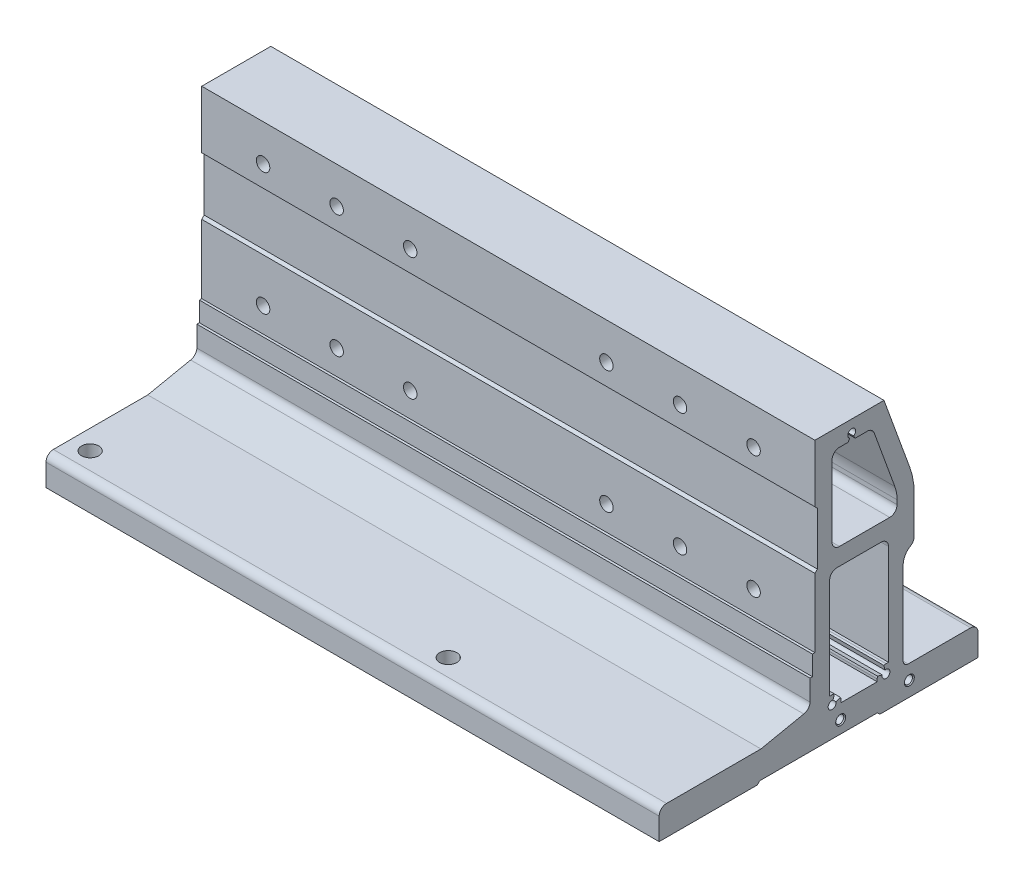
ISO-10303-21;
HEADER;
FILE_DESCRIPTION(('STEP AP214'),'2;1');
FILE_NAME('part.step','',(''),(''),'','','');
FILE_SCHEMA(('AUTOMOTIVE_DESIGN { 1 0 10303 214 1 1 1 1 }'));
ENDSEC;
DATA;
#1=APPLICATION_CONTEXT('core data for automotive mechanical design processes');
#2=APPLICATION_PROTOCOL_DEFINITION('international standard','automotive_design',2000,#1);
#3=PRODUCT_CONTEXT('',#1,'mechanical');
#4=PRODUCT('Part','Part','',(#3));
#5=PRODUCT_RELATED_PRODUCT_CATEGORY('part','',(#4));
#6=PRODUCT_DEFINITION_FORMATION('','',#4);
#7=PRODUCT_DEFINITION_CONTEXT('part definition',#1,'design');
#8=PRODUCT_DEFINITION('design','',#6,#7);
#9=PRODUCT_DEFINITION_SHAPE('','',#8);
#10=(LENGTH_UNIT() NAMED_UNIT(*) SI_UNIT(.MILLI.,.METRE.));
#11=(NAMED_UNIT(*) PLANE_ANGLE_UNIT() SI_UNIT($,.RADIAN.));
#12=(NAMED_UNIT(*) SI_UNIT($,.STERADIAN.) SOLID_ANGLE_UNIT());
#13=UNCERTAINTY_MEASURE_WITH_UNIT(LENGTH_MEASURE(1.E-05),#10,'distance_accuracy_value','');
#14=(GEOMETRIC_REPRESENTATION_CONTEXT(3) GLOBAL_UNCERTAINTY_ASSIGNED_CONTEXT((#13)) GLOBAL_UNIT_ASSIGNED_CONTEXT((#10,
#11,#12)) REPRESENTATION_CONTEXT('',''));
#15=CARTESIAN_POINT('',(0.,0.,0.));
#16=DIRECTION('',(0.,0.,1.));
#17=DIRECTION('',(1.,0.,0.));
#18=AXIS2_PLACEMENT_3D('',#15,#16,#17);
#19=CARTESIAN_POINT('',(125.,17.5660963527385,6.50000000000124));
#20=DIRECTION('',(1.,0.,0.));
#21=DIRECTION('',(0.,0.,-1.));
#22=AXIS2_PLACEMENT_3D('',#19,#20,#21);
#23=PLANE('',#22);
#24=CARTESIAN_POINT('',(125.,5.,-8.99999999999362));
#25=DIRECTION('',(1.,0.,0.));
#26=DIRECTION('',(0.,0.,-1.));
#27=AXIS2_PLACEMENT_3D('',#24,#25,#26);
#28=CIRCLE('',#27,2.025);
#29=CARTESIAN_POINT('',(125.,5.,-11.0249999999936));
#30=VERTEX_POINT('',#29);
#31=EDGE_CURVE('E748',#30,#30,#28,.T.);
#32=ORIENTED_EDGE('',*,*,#31,.F.);
#33=EDGE_LOOP('',(#32));
#34=FACE_BOUND('',#33,.T.);
#35=CARTESIAN_POINT('',(125.,5.,-36.9999999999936));
#36=DIRECTION('',(1.,0.,0.));
#37=DIRECTION('',(0.,0.,-1.));
#38=AXIS2_PLACEMENT_3D('',#35,#36,#37);
#39=CIRCLE('',#38,2.025);
#40=CARTESIAN_POINT('',(125.,5.,-39.0249999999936));
#41=VERTEX_POINT('',#40);
#42=EDGE_CURVE('E739',#41,#41,#39,.T.);
#43=ORIENTED_EDGE('',*,*,#42,.F.);
#44=EDGE_LOOP('',(#43));
#45=FACE_BOUND('',#44,.T.);
#46=DIRECTION('',(0.,0.939692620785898,0.342020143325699));
#47=VECTOR('',#46,1.);
#48=CARTESIAN_POINT('',(125.,80.0819016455,-37.1907786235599));
#49=LINE('',#48,#47);
#50=CARTESIAN_POINT('',(125.,80.0819016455,-37.1907786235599));
#51=VERTEX_POINT('',#50);
#52=CARTESIAN_POINT('',(125.,108.999999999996,-26.6654515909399));
#53=VERTEX_POINT('',#52);
#54=EDGE_CURVE('E1210',#51,#53,#49,.T.);
#55=ORIENTED_EDGE('',*,*,#54,.T.);
#56=DIRECTION('',(0.,0.,1.));
#57=VECTOR('',#56,1.);
#58=CARTESIAN_POINT('',(125.,108.999999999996,-26.6654515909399));
#59=LINE('',#58,#57);
#60=CARTESIAN_POINT('',(125.,108.999999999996,1.50000000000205));
#61=VERTEX_POINT('',#60);
#62=EDGE_CURVE('E1525',#53,#61,#59,.T.);
#63=ORIENTED_EDGE('',*,*,#62,.T.);
#64=DIRECTION('',(0.,-1.,0.));
#65=VECTOR('',#64,1.);
#66=CARTESIAN_POINT('',(125.,108.999999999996,1.50000000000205));
#67=LINE('',#66,#65);
#68=CARTESIAN_POINT('',(125.,85.4999999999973,1.50000000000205));
#69=VERTEX_POINT('',#68);
#70=EDGE_CURVE('E1523',#61,#69,#67,.T.);
#71=ORIENTED_EDGE('',*,*,#70,.T.);
#72=DIRECTION('',(0.,-0.70710678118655,-0.707106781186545));
#73=VECTOR('',#72,1.);
#74=CARTESIAN_POINT('',(125.,85.4999999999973,1.50000000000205));
#75=LINE('',#74,#73);
#76=CARTESIAN_POINT('',(125.,84.4999999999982,0.500000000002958));
#77=VERTEX_POINT('',#76);
#78=EDGE_CURVE('E1147',#69,#77,#75,.T.);
#79=ORIENTED_EDGE('',*,*,#78,.T.);
#80=DIRECTION('',(0.,-1.,0.));
#81=VECTOR('',#80,1.);
#82=CARTESIAN_POINT('',(125.,84.4999999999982,0.500000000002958));
#83=LINE('',#82,#81);
#84=CARTESIAN_POINT('',(125.,62.9999999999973,0.500000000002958));
#85=VERTEX_POINT('',#84);
#86=EDGE_CURVE('E1520',#77,#85,#83,.T.);
#87=ORIENTED_EDGE('',*,*,#86,.T.);
#88=DIRECTION('',(0.,-0.707106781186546,0.707106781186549));
#89=VECTOR('',#88,1.);
#90=CARTESIAN_POINT('',(125.,62.9999999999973,0.500000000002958));
#91=LINE('',#90,#89);
#92=CARTESIAN_POINT('',(125.,61.9999999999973,1.50000000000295));
#93=VERTEX_POINT('',#92);
#94=EDGE_CURVE('E1518',#85,#93,#91,.T.);
#95=ORIENTED_EDGE('',*,*,#94,.T.);
#96=DIRECTION('',(0.,-1.,0.));
#97=VECTOR('',#96,1.);
#98=CARTESIAN_POINT('',(125.,61.9999999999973,1.50000000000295));
#99=LINE('',#98,#97);
#100=CARTESIAN_POINT('',(125.,33.9999999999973,1.50000000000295));
#101=VERTEX_POINT('',#100);
#102=EDGE_CURVE('E1516',#93,#101,#99,.T.);
#103=ORIENTED_EDGE('',*,*,#102,.T.);
#104=DIRECTION('',(0.,0.,1.));
#105=VECTOR('',#104,1.);
#106=CARTESIAN_POINT('',(125.,33.9999999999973,1.50000000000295));
#107=LINE('',#106,#105);
#108=CARTESIAN_POINT('',(125.,33.9999999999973,2.50000000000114));
#109=VERTEX_POINT('',#108);
#110=EDGE_CURVE('E1514',#101,#109,#107,.T.);
#111=ORIENTED_EDGE('',*,*,#110,.T.);
#112=DIRECTION('',(0.,-1.,0.));
#113=VECTOR('',#112,1.);
#114=CARTESIAN_POINT('',(125.,33.9999999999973,2.50000000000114));
#115=LINE('',#114,#113);
#116=CARTESIAN_POINT('',(125.,25.9999999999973,2.50000000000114));
#117=VERTEX_POINT('',#116);
#118=EDGE_CURVE('E1512',#109,#117,#115,.T.);
#119=ORIENTED_EDGE('',*,*,#118,.T.);
#120=DIRECTION('',(0.,0.,1.));
#121=VECTOR('',#120,1.);
#122=CARTESIAN_POINT('',(125.,25.9999999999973,2.50000000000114));
#123=LINE('',#122,#121);
#124=CARTESIAN_POINT('',(125.,25.9999999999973,3.50000000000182));
#125=VERTEX_POINT('',#124);
#126=EDGE_CURVE('E1510',#117,#125,#123,.T.);
#127=ORIENTED_EDGE('',*,*,#126,.T.);
#128=DIRECTION('',(0.,-1.,0.));
#129=VECTOR('',#128,1.);
#130=CARTESIAN_POINT('',(125.,25.9999999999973,3.50000000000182));
#131=LINE('',#130,#129);
#132=CARTESIAN_POINT('',(125.,17.566096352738,3.50000000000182));
#133=VERTEX_POINT('',#132);
#134=EDGE_CURVE('E1508',#125,#133,#131,.T.);
#135=ORIENTED_EDGE('',*,*,#134,.T.);
#136=CARTESIAN_POINT('',(125.,17.5660963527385,6.50000000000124));
#137=DIRECTION('',(-1.,0.,0.));
#138=DIRECTION('',(0.,0.,-1.));
#139=AXIS2_PLACEMENT_3D('',#136,#137,#138);
#140=CIRCLE('',#139,2.99999999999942);
#141=CARTESIAN_POINT('',(125.,14.6023377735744,6.03509669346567));
#142=VERTEX_POINT('',#141);
#143=EDGE_CURVE('E1506',#133,#142,#140,.T.);
#144=ORIENTED_EDGE('',*,*,#143,.T.);
#145=DIRECTION('',(0.,-0.202009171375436,0.979383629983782));
#146=VECTOR('',#145,1.);
#147=CARTESIAN_POINT('',(125.,14.6023377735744,6.03509669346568));
#148=LINE('',#147,#146);
#149=CARTESIAN_POINT('',(125.,11.,23.5000000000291));
#150=VERTEX_POINT('',#149);
#151=EDGE_CURVE('E1504',#142,#150,#148,.T.);
#152=ORIENTED_EDGE('',*,*,#151,.T.);
#153=DIRECTION('',(0.,0.,1.));
#154=VECTOR('',#153,1.);
#155=CARTESIAN_POINT('',(125.,11.,23.5000000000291));
#156=LINE('',#155,#154);
#157=CARTESIAN_POINT('',(125.,11.,62.0000000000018));
#158=VERTEX_POINT('',#157);
#159=EDGE_CURVE('E1502',#150,#158,#156,.T.);
#160=ORIENTED_EDGE('',*,*,#159,.T.);
#161=CARTESIAN_POINT('',(125.,8.,62.0000000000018));
#162=DIRECTION('',(1.,0.,0.));
#163=DIRECTION('',(0.,0.,-1.));
#164=AXIS2_PLACEMENT_3D('',#161,#162,#163);
#165=CIRCLE('',#164,3.);
#166=CARTESIAN_POINT('',(125.,8.,65.0000000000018));
#167=VERTEX_POINT('',#166);
#168=EDGE_CURVE('E1500',#158,#167,#165,.T.);
#169=ORIENTED_EDGE('',*,*,#168,.T.);
#170=DIRECTION('',(0.,-1.,0.));
#171=VECTOR('',#170,1.);
#172=CARTESIAN_POINT('',(125.,8.,65.0000000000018));
#173=LINE('',#172,#171);
#174=CARTESIAN_POINT('',(125.,-1.,65.0000000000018));
#175=VERTEX_POINT('',#174);
#176=EDGE_CURVE('E1498',#167,#175,#173,.T.);
#177=ORIENTED_EDGE('',*,*,#176,.T.);
#178=DIRECTION('',(0.,0.,-1.));
#179=VECTOR('',#178,1.);
#180=CARTESIAN_POINT('',(125.,-1.,65.0000000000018));
#181=LINE('',#180,#179);
#182=CARTESIAN_POINT('',(125.,-1.,25.));
#183=VERTEX_POINT('',#182);
#184=EDGE_CURVE('E1496',#175,#183,#181,.T.);
#185=ORIENTED_EDGE('',*,*,#184,.T.);
#186=DIRECTION('',(0.,0.707106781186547,-0.707106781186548));
#187=VECTOR('',#186,1.);
#188=CARTESIAN_POINT('',(125.,-1.,25.));
#189=LINE('',#188,#187);
#190=CARTESIAN_POINT('',(125.,0.,24.));
#191=VERTEX_POINT('',#190);
#192=EDGE_CURVE('E1494',#183,#191,#189,.T.);
#193=ORIENTED_EDGE('',*,*,#192,.T.);
#194=DIRECTION('',(0.,0.,-1.));
#195=VECTOR('',#194,1.);
#196=CARTESIAN_POINT('',(125.,0.,24.));
#197=LINE('',#196,#195);
#198=CARTESIAN_POINT('',(125.,0.,-24.));
#199=VERTEX_POINT('',#198);
#200=EDGE_CURVE('E1492',#191,#199,#197,.T.);
#201=ORIENTED_EDGE('',*,*,#200,.T.);
#202=DIRECTION('',(0.,-0.707106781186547,-0.707106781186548));
#203=VECTOR('',#202,1.);
#204=CARTESIAN_POINT('',(125.,0.,-24.));
#205=LINE('',#204,#203);
#206=CARTESIAN_POINT('',(125.,-1.,-25.));
#207=VERTEX_POINT('',#206);
#208=EDGE_CURVE('E1490',#199,#207,#205,.T.);
#209=ORIENTED_EDGE('',*,*,#208,.T.);
#210=DIRECTION('',(0.,0.,-1.));
#211=VECTOR('',#210,1.);
#212=CARTESIAN_POINT('',(125.,-1.,-25.));
#213=LINE('',#212,#211);
#214=CARTESIAN_POINT('',(125.,-1.,-64.9999999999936));
#215=VERTEX_POINT('',#214);
#216=EDGE_CURVE('E1488',#207,#215,#213,.T.);
#217=ORIENTED_EDGE('',*,*,#216,.T.);
#218=DIRECTION('',(0.,1.,0.));
#219=VECTOR('',#218,1.);
#220=CARTESIAN_POINT('',(125.,-1.,-64.9999999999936));
#221=LINE('',#220,#219);
#222=CARTESIAN_POINT('',(125.,7.99999999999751,-64.9999999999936));
#223=VERTEX_POINT('',#222);
#224=EDGE_CURVE('E1486',#215,#223,#221,.T.);
#225=ORIENTED_EDGE('',*,*,#224,.T.);
#226=CARTESIAN_POINT('',(125.,7.99999999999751,-61.9999999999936));
#227=DIRECTION('',(1.,0.,0.));
#228=DIRECTION('',(0.,0.,-1.));
#229=AXIS2_PLACEMENT_3D('',#226,#227,#228);
#230=CIRCLE('',#229,3.);
#231=CARTESIAN_POINT('',(125.,10.9999999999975,-61.9999999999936));
#232=VERTEX_POINT('',#231);
#233=EDGE_CURVE('E1484',#223,#232,#230,.T.);
#234=ORIENTED_EDGE('',*,*,#233,.T.);
#235=DIRECTION('',(0.,0.,1.));
#236=VECTOR('',#235,1.);
#237=CARTESIAN_POINT('',(125.,10.9999999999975,-61.9999999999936));
#238=LINE('',#237,#236);
#239=CARTESIAN_POINT('',(125.,10.9999999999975,-36.4999999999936));
#240=VERTEX_POINT('',#239);
#241=EDGE_CURVE('E1482',#232,#240,#238,.T.);
#242=ORIENTED_EDGE('',*,*,#241,.T.);
#243=CARTESIAN_POINT('',(125.,12.9999999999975,-36.4999999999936));
#244=DIRECTION('',(-1.,0.,0.));
#245=DIRECTION('',(0.,0.,-1.));
#246=AXIS2_PLACEMENT_3D('',#243,#244,#245);
#247=CIRCLE('',#246,2.);
#248=CARTESIAN_POINT('',(125.,12.9999999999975,-34.4999999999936));
#249=VERTEX_POINT('',#248);
#250=EDGE_CURVE('E1480',#240,#249,#247,.T.);
#251=ORIENTED_EDGE('',*,*,#250,.T.);
#252=DIRECTION('',(0.,1.,0.));
#253=VECTOR('',#252,1.);
#254=CARTESIAN_POINT('',(125.,12.9999999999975,-34.4999999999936));
#255=LINE('',#254,#253);
#256=CARTESIAN_POINT('',(125.,46.9999999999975,-34.4999999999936));
#257=VERTEX_POINT('',#256);
#258=EDGE_CURVE('E1478',#249,#257,#255,.T.);
#259=ORIENTED_EDGE('',*,*,#258,.T.);
#260=CARTESIAN_POINT('',(125.,46.9999999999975,-40.4999999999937));
#261=DIRECTION('',(-1.,0.,0.));
#262=DIRECTION('',(0.,0.,-1.));
#263=AXIS2_PLACEMENT_3D('',#260,#261,#262);
#264=CIRCLE('',#263,6.00000000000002);
#265=CARTESIAN_POINT('',(125.,52.1961524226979,-37.4999999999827));
#266=VERTEX_POINT('',#265);
#267=EDGE_CURVE('E1476',#257,#266,#264,.T.);
#268=ORIENTED_EDGE('',*,*,#267,.T.);
#269=CARTESIAN_POINT('',(125.,54.7942286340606,-35.9999999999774));
#270=DIRECTION('',(1.,0.,0.));
#271=DIRECTION('',(0.,0.,-1.));
#272=AXIS2_PLACEMENT_3D('',#269,#270,#271);
#273=CIRCLE('',#272,3.00000000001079);
#274=CARTESIAN_POINT('',(125.,54.7942286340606,-38.9999999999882));
#275=VERTEX_POINT('',#274);
#276=EDGE_CURVE('E1474',#266,#275,#273,.T.);
#277=ORIENTED_EDGE('',*,*,#276,.T.);
#278=DIRECTION('',(0.,1.,0.));
#279=VECTOR('',#278,1.);
#280=CARTESIAN_POINT('',(125.,54.7942286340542,-38.9999999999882));
#281=LINE('',#280,#279);
#282=CARTESIAN_POINT('',(125.,69.8212973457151,-38.9999999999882));
#283=VERTEX_POINT('',#282);
#284=EDGE_CURVE('E1472',#275,#283,#281,.T.);
#285=ORIENTED_EDGE('',*,*,#284,.T.);
#286=CARTESIAN_POINT('',(125.,69.8212973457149,-8.99999999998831));
#287=DIRECTION('',(1.,0.,0.));
#288=DIRECTION('',(0.,0.,-1.));
#289=AXIS2_PLACEMENT_3D('',#286,#287,#288);
#290=CIRCLE('',#289,29.9999999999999);
#291=EDGE_CURVE('E1215',#283,#51,#290,.T.);
#292=ORIENTED_EDGE('',*,*,#291,.T.);
#293=EDGE_LOOP('',(#55,#63,#71,#79,#87,#95,#103,#111,#119,#127,#135,#144,#152,#160,#169,#177,
#185,#193,#201,#209,#217,#225,#234,#242,#251,#259,#268,#277,#285,#292));
#294=FACE_BOUND('',#293,.T.);
#295=DIRECTION('',(0.,0.,1.));
#296=VECTOR('',#295,1.);
#297=CARTESIAN_POINT('',(125.,59.5,-25.4999999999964));
#298=LINE('',#297,#296);
#299=CARTESIAN_POINT('',(125.,59.5,-25.4999999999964));
#300=VERTEX_POINT('',#299);
#301=CARTESIAN_POINT('',(125.,59.5,-7.5));
#302=VERTEX_POINT('',#301);
#303=EDGE_CURVE('E1666',#300,#302,#298,.T.);
#304=ORIENTED_EDGE('',*,*,#303,.F.);
#305=CARTESIAN_POINT('',(125.,56.5,-25.4999999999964));
#306=DIRECTION('',(1.,0.,0.));
#307=DIRECTION('',(0.,0.,-1.));
#308=AXIS2_PLACEMENT_3D('',#305,#306,#307);
#309=CIRCLE('',#308,3.);
#310=CARTESIAN_POINT('',(125.,56.5,-28.4999999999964));
#311=VERTEX_POINT('',#310);
#312=EDGE_CURVE('E1571',#311,#300,#309,.T.);
#313=ORIENTED_EDGE('',*,*,#312,.F.);
#314=DIRECTION('',(0.,1.,0.));
#315=VECTOR('',#314,1.);
#316=CARTESIAN_POINT('',(125.,15.6000000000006,-28.4999999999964));
#317=LINE('',#316,#315);
#318=CARTESIAN_POINT('',(125.,15.6000000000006,-28.4999999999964));
#319=VERTEX_POINT('',#318);
#320=EDGE_CURVE('E1567',#319,#311,#317,.T.);
#321=ORIENTED_EDGE('',*,*,#320,.F.);
#322=DIRECTION('',(0.,0.,-1.));
#323=VECTOR('',#322,1.);
#324=CARTESIAN_POINT('',(125.,15.6000000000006,-27.499999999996));
#325=LINE('',#324,#323);
#326=CARTESIAN_POINT('',(125.,15.6000000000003,-27.499999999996));
#327=VERTEX_POINT('',#326);
#328=EDGE_CURVE('E1631',#327,#319,#325,.T.);
#329=ORIENTED_EDGE('',*,*,#328,.F.);
#330=CARTESIAN_POINT('',(125.,11.9999999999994,-27.4999999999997));
#331=DIRECTION('',(-1.,0.,0.));
#332=DIRECTION('',(0.,0.,-1.));
#333=AXIS2_PLACEMENT_3D('',#330,#331,#332);
#334=CIRCLE('',#333,3.60000000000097);
#335=CARTESIAN_POINT('',(125.,15.4773329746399,-26.5682514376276));
#336=VERTEX_POINT('',#335);
#337=EDGE_CURVE('E1634',#336,#327,#334,.T.);
#338=ORIENTED_EDGE('',*,*,#337,.F.);
#339=DIRECTION('',(0.,0.965925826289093,0.258819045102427));
#340=VECTOR('',#339,1.);
#341=CARTESIAN_POINT('',(125.,13.5454813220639,-27.0858895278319));
#342=LINE('',#341,#340);
#343=CARTESIAN_POINT('',(125.,13.5454813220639,-27.0858895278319));
#344=VERTEX_POINT('',#343);
#345=EDGE_CURVE('E1636',#344,#336,#342,.T.);
#346=ORIENTED_EDGE('',*,*,#345,.F.);
#347=CARTESIAN_POINT('',(125.,11.9999999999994,-27.4999999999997));
#348=DIRECTION('',(1.,0.,0.));
#349=DIRECTION('',(0.,0.,-1.));
#350=AXIS2_PLACEMENT_3D('',#347,#348,#349);
#351=CIRCLE('',#350,1.60000000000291);
#352=CARTESIAN_POINT('',(125.,12.4141104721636,-25.9545186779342));
#353=VERTEX_POINT('',#352);
#354=EDGE_CURVE('E1638',#353,#344,#351,.T.);
#355=ORIENTED_EDGE('',*,*,#354,.F.);
#356=DIRECTION('',(0.,-0.25881904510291,-0.965925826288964));
#357=VECTOR('',#356,1.);
#358=CARTESIAN_POINT('',(125.,12.9317485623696,-24.0226670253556));
#359=LINE('',#358,#357);
#360=CARTESIAN_POINT('',(125.,12.9317485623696,-24.0226670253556));
#361=VERTEX_POINT('',#360);
#362=EDGE_CURVE('E1640',#361,#353,#359,.T.);
#363=ORIENTED_EDGE('',*,*,#362,.F.);
#364=CARTESIAN_POINT('',(125.,11.9999999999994,-27.4999999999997));
#365=DIRECTION('',(-1.,0.,0.));
#366=DIRECTION('',(0.,0.,-1.));
#367=AXIS2_PLACEMENT_3D('',#364,#365,#366);
#368=CIRCLE('',#367,3.60000000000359);
#369=CARTESIAN_POINT('',(125.,11.9999999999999,-23.8999999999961));
#370=VERTEX_POINT('',#369);
#371=EDGE_CURVE('E1642',#370,#361,#368,.T.);
#372=ORIENTED_EDGE('',*,*,#371,.F.);
#373=DIRECTION('',(0.,1.,0.));
#374=VECTOR('',#373,1.);
#375=CARTESIAN_POINT('',(125.,11.0000000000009,-23.8999999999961));
#376=LINE('',#375,#374);
#377=CARTESIAN_POINT('',(125.,11.0000000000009,-23.8999999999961));
#378=VERTEX_POINT('',#377);
#379=EDGE_CURVE('E1644',#378,#370,#376,.T.);
#380=ORIENTED_EDGE('',*,*,#379,.F.);
#381=DIRECTION('',(0.,0.,-1.));
#382=VECTOR('',#381,1.);
#383=CARTESIAN_POINT('',(125.,11.0000000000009,-9.10000000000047));
#384=LINE('',#383,#382);
#385=CARTESIAN_POINT('',(125.,11.0000000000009,-9.10000000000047));
#386=VERTEX_POINT('',#385);
#387=EDGE_CURVE('E1646',#386,#378,#384,.T.);
#388=ORIENTED_EDGE('',*,*,#387,.F.);
#389=DIRECTION('',(0.,-1.,0.));
#390=VECTOR('',#389,1.);
#391=CARTESIAN_POINT('',(125.,11.9999999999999,-9.10000000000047));
#392=LINE('',#391,#390);
#393=CARTESIAN_POINT('',(125.,11.9999999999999,-9.10000000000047));
#394=VERTEX_POINT('',#393);
#395=EDGE_CURVE('E1648',#394,#386,#392,.T.);
#396=ORIENTED_EDGE('',*,*,#395,.F.);
#397=CARTESIAN_POINT('',(125.,12.0000000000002,-5.50000000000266));
#398=DIRECTION('',(-1.,0.,0.));
#399=DIRECTION('',(0.,0.,-1.));
#400=AXIS2_PLACEMENT_3D('',#397,#398,#399);
#401=CIRCLE('',#400,3.59999999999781);
#402=CARTESIAN_POINT('',(125.,12.9317485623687,-8.97733297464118));
#403=VERTEX_POINT('',#402);
#404=EDGE_CURVE('E1650',#403,#394,#401,.T.);
#405=ORIENTED_EDGE('',*,*,#404,.F.);
#406=DIRECTION('',(0.,0.258819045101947,-0.965925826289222));
#407=VECTOR('',#406,1.);
#408=CARTESIAN_POINT('',(125.,12.414110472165,-7.04548132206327));
#409=LINE('',#408,#407);
#410=CARTESIAN_POINT('',(125.,12.414110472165,-7.04548132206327));
#411=VERTEX_POINT('',#410);
#412=EDGE_CURVE('E1652',#411,#403,#409,.T.);
#413=ORIENTED_EDGE('',*,*,#412,.F.);
#414=CARTESIAN_POINT('',(125.,12.0000000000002,-5.50000000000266));
#415=DIRECTION('',(1.,0.,0.));
#416=DIRECTION('',(0.,0.,-1.));
#417=AXIS2_PLACEMENT_3D('',#414,#415,#416);
#418=CIRCLE('',#417,1.59999999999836);
#419=CARTESIAN_POINT('',(125.,13.5454813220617,-5.91411047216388));
#420=VERTEX_POINT('',#419);
#421=EDGE_CURVE('E1654',#420,#411,#418,.T.);
#422=ORIENTED_EDGE('',*,*,#421,.F.);
#423=DIRECTION('',(0.,-0.965925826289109,0.258819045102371));
#424=VECTOR('',#423,1.);
#425=CARTESIAN_POINT('',(125.,15.4773329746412,-6.43174856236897));
#426=LINE('',#425,#424);
#427=CARTESIAN_POINT('',(125.,15.4773329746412,-6.43174856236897));
#428=VERTEX_POINT('',#427);
#429=EDGE_CURVE('E1656',#428,#420,#426,.T.);
#430=ORIENTED_EDGE('',*,*,#429,.F.);
#431=CARTESIAN_POINT('',(125.,12.0000000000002,-5.50000000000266));
#432=DIRECTION('',(-1.,0.,0.));
#433=DIRECTION('',(0.,0.,-1.));
#434=AXIS2_PLACEMENT_3D('',#431,#432,#433);
#435=CIRCLE('',#434,3.59999999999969);
#436=CARTESIAN_POINT('',(125.,15.5999999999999,-5.50000000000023));
#437=VERTEX_POINT('',#436);
#438=EDGE_CURVE('E1658',#437,#428,#435,.T.);
#439=ORIENTED_EDGE('',*,*,#438,.F.);
#440=DIRECTION('',(0.,4.00721122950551E-13,-1.));
#441=VECTOR('',#440,1.);
#442=CARTESIAN_POINT('',(125.,15.5999999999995,-4.5));
#443=LINE('',#442,#441);
#444=CARTESIAN_POINT('',(125.,15.5999999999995,-4.5));
#445=VERTEX_POINT('',#444);
#446=EDGE_CURVE('E1660',#445,#437,#443,.T.);
#447=ORIENTED_EDGE('',*,*,#446,.F.);
#448=DIRECTION('',(0.,-1.,0.));
#449=VECTOR('',#448,1.);
#450=CARTESIAN_POINT('',(125.,56.5,-4.5));
#451=LINE('',#450,#449);
#452=CARTESIAN_POINT('',(125.,56.5,-4.5));
#453=VERTEX_POINT('',#452);
#454=EDGE_CURVE('E1662',#453,#445,#451,.T.);
#455=ORIENTED_EDGE('',*,*,#454,.F.);
#456=CARTESIAN_POINT('',(125.,56.5,-7.5));
#457=DIRECTION('',(1.,0.,0.));
#458=DIRECTION('',(0.,0.,-1.));
#459=AXIS2_PLACEMENT_3D('',#456,#457,#458);
#460=CIRCLE('',#459,3.);
#461=EDGE_CURVE('E1664',#302,#453,#460,.T.);
#462=ORIENTED_EDGE('',*,*,#461,.F.);
#463=EDGE_LOOP('',(#304,#313,#321,#329,#338,#346,#355,#363,#372,#380,#388,#396,#405,#413,#422,
#430,#439,#447,#455,#462));
#464=FACE_BOUND('',#463,.T.);
#465=DIRECTION('',(0.,-0.866025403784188,0.500000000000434));
#466=VECTOR('',#465,1.);
#467=CARTESIAN_POINT('',(125.,102.614356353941,-12.7000000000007));
#468=LINE('',#467,#466);
#469=CARTESIAN_POINT('',(125.,102.614356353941,-12.7000000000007));
#470=VERTEX_POINT('',#469);
#471=CARTESIAN_POINT('',(125.,101.499999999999,-12.0566260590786));
#472=VERTEX_POINT('',#471);
#473=EDGE_CURVE('E650',#470,#472,#468,.T.);
#474=ORIENTED_EDGE('',*,*,#473,.F.);
#475=CARTESIAN_POINT('',(125.,103.999996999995,-13.5000000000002));
#476=DIRECTION('',(1.,0.,0.));
#477=DIRECTION('',(0.,0.,-1.));
#478=AXIS2_PLACEMENT_3D('',#475,#476,#477);
#479=CIRCLE('',#478,1.59999999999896);
#480=CARTESIAN_POINT('',(125.,102.614356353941,-14.2999999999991));
#481=VERTEX_POINT('',#480);
#482=EDGE_CURVE('E585',#481,#470,#479,.T.);
#483=ORIENTED_EDGE('',*,*,#482,.F.);
#484=DIRECTION('',(0.,0.866025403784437,0.500000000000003));
#485=VECTOR('',#484,1.);
#486=CARTESIAN_POINT('',(125.,101.499999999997,-14.9433739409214));
#487=LINE('',#486,#485);
#488=CARTESIAN_POINT('',(125.,101.499999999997,-14.9433739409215));
#489=VERTEX_POINT('',#488);
#490=EDGE_CURVE('E581',#489,#481,#487,.T.);
#491=ORIENTED_EDGE('',*,*,#490,.F.);
#492=DIRECTION('',(0.,0.,1.));
#493=VECTOR('',#492,1.);
#494=CARTESIAN_POINT('',(125.,101.499999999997,-19.8453613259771));
#495=LINE('',#494,#493);
#496=CARTESIAN_POINT('',(125.,101.499999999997,-19.8453613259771));
#497=VERTEX_POINT('',#496);
#498=EDGE_CURVE('E627',#497,#489,#495,.T.);
#499=ORIENTED_EDGE('',*,*,#498,.F.);
#500=CARTESIAN_POINT('',(125.,98.4999999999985,-19.8453613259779));
#501=DIRECTION('',(1.,0.,0.));
#502=DIRECTION('',(0.,0.,-1.));
#503=AXIS2_PLACEMENT_3D('',#500,#501,#502);
#504=CIRCLE('',#503,2.99999999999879);
#505=CARTESIAN_POINT('',(125.,99.5260604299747,-22.6644391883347));
#506=VERTEX_POINT('',#505);
#507=EDGE_CURVE('E630',#506,#497,#504,.T.);
#508=ORIENTED_EDGE('',*,*,#507,.F.);
#509=DIRECTION('',(0.,0.939692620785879,0.342020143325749));
#510=VECTOR('',#509,1.);
#511=CARTESIAN_POINT('',(125.,76.3622153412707,-31.0953893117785));
#512=LINE('',#511,#510);
#513=CARTESIAN_POINT('',(125.,76.3622153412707,-31.0953893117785));
#514=VERTEX_POINT('',#513);
#515=EDGE_CURVE('E632',#514,#506,#512,.T.);
#516=ORIENTED_EDGE('',*,*,#515,.F.);
#517=CARTESIAN_POINT('',(125.,71.2319131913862,-17.0000000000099));
#518=DIRECTION('',(1.,0.,0.));
#519=DIRECTION('',(0.,0.,-1.));
#520=AXIS2_PLACEMENT_3D('',#517,#518,#519);
#521=CIRCLE('',#520,14.999999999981);
#522=CARTESIAN_POINT('',(125.,71.2319131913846,-31.9999999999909));
#523=VERTEX_POINT('',#522);
#524=EDGE_CURVE('E634',#523,#514,#521,.T.);
#525=ORIENTED_EDGE('',*,*,#524,.F.);
#526=DIRECTION('',(0.,1.,0.));
#527=VECTOR('',#526,1.);
#528=CARTESIAN_POINT('',(125.,69.5,-31.9999999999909));
#529=LINE('',#528,#527);
#530=CARTESIAN_POINT('',(125.,69.5,-31.9999999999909));
#531=VERTEX_POINT('',#530);
#532=EDGE_CURVE('E636',#531,#523,#529,.T.);
#533=ORIENTED_EDGE('',*,*,#532,.F.);
#534=CARTESIAN_POINT('',(125.,69.5,-28.9999999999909));
#535=DIRECTION('',(1.,0.,0.));
#536=DIRECTION('',(0.,0.,-1.));
#537=AXIS2_PLACEMENT_3D('',#534,#535,#536);
#538=CIRCLE('',#537,3.);
#539=CARTESIAN_POINT('',(125.,66.5,-28.9999999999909));
#540=VERTEX_POINT('',#539);
#541=EDGE_CURVE('E638',#540,#531,#538,.T.);
#542=ORIENTED_EDGE('',*,*,#541,.F.);
#543=DIRECTION('',(0.,0.,-1.));
#544=VECTOR('',#543,1.);
#545=CARTESIAN_POINT('',(125.,66.5,-8.5));
#546=LINE('',#545,#544);
#547=CARTESIAN_POINT('',(125.,66.5,-8.5));
#548=VERTEX_POINT('',#547);
#549=EDGE_CURVE('E640',#548,#540,#546,.T.);
#550=ORIENTED_EDGE('',*,*,#549,.F.);
#551=CARTESIAN_POINT('',(125.,69.5,-8.5));
#552=DIRECTION('',(1.,0.,0.));
#553=DIRECTION('',(0.,0.,-1.));
#554=AXIS2_PLACEMENT_3D('',#551,#552,#553);
#555=CIRCLE('',#554,3.);
#556=CARTESIAN_POINT('',(125.,69.5,-5.5));
#557=VERTEX_POINT('',#556);
#558=EDGE_CURVE('E642',#557,#548,#555,.T.);
#559=ORIENTED_EDGE('',*,*,#558,.F.);
#560=DIRECTION('',(0.,-1.,0.));
#561=VECTOR('',#560,1.);
#562=CARTESIAN_POINT('',(125.,98.5,-5.5));
#563=LINE('',#562,#561);
#564=CARTESIAN_POINT('',(125.,98.5,-5.5));
#565=VERTEX_POINT('',#564);
#566=EDGE_CURVE('E644',#565,#557,#563,.T.);
#567=ORIENTED_EDGE('',*,*,#566,.F.);
#568=CARTESIAN_POINT('',(125.,98.5,-8.5));
#569=DIRECTION('',(1.,0.,0.));
#570=DIRECTION('',(0.,0.,-1.));
#571=AXIS2_PLACEMENT_3D('',#568,#569,#570);
#572=CIRCLE('',#571,3.);
#573=CARTESIAN_POINT('',(125.,101.5,-8.5));
#574=VERTEX_POINT('',#573);
#575=EDGE_CURVE('E646',#574,#565,#572,.T.);
#576=ORIENTED_EDGE('',*,*,#575,.F.);
#577=DIRECTION('',(0.,2.57528899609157E-13,1.));
#578=VECTOR('',#577,1.);
#579=CARTESIAN_POINT('',(125.,101.499999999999,-12.0566260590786));
#580=LINE('',#579,#578);
#581=EDGE_CURVE('E648',#472,#574,#580,.T.);
#582=ORIENTED_EDGE('',*,*,#581,.F.);
#583=EDGE_LOOP('',(#474,#483,#491,#499,#508,#516,#525,#533,#542,#550,#559,#567,#576,#582));
#584=FACE_BOUND('',#583,.T.);
#585=ADVANCED_FACE('F37',(#34,#45,#294,#464,#584),#23,.T.);
#586=CARTESIAN_POINT('',(-125.,17.5660963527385,6.50000000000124));
#587=DIRECTION('',(1.,0.,0.));
#588=DIRECTION('',(0.,0.,-1.));
#589=AXIS2_PLACEMENT_3D('',#586,#587,#588);
#590=PLANE('',#589);
#591=CARTESIAN_POINT('',(-125.,56.5,-25.4999999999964));
#592=DIRECTION('',(1.,0.,0.));
#593=DIRECTION('',(0.,0.,-1.));
#594=AXIS2_PLACEMENT_3D('',#591,#592,#593);
#595=CIRCLE('',#594,3.);
#596=CARTESIAN_POINT('',(-125.,56.5,-28.4999999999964));
#597=VERTEX_POINT('',#596);
#598=CARTESIAN_POINT('',(-125.,59.5,-25.4999999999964));
#599=VERTEX_POINT('',#598);
#600=EDGE_CURVE('E1626',#597,#599,#595,.T.);
#601=ORIENTED_EDGE('',*,*,#600,.T.);
#602=DIRECTION('',(0.,0.,1.));
#603=VECTOR('',#602,1.);
#604=CARTESIAN_POINT('',(-125.,59.5,-25.4999999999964));
#605=LINE('',#604,#603);
#606=CARTESIAN_POINT('',(-125.,59.5,-7.5));
#607=VERTEX_POINT('',#606);
#608=EDGE_CURVE('E1623',#599,#607,#605,.T.);
#609=ORIENTED_EDGE('',*,*,#608,.T.);
#610=CARTESIAN_POINT('',(-125.,56.5,-7.5));
#611=DIRECTION('',(1.,0.,0.));
#612=DIRECTION('',(0.,0.,-1.));
#613=AXIS2_PLACEMENT_3D('',#610,#611,#612);
#614=CIRCLE('',#613,3.);
#615=CARTESIAN_POINT('',(-125.,56.5,-4.5));
#616=VERTEX_POINT('',#615);
#617=EDGE_CURVE('E1620',#607,#616,#614,.T.);
#618=ORIENTED_EDGE('',*,*,#617,.T.);
#619=DIRECTION('',(0.,-1.,0.));
#620=VECTOR('',#619,1.);
#621=CARTESIAN_POINT('',(-125.,56.5,-4.5));
#622=LINE('',#621,#620);
#623=CARTESIAN_POINT('',(-125.,15.5999999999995,-4.5));
#624=VERTEX_POINT('',#623);
#625=EDGE_CURVE('E1617',#616,#624,#622,.T.);
#626=ORIENTED_EDGE('',*,*,#625,.T.);
#627=DIRECTION('',(0.,4.00721122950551E-13,-1.));
#628=VECTOR('',#627,1.);
#629=CARTESIAN_POINT('',(-125.,15.5999999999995,-4.5));
#630=LINE('',#629,#628);
#631=CARTESIAN_POINT('',(-125.,15.5999999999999,-5.50000000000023));
#632=VERTEX_POINT('',#631);
#633=EDGE_CURVE('E1614',#624,#632,#630,.T.);
#634=ORIENTED_EDGE('',*,*,#633,.T.);
#635=CARTESIAN_POINT('',(-125.,12.0000000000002,-5.50000000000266));
#636=DIRECTION('',(-1.,0.,0.));
#637=DIRECTION('',(0.,0.,-1.));
#638=AXIS2_PLACEMENT_3D('',#635,#636,#637);
#639=CIRCLE('',#638,3.59999999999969);
#640=CARTESIAN_POINT('',(-125.,15.4773329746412,-6.43174856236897));
#641=VERTEX_POINT('',#640);
#642=EDGE_CURVE('E1611',#632,#641,#639,.T.);
#643=ORIENTED_EDGE('',*,*,#642,.T.);
#644=DIRECTION('',(0.,-0.965925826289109,0.258819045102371));
#645=VECTOR('',#644,1.);
#646=CARTESIAN_POINT('',(-125.,15.4773329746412,-6.43174856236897));
#647=LINE('',#646,#645);
#648=CARTESIAN_POINT('',(-125.,13.5454813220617,-5.91411047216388));
#649=VERTEX_POINT('',#648);
#650=EDGE_CURVE('E1608',#641,#649,#647,.T.);
#651=ORIENTED_EDGE('',*,*,#650,.T.);
#652=CARTESIAN_POINT('',(-125.,12.0000000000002,-5.50000000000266));
#653=DIRECTION('',(1.,0.,0.));
#654=DIRECTION('',(0.,0.,-1.));
#655=AXIS2_PLACEMENT_3D('',#652,#653,#654);
#656=CIRCLE('',#655,1.59999999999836);
#657=CARTESIAN_POINT('',(-125.,12.414110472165,-7.04548132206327));
#658=VERTEX_POINT('',#657);
#659=EDGE_CURVE('E1605',#649,#658,#656,.T.);
#660=ORIENTED_EDGE('',*,*,#659,.T.);
#661=DIRECTION('',(0.,0.258819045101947,-0.965925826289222));
#662=VECTOR('',#661,1.);
#663=CARTESIAN_POINT('',(-125.,12.414110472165,-7.04548132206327));
#664=LINE('',#663,#662);
#665=CARTESIAN_POINT('',(-125.,12.9317485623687,-8.97733297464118));
#666=VERTEX_POINT('',#665);
#667=EDGE_CURVE('E1602',#658,#666,#664,.T.);
#668=ORIENTED_EDGE('',*,*,#667,.T.);
#669=CARTESIAN_POINT('',(-125.,12.0000000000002,-5.50000000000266));
#670=DIRECTION('',(-1.,0.,0.));
#671=DIRECTION('',(0.,0.,-1.));
#672=AXIS2_PLACEMENT_3D('',#669,#670,#671);
#673=CIRCLE('',#672,3.59999999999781);
#674=CARTESIAN_POINT('',(-125.,11.9999999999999,-9.10000000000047));
#675=VERTEX_POINT('',#674);
#676=EDGE_CURVE('E1599',#666,#675,#673,.T.);
#677=ORIENTED_EDGE('',*,*,#676,.T.);
#678=DIRECTION('',(0.,-1.,0.));
#679=VECTOR('',#678,1.);
#680=CARTESIAN_POINT('',(-125.,11.9999999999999,-9.10000000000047));
#681=LINE('',#680,#679);
#682=CARTESIAN_POINT('',(-125.,11.0000000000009,-9.10000000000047));
#683=VERTEX_POINT('',#682);
#684=EDGE_CURVE('E1596',#675,#683,#681,.T.);
#685=ORIENTED_EDGE('',*,*,#684,.T.);
#686=DIRECTION('',(0.,0.,-1.));
#687=VECTOR('',#686,1.);
#688=CARTESIAN_POINT('',(-125.,11.0000000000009,-9.10000000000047));
#689=LINE('',#688,#687);
#690=CARTESIAN_POINT('',(-125.,11.0000000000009,-23.8999999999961));
#691=VERTEX_POINT('',#690);
#692=EDGE_CURVE('E1593',#683,#691,#689,.T.);
#693=ORIENTED_EDGE('',*,*,#692,.T.);
#694=DIRECTION('',(0.,1.,0.));
#695=VECTOR('',#694,1.);
#696=CARTESIAN_POINT('',(-125.,11.0000000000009,-23.8999999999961));
#697=LINE('',#696,#695);
#698=CARTESIAN_POINT('',(-125.,11.9999999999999,-23.8999999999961));
#699=VERTEX_POINT('',#698);
#700=EDGE_CURVE('E1590',#691,#699,#697,.T.);
#701=ORIENTED_EDGE('',*,*,#700,.T.);
#702=CARTESIAN_POINT('',(-125.,11.9999999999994,-27.4999999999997));
#703=DIRECTION('',(-1.,0.,0.));
#704=DIRECTION('',(0.,0.,-1.));
#705=AXIS2_PLACEMENT_3D('',#702,#703,#704);
#706=CIRCLE('',#705,3.60000000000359);
#707=CARTESIAN_POINT('',(-125.,12.9317485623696,-24.0226670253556));
#708=VERTEX_POINT('',#707);
#709=EDGE_CURVE('E1587',#699,#708,#706,.T.);
#710=ORIENTED_EDGE('',*,*,#709,.T.);
#711=DIRECTION('',(0.,-0.25881904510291,-0.965925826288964));
#712=VECTOR('',#711,1.);
#713=CARTESIAN_POINT('',(-125.,12.9317485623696,-24.0226670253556));
#714=LINE('',#713,#712);
#715=CARTESIAN_POINT('',(-125.,12.4141104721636,-25.9545186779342));
#716=VERTEX_POINT('',#715);
#717=EDGE_CURVE('E1584',#708,#716,#714,.T.);
#718=ORIENTED_EDGE('',*,*,#717,.T.);
#719=CARTESIAN_POINT('',(-125.,11.9999999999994,-27.4999999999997));
#720=DIRECTION('',(1.,0.,0.));
#721=DIRECTION('',(0.,0.,-1.));
#722=AXIS2_PLACEMENT_3D('',#719,#720,#721);
#723=CIRCLE('',#722,1.60000000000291);
#724=CARTESIAN_POINT('',(-125.,13.5454813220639,-27.0858895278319));
#725=VERTEX_POINT('',#724);
#726=EDGE_CURVE('E1581',#716,#725,#723,.T.);
#727=ORIENTED_EDGE('',*,*,#726,.T.);
#728=DIRECTION('',(0.,0.965925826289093,0.258819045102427));
#729=VECTOR('',#728,1.);
#730=CARTESIAN_POINT('',(-125.,13.5454813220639,-27.0858895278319));
#731=LINE('',#730,#729);
#732=CARTESIAN_POINT('',(-125.,15.4773329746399,-26.5682514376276));
#733=VERTEX_POINT('',#732);
#734=EDGE_CURVE('E1578',#725,#733,#731,.T.);
#735=ORIENTED_EDGE('',*,*,#734,.T.);
#736=CARTESIAN_POINT('',(-125.,11.9999999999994,-27.4999999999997));
#737=DIRECTION('',(-1.,0.,0.));
#738=DIRECTION('',(0.,0.,-1.));
#739=AXIS2_PLACEMENT_3D('',#736,#737,#738);
#740=CIRCLE('',#739,3.60000000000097);
#741=CARTESIAN_POINT('',(-125.,15.6000000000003,-27.499999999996));
#742=VERTEX_POINT('',#741);
#743=EDGE_CURVE('E1575',#733,#742,#740,.T.);
#744=ORIENTED_EDGE('',*,*,#743,.T.);
#745=DIRECTION('',(0.,0.,-1.));
#746=VECTOR('',#745,1.);
#747=CARTESIAN_POINT('',(-125.,15.6000000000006,-27.499999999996));
#748=LINE('',#747,#746);
#749=CARTESIAN_POINT('',(-125.,15.6000000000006,-28.4999999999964));
#750=VERTEX_POINT('',#749);
#751=EDGE_CURVE('E1572',#742,#750,#748,.T.);
#752=ORIENTED_EDGE('',*,*,#751,.T.);
#753=DIRECTION('',(0.,1.,0.));
#754=VECTOR('',#753,1.);
#755=CARTESIAN_POINT('',(-125.,15.6000000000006,-28.4999999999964));
#756=LINE('',#755,#754);
#757=EDGE_CURVE('E1568',#750,#597,#756,.T.);
#758=ORIENTED_EDGE('',*,*,#757,.T.);
#759=EDGE_LOOP('',(#601,#609,#618,#626,#634,#643,#651,#660,#668,#677,#685,#693,#701,#710,#718,
#727,#735,#744,#752,#758));
#760=FACE_BOUND('',#759,.T.);
#761=DIRECTION('',(0.,0.939692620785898,0.342020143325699));
#762=VECTOR('',#761,1.);
#763=CARTESIAN_POINT('',(-125.,80.0819016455,-37.1907786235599));
#764=LINE('',#763,#762);
#765=CARTESIAN_POINT('',(-125.,80.0819016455,-37.1907786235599));
#766=VERTEX_POINT('',#765);
#767=CARTESIAN_POINT('',(-125.,108.999999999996,-26.6654515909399));
#768=VERTEX_POINT('',#767);
#769=EDGE_CURVE('E1461',#766,#768,#764,.T.);
#770=ORIENTED_EDGE('',*,*,#769,.F.);
#771=CARTESIAN_POINT('',(-125.,69.8212973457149,-8.99999999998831));
#772=DIRECTION('',(1.,0.,0.));
#773=DIRECTION('',(0.,0.,-1.));
#774=AXIS2_PLACEMENT_3D('',#771,#772,#773);
#775=CIRCLE('',#774,29.9999999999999);
#776=CARTESIAN_POINT('',(-125.,69.8212973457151,-38.9999999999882));
#777=VERTEX_POINT('',#776);
#778=EDGE_CURVE('E1208',#777,#766,#775,.T.);
#779=ORIENTED_EDGE('',*,*,#778,.F.);
#780=DIRECTION('',(0.,1.,0.));
#781=VECTOR('',#780,1.);
#782=CARTESIAN_POINT('',(-125.,54.7942286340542,-38.9999999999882));
#783=LINE('',#782,#781);
#784=CARTESIAN_POINT('',(-125.,54.7942286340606,-38.9999999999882));
#785=VERTEX_POINT('',#784);
#786=EDGE_CURVE('E1206',#785,#777,#783,.T.);
#787=ORIENTED_EDGE('',*,*,#786,.F.);
#788=CARTESIAN_POINT('',(-125.,54.7942286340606,-35.9999999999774));
#789=DIRECTION('',(1.,0.,0.));
#790=DIRECTION('',(0.,0.,-1.));
#791=AXIS2_PLACEMENT_3D('',#788,#789,#790);
#792=CIRCLE('',#791,3.00000000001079);
#793=CARTESIAN_POINT('',(-125.,52.1961524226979,-37.4999999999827));
#794=VERTEX_POINT('',#793);
#795=EDGE_CURVE('E1204',#794,#785,#792,.T.);
#796=ORIENTED_EDGE('',*,*,#795,.F.);
#797=CARTESIAN_POINT('',(-125.,46.9999999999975,-40.4999999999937));
#798=DIRECTION('',(-1.,0.,0.));
#799=DIRECTION('',(0.,0.,-1.));
#800=AXIS2_PLACEMENT_3D('',#797,#798,#799);
#801=CIRCLE('',#800,6.00000000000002);
#802=CARTESIAN_POINT('',(-125.,46.9999999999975,-34.4999999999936));
#803=VERTEX_POINT('',#802);
#804=EDGE_CURVE('E1202',#803,#794,#801,.T.);
#805=ORIENTED_EDGE('',*,*,#804,.F.);
#806=DIRECTION('',(0.,1.,0.));
#807=VECTOR('',#806,1.);
#808=CARTESIAN_POINT('',(-125.,12.9999999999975,-34.4999999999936));
#809=LINE('',#808,#807);
#810=CARTESIAN_POINT('',(-125.,12.9999999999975,-34.4999999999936));
#811=VERTEX_POINT('',#810);
#812=EDGE_CURVE('E1199',#811,#803,#809,.T.);
#813=ORIENTED_EDGE('',*,*,#812,.F.);
#814=CARTESIAN_POINT('',(-125.,12.9999999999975,-36.4999999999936));
#815=DIRECTION('',(-1.,0.,0.));
#816=DIRECTION('',(0.,0.,-1.));
#817=AXIS2_PLACEMENT_3D('',#814,#815,#816);
#818=CIRCLE('',#817,2.);
#819=CARTESIAN_POINT('',(-125.,10.9999999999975,-36.4999999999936));
#820=VERTEX_POINT('',#819);
#821=EDGE_CURVE('E1197',#820,#811,#818,.T.);
#822=ORIENTED_EDGE('',*,*,#821,.F.);
#823=DIRECTION('',(0.,0.,1.));
#824=VECTOR('',#823,1.);
#825=CARTESIAN_POINT('',(-125.,10.9999999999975,-61.9999999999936));
#826=LINE('',#825,#824);
#827=CARTESIAN_POINT('',(-125.,10.9999999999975,-61.9999999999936));
#828=VERTEX_POINT('',#827);
#829=EDGE_CURVE('E1195',#828,#820,#826,.T.);
#830=ORIENTED_EDGE('',*,*,#829,.F.);
#831=CARTESIAN_POINT('',(-125.,7.99999999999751,-61.9999999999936));
#832=DIRECTION('',(1.,0.,0.));
#833=DIRECTION('',(0.,0.,-1.));
#834=AXIS2_PLACEMENT_3D('',#831,#832,#833);
#835=CIRCLE('',#834,3.);
#836=CARTESIAN_POINT('',(-125.,7.99999999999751,-64.9999999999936));
#837=VERTEX_POINT('',#836);
#838=EDGE_CURVE('E1193',#837,#828,#835,.T.);
#839=ORIENTED_EDGE('',*,*,#838,.F.);
#840=DIRECTION('',(0.,1.,0.));
#841=VECTOR('',#840,1.);
#842=CARTESIAN_POINT('',(-125.,-1.,-64.9999999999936));
#843=LINE('',#842,#841);
#844=CARTESIAN_POINT('',(-125.,-1.,-64.9999999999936));
#845=VERTEX_POINT('',#844);
#846=EDGE_CURVE('E1191',#845,#837,#843,.T.);
#847=ORIENTED_EDGE('',*,*,#846,.F.);
#848=DIRECTION('',(0.,0.,-1.));
#849=VECTOR('',#848,1.);
#850=CARTESIAN_POINT('',(-125.,-1.,-25.));
#851=LINE('',#850,#849);
#852=CARTESIAN_POINT('',(-125.,-1.,-25.));
#853=VERTEX_POINT('',#852);
#854=EDGE_CURVE('E1189',#853,#845,#851,.T.);
#855=ORIENTED_EDGE('',*,*,#854,.F.);
#856=DIRECTION('',(0.,-0.707106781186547,-0.707106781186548));
#857=VECTOR('',#856,1.);
#858=CARTESIAN_POINT('',(-125.,0.,-24.));
#859=LINE('',#858,#857);
#860=CARTESIAN_POINT('',(-125.,0.,-24.));
#861=VERTEX_POINT('',#860);
#862=EDGE_CURVE('E1187',#861,#853,#859,.T.);
#863=ORIENTED_EDGE('',*,*,#862,.F.);
#864=DIRECTION('',(0.,0.,-1.));
#865=VECTOR('',#864,1.);
#866=CARTESIAN_POINT('',(-125.,0.,24.));
#867=LINE('',#866,#865);
#868=CARTESIAN_POINT('',(-125.,0.,24.));
#869=VERTEX_POINT('',#868);
#870=EDGE_CURVE('E1185',#869,#861,#867,.T.);
#871=ORIENTED_EDGE('',*,*,#870,.F.);
#872=DIRECTION('',(0.,0.707106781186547,-0.707106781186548));
#873=VECTOR('',#872,1.);
#874=CARTESIAN_POINT('',(-125.,-1.,25.));
#875=LINE('',#874,#873);
#876=CARTESIAN_POINT('',(-125.,-1.,25.));
#877=VERTEX_POINT('',#876);
#878=EDGE_CURVE('E1183',#877,#869,#875,.T.);
#879=ORIENTED_EDGE('',*,*,#878,.F.);
#880=DIRECTION('',(0.,0.,-1.));
#881=VECTOR('',#880,1.);
#882=CARTESIAN_POINT('',(-125.,-1.,65.0000000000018));
#883=LINE('',#882,#881);
#884=CARTESIAN_POINT('',(-125.,-1.,65.0000000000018));
#885=VERTEX_POINT('',#884);
#886=EDGE_CURVE('E1181',#885,#877,#883,.T.);
#887=ORIENTED_EDGE('',*,*,#886,.F.);
#888=DIRECTION('',(0.,-1.,0.));
#889=VECTOR('',#888,1.);
#890=CARTESIAN_POINT('',(-125.,8.,65.0000000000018));
#891=LINE('',#890,#889);
#892=CARTESIAN_POINT('',(-125.,8.,65.0000000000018));
#893=VERTEX_POINT('',#892);
#894=EDGE_CURVE('E1179',#893,#885,#891,.T.);
#895=ORIENTED_EDGE('',*,*,#894,.F.);
#896=CARTESIAN_POINT('',(-125.,8.,62.0000000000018));
#897=DIRECTION('',(1.,0.,0.));
#898=DIRECTION('',(0.,0.,-1.));
#899=AXIS2_PLACEMENT_3D('',#896,#897,#898);
#900=CIRCLE('',#899,3.);
#901=CARTESIAN_POINT('',(-125.,11.,62.0000000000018));
#902=VERTEX_POINT('',#901);
#903=EDGE_CURVE('E1177',#902,#893,#900,.T.);
#904=ORIENTED_EDGE('',*,*,#903,.F.);
#905=DIRECTION('',(0.,0.,1.));
#906=VECTOR('',#905,1.);
#907=CARTESIAN_POINT('',(-125.,11.,23.5000000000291));
#908=LINE('',#907,#906);
#909=CARTESIAN_POINT('',(-125.,11.,23.5000000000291));
#910=VERTEX_POINT('',#909);
#911=EDGE_CURVE('E1175',#910,#902,#908,.T.);
#912=ORIENTED_EDGE('',*,*,#911,.F.);
#913=DIRECTION('',(0.,-0.202009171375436,0.979383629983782));
#914=VECTOR('',#913,1.);
#915=CARTESIAN_POINT('',(-125.,14.6023377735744,6.03509669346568));
#916=LINE('',#915,#914);
#917=CARTESIAN_POINT('',(-125.,14.6023377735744,6.03509669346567));
#918=VERTEX_POINT('',#917);
#919=EDGE_CURVE('E1173',#918,#910,#916,.T.);
#920=ORIENTED_EDGE('',*,*,#919,.F.);
#921=CARTESIAN_POINT('',(-125.,17.5660963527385,6.50000000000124));
#922=DIRECTION('',(-1.,0.,0.));
#923=DIRECTION('',(0.,0.,-1.));
#924=AXIS2_PLACEMENT_3D('',#921,#922,#923);
#925=CIRCLE('',#924,2.99999999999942);
#926=CARTESIAN_POINT('',(-125.,17.566096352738,3.50000000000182));
#927=VERTEX_POINT('',#926);
#928=EDGE_CURVE('E1171',#927,#918,#925,.T.);
#929=ORIENTED_EDGE('',*,*,#928,.F.);
#930=DIRECTION('',(0.,-1.,0.));
#931=VECTOR('',#930,1.);
#932=CARTESIAN_POINT('',(-125.,25.9999999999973,3.50000000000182));
#933=LINE('',#932,#931);
#934=CARTESIAN_POINT('',(-125.,25.9999999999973,3.50000000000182));
#935=VERTEX_POINT('',#934);
#936=EDGE_CURVE('E1169',#935,#927,#933,.T.);
#937=ORIENTED_EDGE('',*,*,#936,.F.);
#938=DIRECTION('',(0.,0.,1.));
#939=VECTOR('',#938,1.);
#940=CARTESIAN_POINT('',(-125.,25.9999999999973,2.50000000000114));
#941=LINE('',#940,#939);
#942=CARTESIAN_POINT('',(-125.,25.9999999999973,2.50000000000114));
#943=VERTEX_POINT('',#942);
#944=EDGE_CURVE('E1167',#943,#935,#941,.T.);
#945=ORIENTED_EDGE('',*,*,#944,.F.);
#946=DIRECTION('',(0.,-1.,0.));
#947=VECTOR('',#946,1.);
#948=CARTESIAN_POINT('',(-125.,33.9999999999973,2.50000000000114));
#949=LINE('',#948,#947);
#950=CARTESIAN_POINT('',(-125.,33.9999999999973,2.50000000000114));
#951=VERTEX_POINT('',#950);
#952=EDGE_CURVE('E1165',#951,#943,#949,.T.);
#953=ORIENTED_EDGE('',*,*,#952,.F.);
#954=DIRECTION('',(0.,0.,1.));
#955=VECTOR('',#954,1.);
#956=CARTESIAN_POINT('',(-125.,33.9999999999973,1.50000000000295));
#957=LINE('',#956,#955);
#958=CARTESIAN_POINT('',(-125.,33.9999999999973,1.50000000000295));
#959=VERTEX_POINT('',#958);
#960=EDGE_CURVE('E1163',#959,#951,#957,.T.);
#961=ORIENTED_EDGE('',*,*,#960,.F.);
#962=DIRECTION('',(0.,-1.,0.));
#963=VECTOR('',#962,1.);
#964=CARTESIAN_POINT('',(-125.,61.9999999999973,1.50000000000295));
#965=LINE('',#964,#963);
#966=CARTESIAN_POINT('',(-125.,61.9999999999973,1.50000000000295));
#967=VERTEX_POINT('',#966);
#968=EDGE_CURVE('E1161',#967,#959,#965,.T.);
#969=ORIENTED_EDGE('',*,*,#968,.F.);
#970=DIRECTION('',(0.,-0.707106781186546,0.707106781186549));
#971=VECTOR('',#970,1.);
#972=CARTESIAN_POINT('',(-125.,62.9999999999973,0.500000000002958));
#973=LINE('',#972,#971);
#974=CARTESIAN_POINT('',(-125.,62.9999999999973,0.500000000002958));
#975=VERTEX_POINT('',#974);
#976=EDGE_CURVE('E1156',#975,#967,#973,.T.);
#977=ORIENTED_EDGE('',*,*,#976,.F.);
#978=DIRECTION('',(0.,-1.,0.));
#979=VECTOR('',#978,1.);
#980=CARTESIAN_POINT('',(-125.,84.4999999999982,0.500000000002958));
#981=LINE('',#980,#979);
#982=CARTESIAN_POINT('',(-125.,84.4999999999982,0.500000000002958));
#983=VERTEX_POINT('',#982);
#984=EDGE_CURVE('E1154',#983,#975,#981,.T.);
#985=ORIENTED_EDGE('',*,*,#984,.F.);
#986=DIRECTION('',(0.,-0.70710678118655,-0.707106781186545));
#987=VECTOR('',#986,1.);
#988=CARTESIAN_POINT('',(-125.,85.4999999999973,1.50000000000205));
#989=LINE('',#988,#987);
#990=CARTESIAN_POINT('',(-125.,85.4999999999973,1.50000000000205));
#991=VERTEX_POINT('',#990);
#992=EDGE_CURVE('E1141',#991,#983,#989,.T.);
#993=ORIENTED_EDGE('',*,*,#992,.F.);
#994=DIRECTION('',(0.,-1.,0.));
#995=VECTOR('',#994,1.);
#996=CARTESIAN_POINT('',(-125.,108.999999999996,1.50000000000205));
#997=LINE('',#996,#995);
#998=CARTESIAN_POINT('',(-125.,108.999999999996,1.50000000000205));
#999=VERTEX_POINT('',#998);
#1000=EDGE_CURVE('E1132',#999,#991,#997,.T.);
#1001=ORIENTED_EDGE('',*,*,#1000,.F.);
#1002=DIRECTION('',(0.,0.,1.));
#1003=VECTOR('',#1002,1.);
#1004=CARTESIAN_POINT('',(-125.,108.999999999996,-26.6654515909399));
#1005=LINE('',#1004,#1003);
#1006=EDGE_CURVE('E1142',#768,#999,#1005,.T.);
#1007=ORIENTED_EDGE('',*,*,#1006,.F.);
#1008=EDGE_LOOP('',(#770,#779,#787,#796,#805,#813,#822,#830,#839,#847,#855,#863,#871,#879,#887,
#895,#904,#912,#920,#929,#937,#945,#953,#961,#969,#977,#985,#993,#1001,#1007));
#1009=FACE_BOUND('',#1008,.T.);
#1010=CARTESIAN_POINT('',(-125.,103.999996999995,-13.5000000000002));
#1011=DIRECTION('',(1.,0.,0.));
#1012=DIRECTION('',(0.,0.,-1.));
#1013=AXIS2_PLACEMENT_3D('',#1010,#1011,#1012);
#1014=CIRCLE('',#1013,1.59999999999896);
#1015=CARTESIAN_POINT('',(-125.,102.614356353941,-14.2999999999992));
#1016=VERTEX_POINT('',#1015);
#1017=CARTESIAN_POINT('',(-125.,102.614356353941,-12.7000000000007));
#1018=VERTEX_POINT('',#1017);
#1019=EDGE_CURVE('E622',#1016,#1018,#1014,.T.);
#1020=ORIENTED_EDGE('',*,*,#1019,.T.);
#1021=DIRECTION('',(0.,-0.866025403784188,0.500000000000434));
#1022=VECTOR('',#1021,1.);
#1023=CARTESIAN_POINT('',(-125.,102.614356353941,-12.7000000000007));
#1024=LINE('',#1023,#1022);
#1025=CARTESIAN_POINT('',(-125.,101.499999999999,-12.0566260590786));
#1026=VERTEX_POINT('',#1025);
#1027=EDGE_CURVE('E619',#1018,#1026,#1024,.T.);
#1028=ORIENTED_EDGE('',*,*,#1027,.T.);
#1029=DIRECTION('',(0.,2.57528899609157E-13,1.));
#1030=VECTOR('',#1029,1.);
#1031=CARTESIAN_POINT('',(-125.,101.499999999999,-12.0566260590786));
#1032=LINE('',#1031,#1030);
#1033=CARTESIAN_POINT('',(-125.,101.5,-8.5));
#1034=VERTEX_POINT('',#1033);
#1035=EDGE_CURVE('E616',#1026,#1034,#1032,.T.);
#1036=ORIENTED_EDGE('',*,*,#1035,.T.);
#1037=CARTESIAN_POINT('',(-125.,98.5,-8.5));
#1038=DIRECTION('',(1.,0.,0.));
#1039=DIRECTION('',(0.,0.,-1.));
#1040=AXIS2_PLACEMENT_3D('',#1037,#1038,#1039);
#1041=CIRCLE('',#1040,3.);
#1042=CARTESIAN_POINT('',(-125.,98.5,-5.5));
#1043=VERTEX_POINT('',#1042);
#1044=EDGE_CURVE('E613',#1034,#1043,#1041,.T.);
#1045=ORIENTED_EDGE('',*,*,#1044,.T.);
#1046=DIRECTION('',(0.,-1.,0.));
#1047=VECTOR('',#1046,1.);
#1048=CARTESIAN_POINT('',(-125.,98.5,-5.5));
#1049=LINE('',#1048,#1047);
#1050=CARTESIAN_POINT('',(-125.,69.5,-5.5));
#1051=VERTEX_POINT('',#1050);
#1052=EDGE_CURVE('E610',#1043,#1051,#1049,.T.);
#1053=ORIENTED_EDGE('',*,*,#1052,.T.);
#1054=CARTESIAN_POINT('',(-125.,69.5,-8.5));
#1055=DIRECTION('',(1.,0.,0.));
#1056=DIRECTION('',(0.,0.,-1.));
#1057=AXIS2_PLACEMENT_3D('',#1054,#1055,#1056);
#1058=CIRCLE('',#1057,3.);
#1059=CARTESIAN_POINT('',(-125.,66.5,-8.5));
#1060=VERTEX_POINT('',#1059);
#1061=EDGE_CURVE('E607',#1051,#1060,#1058,.T.);
#1062=ORIENTED_EDGE('',*,*,#1061,.T.);
#1063=DIRECTION('',(0.,0.,-1.));
#1064=VECTOR('',#1063,1.);
#1065=CARTESIAN_POINT('',(-125.,66.5,-8.5));
#1066=LINE('',#1065,#1064);
#1067=CARTESIAN_POINT('',(-125.,66.5,-28.9999999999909));
#1068=VERTEX_POINT('',#1067);
#1069=EDGE_CURVE('E604',#1060,#1068,#1066,.T.);
#1070=ORIENTED_EDGE('',*,*,#1069,.T.);
#1071=CARTESIAN_POINT('',(-125.,69.5,-28.9999999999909));
#1072=DIRECTION('',(1.,0.,0.));
#1073=DIRECTION('',(0.,0.,-1.));
#1074=AXIS2_PLACEMENT_3D('',#1071,#1072,#1073);
#1075=CIRCLE('',#1074,3.);
#1076=CARTESIAN_POINT('',(-125.,69.5,-31.9999999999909));
#1077=VERTEX_POINT('',#1076);
#1078=EDGE_CURVE('E601',#1068,#1077,#1075,.T.);
#1079=ORIENTED_EDGE('',*,*,#1078,.T.);
#1080=DIRECTION('',(0.,1.,0.));
#1081=VECTOR('',#1080,1.);
#1082=CARTESIAN_POINT('',(-125.,69.5,-31.9999999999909));
#1083=LINE('',#1082,#1081);
#1084=CARTESIAN_POINT('',(-125.,71.2319131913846,-31.9999999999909));
#1085=VERTEX_POINT('',#1084);
#1086=EDGE_CURVE('E598',#1077,#1085,#1083,.T.);
#1087=ORIENTED_EDGE('',*,*,#1086,.T.);
#1088=CARTESIAN_POINT('',(-125.,71.2319131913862,-17.0000000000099));
#1089=DIRECTION('',(1.,0.,0.));
#1090=DIRECTION('',(0.,0.,-1.));
#1091=AXIS2_PLACEMENT_3D('',#1088,#1089,#1090);
#1092=CIRCLE('',#1091,14.999999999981);
#1093=CARTESIAN_POINT('',(-125.,76.3622153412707,-31.0953893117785));
#1094=VERTEX_POINT('',#1093);
#1095=EDGE_CURVE('E595',#1085,#1094,#1092,.T.);
#1096=ORIENTED_EDGE('',*,*,#1095,.T.);
#1097=DIRECTION('',(0.,0.939692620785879,0.342020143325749));
#1098=VECTOR('',#1097,1.);
#1099=CARTESIAN_POINT('',(-125.,76.3622153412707,-31.0953893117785));
#1100=LINE('',#1099,#1098);
#1101=CARTESIAN_POINT('',(-125.,99.5260604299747,-22.6644391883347));
#1102=VERTEX_POINT('',#1101);
#1103=EDGE_CURVE('E592',#1094,#1102,#1100,.T.);
#1104=ORIENTED_EDGE('',*,*,#1103,.T.);
#1105=CARTESIAN_POINT('',(-125.,98.4999999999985,-19.8453613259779));
#1106=DIRECTION('',(1.,0.,0.));
#1107=DIRECTION('',(0.,0.,-1.));
#1108=AXIS2_PLACEMENT_3D('',#1105,#1106,#1107);
#1109=CIRCLE('',#1108,2.99999999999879);
#1110=CARTESIAN_POINT('',(-125.,101.499999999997,-19.8453613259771));
#1111=VERTEX_POINT('',#1110);
#1112=EDGE_CURVE('E589',#1102,#1111,#1109,.T.);
#1113=ORIENTED_EDGE('',*,*,#1112,.T.);
#1114=DIRECTION('',(0.,0.,1.));
#1115=VECTOR('',#1114,1.);
#1116=CARTESIAN_POINT('',(-125.,101.499999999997,-19.8453613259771));
#1117=LINE('',#1116,#1115);
#1118=CARTESIAN_POINT('',(-125.,101.499999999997,-14.9433739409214));
#1119=VERTEX_POINT('',#1118);
#1120=EDGE_CURVE('E586',#1111,#1119,#1117,.T.);
#1121=ORIENTED_EDGE('',*,*,#1120,.T.);
#1122=DIRECTION('',(0.,0.866025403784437,0.500000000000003));
#1123=VECTOR('',#1122,1.);
#1124=CARTESIAN_POINT('',(-125.,101.499999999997,-14.9433739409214));
#1125=LINE('',#1124,#1123);
#1126=EDGE_CURVE('E582',#1119,#1016,#1125,.T.);
#1127=ORIENTED_EDGE('',*,*,#1126,.T.);
#1128=EDGE_LOOP('',(#1020,#1028,#1036,#1045,#1053,#1062,#1070,#1079,#1087,#1096,#1104,#1113,
#1121,#1127));
#1129=FACE_BOUND('',#1128,.T.);
#1130=ADVANCED_FACE('F871',(#760,#1009,#1129),#590,.F.);
#1131=CARTESIAN_POINT('',(125.,80.0819016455,-37.1907786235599));
#1132=DIRECTION('',(0.,-0.342020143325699,0.939692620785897));
#1133=DIRECTION('',(0.,-0.939692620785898,-0.342020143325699));
#1134=AXIS2_PLACEMENT_3D('',#1131,#1132,#1133);
#1135=PLANE('',#1134);
#1136=CARTESIAN_POINT('',(-40.,94.,-32.125005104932));
#1137=DIRECTION('',(0.,-0.342020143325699,0.939692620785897));
#1138=DIRECTION('',(0.,-0.939692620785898,-0.342020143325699));
#1139=AXIS2_PLACEMENT_3D('',#1136,#1137,#1138);
#1140=ELLIPSE('',#1139,5.05484441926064,4.75);
#1141=CARTESIAN_POINT('',(-40.,89.25,-33.8538637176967));
#1142=VERTEX_POINT('',#1141);
#1143=EDGE_CURVE('E846',#1142,#1142,#1140,.T.);
#1144=ORIENTED_EDGE('',*,*,#1143,.T.);
#1145=EDGE_LOOP('',(#1144));
#1146=FACE_BOUND('',#1145,.T.);
#1147=CARTESIAN_POINT('',(-70.,94.,-32.125005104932));
#1148=DIRECTION('',(0.,-0.342020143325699,0.939692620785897));
#1149=DIRECTION('',(0.,-0.939692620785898,-0.342020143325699));
#1150=AXIS2_PLACEMENT_3D('',#1147,#1148,#1149);
#1151=ELLIPSE('',#1150,5.05484441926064,4.75);
#1152=CARTESIAN_POINT('',(-70.,89.25,-33.8538637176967));
#1153=VERTEX_POINT('',#1152);
#1154=EDGE_CURVE('E833',#1153,#1153,#1151,.T.);
#1155=ORIENTED_EDGE('',*,*,#1154,.T.);
#1156=EDGE_LOOP('',(#1155));
#1157=FACE_BOUND('',#1156,.T.);
#1158=CARTESIAN_POINT('',(-100.,94.,-32.125005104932));
#1159=DIRECTION('',(0.,-0.342020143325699,0.939692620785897));
#1160=DIRECTION('',(0.,-0.939692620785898,-0.342020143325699));
#1161=AXIS2_PLACEMENT_3D('',#1158,#1159,#1160);
#1162=ELLIPSE('',#1161,5.05484441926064,4.75);
#1163=CARTESIAN_POINT('',(-100.,89.25,-33.8538637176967));
#1164=VERTEX_POINT('',#1163);
#1165=EDGE_CURVE('E817',#1164,#1164,#1162,.T.);
#1166=ORIENTED_EDGE('',*,*,#1165,.T.);
#1167=EDGE_LOOP('',(#1166));
#1168=FACE_BOUND('',#1167,.T.);
#1169=CARTESIAN_POINT('',(100.,94.,-32.125005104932));
#1170=DIRECTION('',(0.,-0.342020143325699,0.939692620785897));
#1171=DIRECTION('',(0.,-0.939692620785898,-0.342020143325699));
#1172=AXIS2_PLACEMENT_3D('',#1169,#1170,#1171);
#1173=ELLIPSE('',#1172,5.05484441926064,4.75);
#1174=CARTESIAN_POINT('',(100.,89.25,-33.8538637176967));
#1175=VERTEX_POINT('',#1174);
#1176=EDGE_CURVE('E722',#1175,#1175,#1173,.T.);
#1177=ORIENTED_EDGE('',*,*,#1176,.T.);
#1178=EDGE_LOOP('',(#1177));
#1179=FACE_BOUND('',#1178,.T.);
#1180=CARTESIAN_POINT('',(70.,94.,-32.125005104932));
#1181=DIRECTION('',(0.,-0.342020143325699,0.939692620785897));
#1182=DIRECTION('',(0.,-0.939692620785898,-0.342020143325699));
#1183=AXIS2_PLACEMENT_3D('',#1180,#1181,#1182);
#1184=ELLIPSE('',#1183,5.05484441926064,4.75);
#1185=CARTESIAN_POINT('',(70.,89.25,-33.8538637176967));
#1186=VERTEX_POINT('',#1185);
#1187=EDGE_CURVE('E704',#1186,#1186,#1184,.T.);
#1188=ORIENTED_EDGE('',*,*,#1187,.T.);
#1189=EDGE_LOOP('',(#1188));
#1190=FACE_BOUND('',#1189,.T.);
#1191=CARTESIAN_POINT('',(40.,94.,-32.125005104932));
#1192=DIRECTION('',(0.,-0.342020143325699,0.939692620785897));
#1193=DIRECTION('',(0.,-0.939692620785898,-0.342020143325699));
#1194=AXIS2_PLACEMENT_3D('',#1191,#1192,#1193);
#1195=ELLIPSE('',#1194,5.05484441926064,4.75);
#1196=CARTESIAN_POINT('',(40.,89.25,-33.8538637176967));
#1197=VERTEX_POINT('',#1196);
#1198=EDGE_CURVE('E692',#1197,#1197,#1195,.T.);
#1199=ORIENTED_EDGE('',*,*,#1198,.T.);
#1200=EDGE_LOOP('',(#1199));
#1201=FACE_BOUND('',#1200,.T.);
#1202=ORIENTED_EDGE('',*,*,#769,.T.);
#1203=DIRECTION('',(-1.,0.,0.));
#1204=VECTOR('',#1203,1.);
#1205=CARTESIAN_POINT('',(125.,108.999999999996,-26.6654515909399));
#1206=LINE('',#1205,#1204);
#1207=EDGE_CURVE('E1295',#53,#768,#1206,.T.);
#1208=ORIENTED_EDGE('',*,*,#1207,.F.);
#1209=ORIENTED_EDGE('',*,*,#54,.F.);
#1210=DIRECTION('',(-1.,0.,0.));
#1211=VECTOR('',#1210,1.);
#1212=CARTESIAN_POINT('',(125.,80.0819016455,-37.1907786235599));
#1213=LINE('',#1212,#1211);
#1214=EDGE_CURVE('E1211',#51,#766,#1213,.T.);
#1215=ORIENTED_EDGE('',*,*,#1214,.T.);
#1216=EDGE_LOOP('',(#1202,#1208,#1209,#1215));
#1217=FACE_BOUND('',#1216,.T.);
#1218=ADVANCED_FACE('F39',(#1146,#1157,#1168,#1179,#1190,#1201,#1217),#1135,.F.);
#1219=CARTESIAN_POINT('',(125.,108.999999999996,-26.6654515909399));
#1220=DIRECTION('',(0.,-1.,0.));
#1221=DIRECTION('',(0.,0.,-1.));
#1222=AXIS2_PLACEMENT_3D('',#1219,#1220,#1221);
#1223=PLANE('',#1222);
#1224=ORIENTED_EDGE('',*,*,#1006,.T.);
#1225=DIRECTION('',(-1.,0.,0.));
#1226=VECTOR('',#1225,1.);
#1227=CARTESIAN_POINT('',(125.,108.999999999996,1.50000000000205));
#1228=LINE('',#1227,#1226);
#1229=EDGE_CURVE('E1138',#61,#999,#1228,.T.);
#1230=ORIENTED_EDGE('',*,*,#1229,.F.);
#1231=ORIENTED_EDGE('',*,*,#62,.F.);
#1232=ORIENTED_EDGE('',*,*,#1207,.T.);
#1233=EDGE_LOOP('',(#1224,#1230,#1231,#1232));
#1234=FACE_BOUND('',#1233,.T.);
#1235=ADVANCED_FACE('F1117',(#1234),#1223,.F.);
#1236=CARTESIAN_POINT('',(125.,108.999999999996,1.50000000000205));
#1237=DIRECTION('',(0.,0.,-1.));
#1238=DIRECTION('',(-1.,0.,0.));
#1239=AXIS2_PLACEMENT_3D('',#1236,#1237,#1238);
#1240=PLANE('',#1239);
#1241=CARTESIAN_POINT('',(-40.,94.,1.50000000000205));
#1242=DIRECTION('',(0.,0.,-1.));
#1243=DIRECTION('',(-1.,0.,0.));
#1244=AXIS2_PLACEMENT_3D('',#1241,#1242,#1243);
#1245=CIRCLE('',#1244,2.74999999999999);
#1246=CARTESIAN_POINT('',(-42.75,94.,1.50000000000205));
#1247=VERTEX_POINT('',#1246);
#1248=EDGE_CURVE('E41',#1247,#1247,#1245,.T.);
#1249=ORIENTED_EDGE('',*,*,#1248,.T.);
#1250=EDGE_LOOP('',(#1249));
#1251=FACE_BOUND('',#1250,.T.);
#1252=CARTESIAN_POINT('',(-70.,94.,1.50000000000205));
#1253=DIRECTION('',(0.,0.,-1.));
#1254=DIRECTION('',(-1.,0.,0.));
#1255=AXIS2_PLACEMENT_3D('',#1252,#1253,#1254);
#1256=CIRCLE('',#1255,2.74999999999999);
#1257=CARTESIAN_POINT('',(-72.75,94.,1.50000000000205));
#1258=VERTEX_POINT('',#1257);
#1259=EDGE_CURVE('E832',#1258,#1258,#1256,.T.);
#1260=ORIENTED_EDGE('',*,*,#1259,.T.);
#1261=EDGE_LOOP('',(#1260));
#1262=FACE_BOUND('',#1261,.T.);
#1263=CARTESIAN_POINT('',(-100.,94.,1.50000000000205));
#1264=DIRECTION('',(0.,0.,-1.));
#1265=DIRECTION('',(-1.,0.,0.));
#1266=AXIS2_PLACEMENT_3D('',#1263,#1264,#1265);
#1267=CIRCLE('',#1266,2.74999999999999);
#1268=CARTESIAN_POINT('',(-102.75,94.,1.50000000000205));
#1269=VERTEX_POINT('',#1268);
#1270=EDGE_CURVE('E825',#1269,#1269,#1267,.T.);
#1271=ORIENTED_EDGE('',*,*,#1270,.T.);
#1272=EDGE_LOOP('',(#1271));
#1273=FACE_BOUND('',#1272,.T.);
#1274=CARTESIAN_POINT('',(100.,94.,1.50000000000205));
#1275=DIRECTION('',(0.,0.,-1.));
#1276=DIRECTION('',(-1.,0.,0.));
#1277=AXIS2_PLACEMENT_3D('',#1274,#1275,#1276);
#1278=CIRCLE('',#1277,2.74999999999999);
#1279=CARTESIAN_POINT('',(97.25,94.,1.50000000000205));
#1280=VERTEX_POINT('',#1279);
#1281=EDGE_CURVE('E718',#1280,#1280,#1278,.T.);
#1282=ORIENTED_EDGE('',*,*,#1281,.T.);
#1283=EDGE_LOOP('',(#1282));
#1284=FACE_BOUND('',#1283,.T.);
#1285=CARTESIAN_POINT('',(70.,94.,1.50000000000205));
#1286=DIRECTION('',(0.,0.,-1.));
#1287=DIRECTION('',(-1.,0.,0.));
#1288=AXIS2_PLACEMENT_3D('',#1285,#1286,#1287);
#1289=CIRCLE('',#1288,2.74999999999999);
#1290=CARTESIAN_POINT('',(67.25,94.,1.50000000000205));
#1291=VERTEX_POINT('',#1290);
#1292=EDGE_CURVE('E703',#1291,#1291,#1289,.T.);
#1293=ORIENTED_EDGE('',*,*,#1292,.T.);
#1294=EDGE_LOOP('',(#1293));
#1295=FACE_BOUND('',#1294,.T.);
#1296=CARTESIAN_POINT('',(40.,94.,1.50000000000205));
#1297=DIRECTION('',(0.,0.,-1.));
#1298=DIRECTION('',(-1.,0.,0.));
#1299=AXIS2_PLACEMENT_3D('',#1296,#1297,#1298);
#1300=CIRCLE('',#1299,2.74999999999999);
#1301=CARTESIAN_POINT('',(37.25,94.,1.50000000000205));
#1302=VERTEX_POINT('',#1301);
#1303=EDGE_CURVE('E688',#1302,#1302,#1300,.T.);
#1304=ORIENTED_EDGE('',*,*,#1303,.T.);
#1305=EDGE_LOOP('',(#1304));
#1306=FACE_BOUND('',#1305,.T.);
#1307=ORIENTED_EDGE('',*,*,#1000,.T.);
#1308=DIRECTION('',(-1.,0.,0.));
#1309=VECTOR('',#1308,1.);
#1310=CARTESIAN_POINT('',(125.,85.4999999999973,1.50000000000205));
#1311=LINE('',#1310,#1309);
#1312=EDGE_CURVE('E1135',#69,#991,#1311,.T.);
#1313=ORIENTED_EDGE('',*,*,#1312,.F.);
#1314=ORIENTED_EDGE('',*,*,#70,.F.);
#1315=ORIENTED_EDGE('',*,*,#1229,.T.);
#1316=EDGE_LOOP('',(#1307,#1313,#1314,#1315));
#1317=FACE_BOUND('',#1316,.T.);
#1318=ADVANCED_FACE('F1112',(#1251,#1262,#1273,#1284,#1295,#1306,#1317),#1240,.F.);
#1319=CARTESIAN_POINT('',(125.,85.4999999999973,1.50000000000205));
#1320=DIRECTION('',(0.,0.707106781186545,-0.70710678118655));
#1321=DIRECTION('',(0.,0.70710678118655,0.707106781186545));
#1322=AXIS2_PLACEMENT_3D('',#1319,#1320,#1321);
#1323=PLANE('',#1322);
#1324=ORIENTED_EDGE('',*,*,#992,.T.);
#1325=DIRECTION('',(-1.,0.,0.));
#1326=VECTOR('',#1325,1.);
#1327=CARTESIAN_POINT('',(125.,84.4999999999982,0.500000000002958));
#1328=LINE('',#1327,#1326);
#1329=EDGE_CURVE('E1148',#77,#983,#1328,.T.);
#1330=ORIENTED_EDGE('',*,*,#1329,.F.);
#1331=ORIENTED_EDGE('',*,*,#78,.F.);
#1332=ORIENTED_EDGE('',*,*,#1312,.T.);
#1333=EDGE_LOOP('',(#1324,#1330,#1331,#1332));
#1334=FACE_BOUND('',#1333,.T.);
#1335=ADVANCED_FACE('F1116',(#1334),#1323,.F.);
#1336=CARTESIAN_POINT('',(125.,84.4999999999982,0.500000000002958));
#1337=DIRECTION('',(0.,0.,-1.));
#1338=DIRECTION('',(-1.,0.,0.));
#1339=AXIS2_PLACEMENT_3D('',#1336,#1337,#1338);
#1340=PLANE('',#1339);
#1341=ORIENTED_EDGE('',*,*,#984,.T.);
#1342=DIRECTION('',(-1.,0.,0.));
#1343=VECTOR('',#1342,1.);
#1344=CARTESIAN_POINT('',(125.,62.9999999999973,0.500000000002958));
#1345=LINE('',#1344,#1343);
#1346=EDGE_CURVE('E1291',#85,#975,#1345,.T.);
#1347=ORIENTED_EDGE('',*,*,#1346,.F.);
#1348=ORIENTED_EDGE('',*,*,#86,.F.);
#1349=ORIENTED_EDGE('',*,*,#1329,.T.);
#1350=EDGE_LOOP('',(#1341,#1347,#1348,#1349));
#1351=FACE_BOUND('',#1350,.T.);
#1352=ADVANCED_FACE('F1905',(#1351),#1340,.F.);
#1353=CARTESIAN_POINT('',(125.,62.9999999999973,0.500000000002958));
#1354=DIRECTION('',(0.,-0.707106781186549,-0.707106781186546));
#1355=DIRECTION('',(0.,0.707106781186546,-0.707106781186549));
#1356=AXIS2_PLACEMENT_3D('',#1353,#1354,#1355);
#1357=PLANE('',#1356);
#1358=ORIENTED_EDGE('',*,*,#976,.T.);
#1359=DIRECTION('',(-1.,0.,0.));
#1360=VECTOR('',#1359,1.);
#1361=CARTESIAN_POINT('',(125.,61.9999999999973,1.50000000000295));
#1362=LINE('',#1361,#1360);
#1363=EDGE_CURVE('E1288',#93,#967,#1362,.T.);
#1364=ORIENTED_EDGE('',*,*,#1363,.F.);
#1365=ORIENTED_EDGE('',*,*,#94,.F.);
#1366=ORIENTED_EDGE('',*,*,#1346,.T.);
#1367=EDGE_LOOP('',(#1358,#1364,#1365,#1366));
#1368=FACE_BOUND('',#1367,.T.);
#1369=ADVANCED_FACE('F1864',(#1368),#1357,.F.);
#1370=CARTESIAN_POINT('',(125.,61.9999999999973,1.50000000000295));
#1371=DIRECTION('',(0.,0.,-1.));
#1372=DIRECTION('',(-1.,0.,0.));
#1373=AXIS2_PLACEMENT_3D('',#1370,#1371,#1372);
#1374=PLANE('',#1373);
#1375=CARTESIAN_POINT('',(-40.,44.,1.50000000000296));
#1376=DIRECTION('',(0.,0.,-1.));
#1377=DIRECTION('',(-1.,0.,0.));
#1378=AXIS2_PLACEMENT_3D('',#1375,#1376,#1377);
#1379=CIRCLE('',#1378,2.74999999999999);
#1380=CARTESIAN_POINT('',(-42.75,44.,1.50000000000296));
#1381=VERTEX_POINT('',#1380);
#1382=EDGE_CURVE('E811',#1381,#1381,#1379,.T.);
#1383=ORIENTED_EDGE('',*,*,#1382,.T.);
#1384=EDGE_LOOP('',(#1383));
#1385=FACE_BOUND('',#1384,.T.);
#1386=CARTESIAN_POINT('',(-70.,44.,1.50000000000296));
#1387=DIRECTION('',(0.,0.,-1.));
#1388=DIRECTION('',(-1.,0.,0.));
#1389=AXIS2_PLACEMENT_3D('',#1386,#1387,#1388);
#1390=CIRCLE('',#1389,2.74999999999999);
#1391=CARTESIAN_POINT('',(-72.75,44.,1.50000000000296));
#1392=VERTEX_POINT('',#1391);
#1393=EDGE_CURVE('E795',#1392,#1392,#1390,.T.);
#1394=ORIENTED_EDGE('',*,*,#1393,.T.);
#1395=EDGE_LOOP('',(#1394));
#1396=FACE_BOUND('',#1395,.T.);
#1397=CARTESIAN_POINT('',(-100.,44.,1.50000000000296));
#1398=DIRECTION('',(0.,0.,-1.));
#1399=DIRECTION('',(-1.,0.,0.));
#1400=AXIS2_PLACEMENT_3D('',#1397,#1398,#1399);
#1401=CIRCLE('',#1400,2.74999999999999);
#1402=CARTESIAN_POINT('',(-102.75,44.,1.50000000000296));
#1403=VERTEX_POINT('',#1402);
#1404=EDGE_CURVE('E785',#1403,#1403,#1401,.T.);
#1405=ORIENTED_EDGE('',*,*,#1404,.T.);
#1406=EDGE_LOOP('',(#1405));
#1407=FACE_BOUND('',#1406,.T.);
#1408=CARTESIAN_POINT('',(100.,44.,1.50000000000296));
#1409=DIRECTION('',(0.,0.,-1.));
#1410=DIRECTION('',(-1.,0.,0.));
#1411=AXIS2_PLACEMENT_3D('',#1408,#1409,#1410);
#1412=CIRCLE('',#1411,2.74999999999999);
#1413=CARTESIAN_POINT('',(97.25,44.,1.50000000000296));
#1414=VERTEX_POINT('',#1413);
#1415=EDGE_CURVE('E676',#1414,#1414,#1412,.T.);
#1416=ORIENTED_EDGE('',*,*,#1415,.T.);
#1417=EDGE_LOOP('',(#1416));
#1418=FACE_BOUND('',#1417,.T.);
#1419=CARTESIAN_POINT('',(70.,44.,1.50000000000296));
#1420=DIRECTION('',(0.,0.,-1.));
#1421=DIRECTION('',(-1.,0.,0.));
#1422=AXIS2_PLACEMENT_3D('',#1419,#1420,#1421);
#1423=CIRCLE('',#1422,2.74999999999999);
#1424=CARTESIAN_POINT('',(67.25,44.,1.50000000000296));
#1425=VERTEX_POINT('',#1424);
#1426=EDGE_CURVE('E664',#1425,#1425,#1423,.T.);
#1427=ORIENTED_EDGE('',*,*,#1426,.T.);
#1428=EDGE_LOOP('',(#1427));
#1429=FACE_BOUND('',#1428,.T.);
#1430=CARTESIAN_POINT('',(40.,44.,1.50000000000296));
#1431=DIRECTION('',(0.,0.,-1.));
#1432=DIRECTION('',(-1.,0.,0.));
#1433=AXIS2_PLACEMENT_3D('',#1430,#1431,#1432);
#1434=CIRCLE('',#1433,2.74999999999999);
#1435=CARTESIAN_POINT('',(37.25,44.,1.50000000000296));
#1436=VERTEX_POINT('',#1435);
#1437=EDGE_CURVE('E625',#1436,#1436,#1434,.T.);
#1438=ORIENTED_EDGE('',*,*,#1437,.T.);
#1439=EDGE_LOOP('',(#1438));
#1440=FACE_BOUND('',#1439,.T.);
#1441=ORIENTED_EDGE('',*,*,#968,.T.);
#1442=DIRECTION('',(-1.,0.,0.));
#1443=VECTOR('',#1442,1.);
#1444=CARTESIAN_POINT('',(125.,33.9999999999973,1.50000000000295));
#1445=LINE('',#1444,#1443);
#1446=EDGE_CURVE('E1285',#101,#959,#1445,.T.);
#1447=ORIENTED_EDGE('',*,*,#1446,.F.);
#1448=ORIENTED_EDGE('',*,*,#102,.F.);
#1449=ORIENTED_EDGE('',*,*,#1363,.T.);
#1450=EDGE_LOOP('',(#1441,#1447,#1448,#1449));
#1451=FACE_BOUND('',#1450,.T.);
#1452=ADVANCED_FACE('F1860',(#1385,#1396,#1407,#1418,#1429,#1440,#1451),#1374,.F.);
#1453=CARTESIAN_POINT('',(125.,33.9999999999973,1.50000000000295));
#1454=DIRECTION('',(0.,-1.,0.));
#1455=DIRECTION('',(0.,0.,-1.));
#1456=AXIS2_PLACEMENT_3D('',#1453,#1454,#1455);
#1457=PLANE('',#1456);
#1458=ORIENTED_EDGE('',*,*,#960,.T.);
#1459=DIRECTION('',(-1.,0.,0.));
#1460=VECTOR('',#1459,1.);
#1461=CARTESIAN_POINT('',(125.,33.9999999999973,2.50000000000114));
#1462=LINE('',#1461,#1460);
#1463=EDGE_CURVE('E1282',#109,#951,#1462,.T.);
#1464=ORIENTED_EDGE('',*,*,#1463,.F.);
#1465=ORIENTED_EDGE('',*,*,#110,.F.);
#1466=ORIENTED_EDGE('',*,*,#1446,.T.);
#1467=EDGE_LOOP('',(#1458,#1464,#1465,#1466));
#1468=FACE_BOUND('',#1467,.T.);
#1469=ADVANCED_FACE('F1863',(#1468),#1457,.F.);
#1470=CARTESIAN_POINT('',(125.,33.9999999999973,2.50000000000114));
#1471=DIRECTION('',(0.,0.,-1.));
#1472=DIRECTION('',(-1.,0.,0.));
#1473=AXIS2_PLACEMENT_3D('',#1470,#1471,#1472);
#1474=PLANE('',#1473);
#1475=ORIENTED_EDGE('',*,*,#952,.T.);
#1476=DIRECTION('',(-1.,0.,0.));
#1477=VECTOR('',#1476,1.);
#1478=CARTESIAN_POINT('',(125.,25.9999999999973,2.50000000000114));
#1479=LINE('',#1478,#1477);
#1480=EDGE_CURVE('E1279',#117,#943,#1479,.T.);
#1481=ORIENTED_EDGE('',*,*,#1480,.F.);
#1482=ORIENTED_EDGE('',*,*,#118,.F.);
#1483=ORIENTED_EDGE('',*,*,#1463,.T.);
#1484=EDGE_LOOP('',(#1475,#1481,#1482,#1483));
#1485=FACE_BOUND('',#1484,.T.);
#1486=ADVANCED_FACE('F1891',(#1485),#1474,.F.);
#1487=CARTESIAN_POINT('',(125.,25.9999999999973,2.50000000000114));
#1488=DIRECTION('',(0.,-1.,0.));
#1489=DIRECTION('',(0.,0.,-1.));
#1490=AXIS2_PLACEMENT_3D('',#1487,#1488,#1489);
#1491=PLANE('',#1490);
#1492=ORIENTED_EDGE('',*,*,#944,.T.);
#1493=DIRECTION('',(-1.,0.,0.));
#1494=VECTOR('',#1493,1.);
#1495=CARTESIAN_POINT('',(125.,25.9999999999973,3.50000000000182));
#1496=LINE('',#1495,#1494);
#1497=EDGE_CURVE('E1276',#125,#935,#1496,.T.);
#1498=ORIENTED_EDGE('',*,*,#1497,.F.);
#1499=ORIENTED_EDGE('',*,*,#126,.F.);
#1500=ORIENTED_EDGE('',*,*,#1480,.T.);
#1501=EDGE_LOOP('',(#1492,#1498,#1499,#1500));
#1502=FACE_BOUND('',#1501,.T.);
#1503=ADVANCED_FACE('F1895',(#1502),#1491,.F.);
#1504=CARTESIAN_POINT('',(125.,25.9999999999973,3.50000000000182));
#1505=DIRECTION('',(0.,0.,-1.));
#1506=DIRECTION('',(-1.,0.,0.));
#1507=AXIS2_PLACEMENT_3D('',#1504,#1505,#1506);
#1508=PLANE('',#1507);
#1509=ORIENTED_EDGE('',*,*,#936,.T.);
#1510=DIRECTION('',(-1.,0.,0.));
#1511=VECTOR('',#1510,1.);
#1512=CARTESIAN_POINT('',(125.,17.566096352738,3.50000000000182));
#1513=LINE('',#1512,#1511);
#1514=EDGE_CURVE('E1273',#133,#927,#1513,.T.);
#1515=ORIENTED_EDGE('',*,*,#1514,.F.);
#1516=ORIENTED_EDGE('',*,*,#134,.F.);
#1517=ORIENTED_EDGE('',*,*,#1497,.T.);
#1518=EDGE_LOOP('',(#1509,#1515,#1516,#1517));
#1519=FACE_BOUND('',#1518,.T.);
#1520=ADVANCED_FACE('F2005',(#1519),#1508,.F.);
#1521=CARTESIAN_POINT('',(125.,17.5660963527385,6.50000000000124));
#1522=DIRECTION('',(-1.,0.,0.));
#1523=DIRECTION('',(0.,0.,1.));
#1524=AXIS2_PLACEMENT_3D('',#1521,#1522,#1523);
#1525=CYLINDRICAL_SURFACE('',#1524,2.99999999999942);
#1526=ORIENTED_EDGE('',*,*,#928,.T.);
#1527=DIRECTION('',(-1.,0.,0.));
#1528=VECTOR('',#1527,1.);
#1529=CARTESIAN_POINT('',(125.,14.6023377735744,6.03509669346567));
#1530=LINE('',#1529,#1528);
#1531=EDGE_CURVE('E1270',#142,#918,#1530,.T.);
#1532=ORIENTED_EDGE('',*,*,#1531,.F.);
#1533=ORIENTED_EDGE('',*,*,#143,.F.);
#1534=ORIENTED_EDGE('',*,*,#1514,.T.);
#1535=EDGE_LOOP('',(#1526,#1532,#1533,#1534));
#1536=FACE_BOUND('',#1535,.T.);
#1537=ADVANCED_FACE('F2003',(#1536),#1525,.F.);
#1538=CARTESIAN_POINT('',(125.,14.6023377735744,6.03509669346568));
#1539=DIRECTION('',(0.,-0.979383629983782,-0.202009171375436));
#1540=DIRECTION('',(0.,0.202009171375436,-0.979383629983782));
#1541=AXIS2_PLACEMENT_3D('',#1538,#1539,#1540);
#1542=PLANE('',#1541);
#1543=ORIENTED_EDGE('',*,*,#919,.T.);
#1544=DIRECTION('',(-1.,0.,0.));
#1545=VECTOR('',#1544,1.);
#1546=CARTESIAN_POINT('',(125.,11.,23.5000000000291));
#1547=LINE('',#1546,#1545);
#1548=EDGE_CURVE('E1267',#150,#910,#1547,.T.);
#1549=ORIENTED_EDGE('',*,*,#1548,.F.);
#1550=ORIENTED_EDGE('',*,*,#151,.F.);
#1551=ORIENTED_EDGE('',*,*,#1531,.T.);
#1552=EDGE_LOOP('',(#1543,#1549,#1550,#1551));
#1553=FACE_BOUND('',#1552,.T.);
#1554=ADVANCED_FACE('F1999',(#1553),#1542,.F.);
#1555=CARTESIAN_POINT('',(125.,11.,23.5000000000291));
#1556=DIRECTION('',(0.,-1.,0.));
#1557=DIRECTION('',(0.,0.,-1.));
#1558=AXIS2_PLACEMENT_3D('',#1555,#1556,#1557);
#1559=PLANE('',#1558);
#1560=CARTESIAN_POINT('',(-117.,11.,55.0000000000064));
#1561=DIRECTION('',(0.,-1.,0.));
#1562=DIRECTION('',(0.,0.,-1.));
#1563=AXIS2_PLACEMENT_3D('',#1560,#1561,#1562);
#1564=CIRCLE('',#1563,3.49999999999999);
#1565=CARTESIAN_POINT('',(-117.,11.,51.5000000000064));
#1566=VERTEX_POINT('',#1565);
#1567=EDGE_CURVE('E779',#1566,#1566,#1564,.T.);
#1568=ORIENTED_EDGE('',*,*,#1567,.T.);
#1569=EDGE_LOOP('',(#1568));
#1570=FACE_BOUND('',#1569,.T.);
#1571=CARTESIAN_POINT('',(29.,11.,55.0000000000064));
#1572=DIRECTION('',(0.,-1.,0.));
#1573=DIRECTION('',(0.,0.,-1.));
#1574=AXIS2_PLACEMENT_3D('',#1571,#1572,#1573);
#1575=CIRCLE('',#1574,3.49999999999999);
#1576=CARTESIAN_POINT('',(29.,11.,51.5000000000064));
#1577=VERTEX_POINT('',#1576);
#1578=EDGE_CURVE('E773',#1577,#1577,#1575,.T.);
#1579=ORIENTED_EDGE('',*,*,#1578,.T.);
#1580=EDGE_LOOP('',(#1579));
#1581=FACE_BOUND('',#1580,.T.);
#1582=ORIENTED_EDGE('',*,*,#911,.T.);
#1583=DIRECTION('',(-1.,0.,0.));
#1584=VECTOR('',#1583,1.);
#1585=CARTESIAN_POINT('',(125.,11.,62.0000000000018));
#1586=LINE('',#1585,#1584);
#1587=EDGE_CURVE('E1264',#158,#902,#1586,.T.);
#1588=ORIENTED_EDGE('',*,*,#1587,.F.);
#1589=ORIENTED_EDGE('',*,*,#159,.F.);
#1590=ORIENTED_EDGE('',*,*,#1548,.T.);
#1591=EDGE_LOOP('',(#1582,#1588,#1589,#1590));
#1592=FACE_BOUND('',#1591,.T.);
#1593=ADVANCED_FACE('F1994',(#1570,#1581,#1592),#1559,.F.);
#1594=CARTESIAN_POINT('',(125.,8.,62.0000000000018));
#1595=DIRECTION('',(-1.,0.,0.));
#1596=DIRECTION('',(0.,0.,1.));
#1597=AXIS2_PLACEMENT_3D('',#1594,#1595,#1596);
#1598=CYLINDRICAL_SURFACE('',#1597,3.);
#1599=ORIENTED_EDGE('',*,*,#903,.T.);
#1600=DIRECTION('',(-1.,0.,0.));
#1601=VECTOR('',#1600,1.);
#1602=CARTESIAN_POINT('',(125.,8.,65.0000000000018));
#1603=LINE('',#1602,#1601);
#1604=EDGE_CURVE('E1261',#167,#893,#1603,.T.);
#1605=ORIENTED_EDGE('',*,*,#1604,.F.);
#1606=ORIENTED_EDGE('',*,*,#168,.F.);
#1607=ORIENTED_EDGE('',*,*,#1587,.T.);
#1608=EDGE_LOOP('',(#1599,#1605,#1606,#1607));
#1609=FACE_BOUND('',#1608,.T.);
#1610=ADVANCED_FACE('F1988',(#1609),#1598,.T.);
#1611=CARTESIAN_POINT('',(125.,8.,65.0000000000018));
#1612=DIRECTION('',(0.,0.,-1.));
#1613=DIRECTION('',(-1.,0.,0.));
#1614=AXIS2_PLACEMENT_3D('',#1611,#1612,#1613);
#1615=PLANE('',#1614);
#1616=ORIENTED_EDGE('',*,*,#894,.T.);
#1617=DIRECTION('',(-1.,0.,0.));
#1618=VECTOR('',#1617,1.);
#1619=CARTESIAN_POINT('',(125.,-1.,65.0000000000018));
#1620=LINE('',#1619,#1618);
#1621=EDGE_CURVE('E1258',#175,#885,#1620,.T.);
#1622=ORIENTED_EDGE('',*,*,#1621,.F.);
#1623=ORIENTED_EDGE('',*,*,#176,.F.);
#1624=ORIENTED_EDGE('',*,*,#1604,.T.);
#1625=EDGE_LOOP('',(#1616,#1622,#1623,#1624));
#1626=FACE_BOUND('',#1625,.T.);
#1627=ADVANCED_FACE('F1984',(#1626),#1615,.F.);
#1628=CARTESIAN_POINT('',(125.,-1.,65.0000000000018));
#1629=DIRECTION('',(0.,1.,0.));
#1630=DIRECTION('',(0.,0.,1.));
#1631=AXIS2_PLACEMENT_3D('',#1628,#1629,#1630);
#1632=PLANE('',#1631);
#1633=CARTESIAN_POINT('',(-117.,-1.,55.0000000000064));
#1634=DIRECTION('',(0.,-1.,0.));
#1635=DIRECTION('',(0.,0.,-1.));
#1636=AXIS2_PLACEMENT_3D('',#1633,#1634,#1635);
#1637=CIRCLE('',#1636,3.49999999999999);
#1638=CARTESIAN_POINT('',(-117.,-1.,51.5000000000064));
#1639=VERTEX_POINT('',#1638);
#1640=EDGE_CURVE('E782',#1639,#1639,#1637,.T.);
#1641=ORIENTED_EDGE('',*,*,#1640,.F.);
#1642=EDGE_LOOP('',(#1641));
#1643=FACE_BOUND('',#1642,.T.);
#1644=CARTESIAN_POINT('',(29.,-1.,55.0000000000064));
#1645=DIRECTION('',(0.,-1.,0.));
#1646=DIRECTION('',(0.,0.,-1.));
#1647=AXIS2_PLACEMENT_3D('',#1644,#1645,#1646);
#1648=CIRCLE('',#1647,3.49999999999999);
#1649=CARTESIAN_POINT('',(29.,-1.,51.5000000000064));
#1650=VERTEX_POINT('',#1649);
#1651=EDGE_CURVE('E776',#1650,#1650,#1648,.T.);
#1652=ORIENTED_EDGE('',*,*,#1651,.F.);
#1653=EDGE_LOOP('',(#1652));
#1654=FACE_BOUND('',#1653,.T.);
#1655=ORIENTED_EDGE('',*,*,#886,.T.);
#1656=DIRECTION('',(-1.,0.,0.));
#1657=VECTOR('',#1656,1.);
#1658=CARTESIAN_POINT('',(125.,-1.,25.));
#1659=LINE('',#1658,#1657);
#1660=EDGE_CURVE('E1255',#183,#877,#1659,.T.);
#1661=ORIENTED_EDGE('',*,*,#1660,.F.);
#1662=ORIENTED_EDGE('',*,*,#184,.F.);
#1663=ORIENTED_EDGE('',*,*,#1621,.T.);
#1664=EDGE_LOOP('',(#1655,#1661,#1662,#1663));
#1665=FACE_BOUND('',#1664,.T.);
#1666=ADVANCED_FACE('F1979',(#1643,#1654,#1665),#1632,.F.);
#1667=CARTESIAN_POINT('',(125.,-1.,25.));
#1668=DIRECTION('',(0.,0.707106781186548,0.707106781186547));
#1669=DIRECTION('',(0.,-0.707106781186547,0.707106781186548));
#1670=AXIS2_PLACEMENT_3D('',#1667,#1668,#1669);
#1671=PLANE('',#1670);
#1672=ORIENTED_EDGE('',*,*,#878,.T.);
#1673=DIRECTION('',(-1.,0.,0.));
#1674=VECTOR('',#1673,1.);
#1675=CARTESIAN_POINT('',(125.,0.,24.));
#1676=LINE('',#1675,#1674);
#1677=EDGE_CURVE('E1252',#191,#869,#1676,.T.);
#1678=ORIENTED_EDGE('',*,*,#1677,.F.);
#1679=ORIENTED_EDGE('',*,*,#192,.F.);
#1680=ORIENTED_EDGE('',*,*,#1660,.T.);
#1681=EDGE_LOOP('',(#1672,#1678,#1679,#1680));
#1682=FACE_BOUND('',#1681,.T.);
#1683=ADVANCED_FACE('F1973',(#1682),#1671,.F.);
#1684=CARTESIAN_POINT('',(125.,0.,24.));
#1685=DIRECTION('',(0.,1.,0.));
#1686=DIRECTION('',(0.,0.,1.));
#1687=AXIS2_PLACEMENT_3D('',#1684,#1685,#1686);
#1688=PLANE('',#1687);
#1689=CARTESIAN_POINT('',(-117.,0.,0.));
#1690=DIRECTION('',(0.,-1.,0.));
#1691=DIRECTION('',(0.,0.,-1.));
#1692=AXIS2_PLACEMENT_3D('',#1689,#1690,#1691);
#1693=CIRCLE('',#1692,2.5);
#1694=CARTESIAN_POINT('',(-117.,0.,-2.5));
#1695=VERTEX_POINT('',#1694);
#1696=EDGE_CURVE('E760',#1695,#1695,#1693,.T.);
#1697=ORIENTED_EDGE('',*,*,#1696,.F.);
#1698=EDGE_LOOP('',(#1697));
#1699=FACE_BOUND('',#1698,.T.);
#1700=CARTESIAN_POINT('',(29.,0.,0.));
#1701=DIRECTION('',(0.,-1.,0.));
#1702=DIRECTION('',(0.,0.,-1.));
#1703=AXIS2_PLACEMENT_3D('',#1700,#1701,#1702);
#1704=CIRCLE('',#1703,2.5);
#1705=CARTESIAN_POINT('',(29.,0.,-2.5));
#1706=VERTEX_POINT('',#1705);
#1707=EDGE_CURVE('E754',#1706,#1706,#1704,.T.);
#1708=ORIENTED_EDGE('',*,*,#1707,.F.);
#1709=EDGE_LOOP('',(#1708));
#1710=FACE_BOUND('',#1709,.T.);
#1711=ORIENTED_EDGE('',*,*,#870,.T.);
#1712=DIRECTION('',(-1.,0.,0.));
#1713=VECTOR('',#1712,1.);
#1714=CARTESIAN_POINT('',(125.,0.,-24.));
#1715=LINE('',#1714,#1713);
#1716=EDGE_CURVE('E1249',#199,#861,#1715,.T.);
#1717=ORIENTED_EDGE('',*,*,#1716,.F.);
#1718=ORIENTED_EDGE('',*,*,#200,.F.);
#1719=ORIENTED_EDGE('',*,*,#1677,.T.);
#1720=EDGE_LOOP('',(#1711,#1717,#1718,#1719));
#1721=FACE_BOUND('',#1720,.T.);
#1722=ADVANCED_FACE('F1969',(#1699,#1710,#1721),#1688,.F.);
#1723=CARTESIAN_POINT('',(125.,0.,-24.));
#1724=DIRECTION('',(0.,0.707106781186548,-0.707106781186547));
#1725=DIRECTION('',(0.,0.707106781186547,0.707106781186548));
#1726=AXIS2_PLACEMENT_3D('',#1723,#1724,#1725);
#1727=PLANE('',#1726);
#1728=ORIENTED_EDGE('',*,*,#862,.T.);
#1729=DIRECTION('',(-1.,0.,0.));
#1730=VECTOR('',#1729,1.);
#1731=CARTESIAN_POINT('',(125.,-1.,-25.));
#1732=LINE('',#1731,#1730);
#1733=EDGE_CURVE('E1246',#207,#853,#1732,.T.);
#1734=ORIENTED_EDGE('',*,*,#1733,.F.);
#1735=ORIENTED_EDGE('',*,*,#208,.F.);
#1736=ORIENTED_EDGE('',*,*,#1716,.T.);
#1737=EDGE_LOOP('',(#1728,#1734,#1735,#1736));
#1738=FACE_BOUND('',#1737,.T.);
#1739=ADVANCED_FACE('F1964',(#1738),#1727,.F.);
#1740=CARTESIAN_POINT('',(125.,-1.,-25.));
#1741=DIRECTION('',(0.,1.,0.));
#1742=DIRECTION('',(0.,0.,1.));
#1743=AXIS2_PLACEMENT_3D('',#1740,#1741,#1742);
#1744=PLANE('',#1743);
#1745=CARTESIAN_POINT('',(-117.,-1.,-54.9999999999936));
#1746=DIRECTION('',(0.,-1.,0.));
#1747=DIRECTION('',(0.,0.,-1.));
#1748=AXIS2_PLACEMENT_3D('',#1745,#1746,#1747);
#1749=CIRCLE('',#1748,3.49999999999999);
#1750=CARTESIAN_POINT('',(-117.,-1.,-58.4999999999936));
#1751=VERTEX_POINT('',#1750);
#1752=EDGE_CURVE('E770',#1751,#1751,#1749,.T.);
#1753=ORIENTED_EDGE('',*,*,#1752,.F.);
#1754=EDGE_LOOP('',(#1753));
#1755=FACE_BOUND('',#1754,.T.);
#1756=CARTESIAN_POINT('',(29.,-1.,-54.9999999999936));
#1757=DIRECTION('',(0.,-1.,0.));
#1758=DIRECTION('',(0.,0.,-1.));
#1759=AXIS2_PLACEMENT_3D('',#1756,#1757,#1758);
#1760=CIRCLE('',#1759,3.49999999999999);
#1761=CARTESIAN_POINT('',(29.,-1.,-58.4999999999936));
#1762=VERTEX_POINT('',#1761);
#1763=EDGE_CURVE('E766',#1762,#1762,#1760,.T.);
#1764=ORIENTED_EDGE('',*,*,#1763,.F.);
#1765=EDGE_LOOP('',(#1764));
#1766=FACE_BOUND('',#1765,.T.);
#1767=ORIENTED_EDGE('',*,*,#854,.T.);
#1768=DIRECTION('',(-1.,0.,0.));
#1769=VECTOR('',#1768,1.);
#1770=CARTESIAN_POINT('',(125.,-1.,-64.9999999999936));
#1771=LINE('',#1770,#1769);
#1772=EDGE_CURVE('E1243',#215,#845,#1771,.T.);
#1773=ORIENTED_EDGE('',*,*,#1772,.F.);
#1774=ORIENTED_EDGE('',*,*,#216,.F.);
#1775=ORIENTED_EDGE('',*,*,#1733,.T.);
#1776=EDGE_LOOP('',(#1767,#1773,#1774,#1775));
#1777=FACE_BOUND('',#1776,.T.);
#1778=ADVANCED_FACE('F1958',(#1755,#1766,#1777),#1744,.F.);
#1779=CARTESIAN_POINT('',(125.,-1.,-64.9999999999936));
#1780=DIRECTION('',(0.,0.,1.));
#1781=DIRECTION('',(1.,0.,0.));
#1782=AXIS2_PLACEMENT_3D('',#1779,#1780,#1781);
#1783=PLANE('',#1782);
#1784=ORIENTED_EDGE('',*,*,#846,.T.);
#1785=DIRECTION('',(-1.,0.,0.));
#1786=VECTOR('',#1785,1.);
#1787=CARTESIAN_POINT('',(125.,7.99999999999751,-64.9999999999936));
#1788=LINE('',#1787,#1786);
#1789=EDGE_CURVE('E1240',#223,#837,#1788,.T.);
#1790=ORIENTED_EDGE('',*,*,#1789,.F.);
#1791=ORIENTED_EDGE('',*,*,#224,.F.);
#1792=ORIENTED_EDGE('',*,*,#1772,.T.);
#1793=EDGE_LOOP('',(#1784,#1790,#1791,#1792));
#1794=FACE_BOUND('',#1793,.T.);
#1795=ADVANCED_FACE('F1954',(#1794),#1783,.F.);
#1796=CARTESIAN_POINT('',(125.,7.99999999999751,-61.9999999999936));
#1797=DIRECTION('',(-1.,0.,0.));
#1798=DIRECTION('',(0.,0.,1.));
#1799=AXIS2_PLACEMENT_3D('',#1796,#1797,#1798);
#1800=CYLINDRICAL_SURFACE('',#1799,3.);
#1801=ORIENTED_EDGE('',*,*,#838,.T.);
#1802=DIRECTION('',(-1.,0.,0.));
#1803=VECTOR('',#1802,1.);
#1804=CARTESIAN_POINT('',(125.,10.9999999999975,-61.9999999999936));
#1805=LINE('',#1804,#1803);
#1806=EDGE_CURVE('E1237',#232,#828,#1805,.T.);
#1807=ORIENTED_EDGE('',*,*,#1806,.F.);
#1808=ORIENTED_EDGE('',*,*,#233,.F.);
#1809=ORIENTED_EDGE('',*,*,#1789,.T.);
#1810=EDGE_LOOP('',(#1801,#1807,#1808,#1809));
#1811=FACE_BOUND('',#1810,.T.);
#1812=ADVANCED_FACE('F1949',(#1811),#1800,.T.);
#1813=CARTESIAN_POINT('',(125.,10.9999999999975,-61.9999999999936));
#1814=DIRECTION('',(0.,-1.,0.));
#1815=DIRECTION('',(0.,0.,-1.));
#1816=AXIS2_PLACEMENT_3D('',#1813,#1814,#1815);
#1817=PLANE('',#1816);
#1818=CARTESIAN_POINT('',(-117.,10.9999999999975,-54.9999999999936));
#1819=DIRECTION('',(0.,-1.,0.));
#1820=DIRECTION('',(0.,0.,-1.));
#1821=AXIS2_PLACEMENT_3D('',#1818,#1819,#1820);
#1822=CIRCLE('',#1821,3.49999999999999);
#1823=CARTESIAN_POINT('',(-117.,10.9999999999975,-58.4999999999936));
#1824=VERTEX_POINT('',#1823);
#1825=EDGE_CURVE('E769',#1824,#1824,#1822,.T.);
#1826=ORIENTED_EDGE('',*,*,#1825,.T.);
#1827=EDGE_LOOP('',(#1826));
#1828=FACE_BOUND('',#1827,.T.);
#1829=CARTESIAN_POINT('',(29.,10.9999999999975,-54.9999999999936));
#1830=DIRECTION('',(0.,-1.,0.));
#1831=DIRECTION('',(0.,0.,-1.));
#1832=AXIS2_PLACEMENT_3D('',#1829,#1830,#1831);
#1833=CIRCLE('',#1832,3.49999999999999);
#1834=CARTESIAN_POINT('',(29.,10.9999999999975,-58.4999999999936));
#1835=VERTEX_POINT('',#1834);
#1836=EDGE_CURVE('E763',#1835,#1835,#1833,.T.);
#1837=ORIENTED_EDGE('',*,*,#1836,.T.);
#1838=EDGE_LOOP('',(#1837));
#1839=FACE_BOUND('',#1838,.T.);
#1840=ORIENTED_EDGE('',*,*,#829,.T.);
#1841=DIRECTION('',(-1.,0.,0.));
#1842=VECTOR('',#1841,1.);
#1843=CARTESIAN_POINT('',(125.,10.9999999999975,-36.4999999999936));
#1844=LINE('',#1843,#1842);
#1845=EDGE_CURVE('E1234',#240,#820,#1844,.T.);
#1846=ORIENTED_EDGE('',*,*,#1845,.F.);
#1847=ORIENTED_EDGE('',*,*,#241,.F.);
#1848=ORIENTED_EDGE('',*,*,#1806,.T.);
#1849=EDGE_LOOP('',(#1840,#1846,#1847,#1848));
#1850=FACE_BOUND('',#1849,.T.);
#1851=ADVANCED_FACE('F1943',(#1828,#1839,#1850),#1817,.F.);
#1852=CARTESIAN_POINT('',(125.,12.9999999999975,-36.4999999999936));
#1853=DIRECTION('',(-1.,0.,0.));
#1854=DIRECTION('',(0.,0.,1.));
#1855=AXIS2_PLACEMENT_3D('',#1852,#1853,#1854);
#1856=CYLINDRICAL_SURFACE('',#1855,2.);
#1857=ORIENTED_EDGE('',*,*,#821,.T.);
#1858=DIRECTION('',(-1.,0.,0.));
#1859=VECTOR('',#1858,1.);
#1860=CARTESIAN_POINT('',(125.,12.9999999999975,-34.4999999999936));
#1861=LINE('',#1860,#1859);
#1862=EDGE_CURVE('E1228',#249,#811,#1861,.T.);
#1863=ORIENTED_EDGE('',*,*,#1862,.F.);
#1864=ORIENTED_EDGE('',*,*,#250,.F.);
#1865=ORIENTED_EDGE('',*,*,#1845,.T.);
#1866=EDGE_LOOP('',(#1857,#1863,#1864,#1865));
#1867=FACE_BOUND('',#1866,.T.);
#1868=ADVANCED_FACE('F1939',(#1867),#1856,.F.);
#1869=CARTESIAN_POINT('',(125.,12.9999999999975,-34.4999999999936));
#1870=DIRECTION('',(0.,0.,1.));
#1871=DIRECTION('',(1.,0.,0.));
#1872=AXIS2_PLACEMENT_3D('',#1869,#1870,#1871);
#1873=PLANE('',#1872);
#1874=DIRECTION('',(-1.,0.,0.));
#1875=VECTOR('',#1874,1.);
#1876=CARTESIAN_POINT('',(125.,46.9999999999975,-34.4999999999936));
#1877=LINE('',#1876,#1875);
#1878=CARTESIAN_POINT('',(-43.6827299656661,46.9999999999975,-34.4999999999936));
#1879=VERTEX_POINT('',#1878);
#1880=CARTESIAN_POINT('',(-66.3172700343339,46.9999999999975,-34.4999999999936));
#1881=VERTEX_POINT('',#1880);
#1882=EDGE_CURVE('E1230',#1879,#1881,#1877,.T.);
#1883=ORIENTED_EDGE('',*,*,#1882,.F.);
#1884=CARTESIAN_POINT('',(-40.,44.,-34.4999999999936));
#1885=DIRECTION('',(0.,0.,1.));
#1886=DIRECTION('',(1.,0.,0.));
#1887=AXIS2_PLACEMENT_3D('',#1884,#1885,#1886);
#1888=CIRCLE('',#1887,4.75);
#1889=CARTESIAN_POINT('',(-36.3172700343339,46.9999999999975,-34.4999999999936));
#1890=VERTEX_POINT('',#1889);
#1891=EDGE_CURVE('E808',#1879,#1890,#1888,.T.);
#1892=ORIENTED_EDGE('',*,*,#1891,.T.);
#1893=CARTESIAN_POINT('',(36.3172700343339,46.9999999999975,-34.4999999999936));
#1894=VERTEX_POINT('',#1893);
#1895=EDGE_CURVE('E1231',#1894,#1890,#1877,.T.);
#1896=ORIENTED_EDGE('',*,*,#1895,.F.);
#1897=CARTESIAN_POINT('',(40.,44.,-34.4999999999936));
#1898=DIRECTION('',(0.,0.,1.));
#1899=DIRECTION('',(1.,0.,0.));
#1900=AXIS2_PLACEMENT_3D('',#1897,#1898,#1899);
#1901=CIRCLE('',#1900,4.75);
#1902=CARTESIAN_POINT('',(43.6827299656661,46.9999999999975,-34.4999999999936));
#1903=VERTEX_POINT('',#1902);
#1904=EDGE_CURVE('E658',#1894,#1903,#1901,.T.);
#1905=ORIENTED_EDGE('',*,*,#1904,.T.);
#1906=CARTESIAN_POINT('',(66.3172700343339,46.9999999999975,-34.4999999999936));
#1907=VERTEX_POINT('',#1906);
#1908=EDGE_CURVE('E2788',#1907,#1903,#1877,.T.);
#1909=ORIENTED_EDGE('',*,*,#1908,.F.);
#1910=CARTESIAN_POINT('',(70.,44.,-34.4999999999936));
#1911=DIRECTION('',(0.,0.,1.));
#1912=DIRECTION('',(1.,0.,0.));
#1913=AXIS2_PLACEMENT_3D('',#1910,#1911,#1912);
#1914=CIRCLE('',#1913,4.75);
#1915=CARTESIAN_POINT('',(73.6827299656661,46.9999999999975,-34.4999999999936));
#1916=VERTEX_POINT('',#1915);
#1917=EDGE_CURVE('E670',#1907,#1916,#1914,.T.);
#1918=ORIENTED_EDGE('',*,*,#1917,.T.);
#1919=CARTESIAN_POINT('',(96.3172700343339,46.9999999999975,-34.4999999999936));
#1920=VERTEX_POINT('',#1919);
#1921=EDGE_CURVE('E1229',#1920,#1916,#1877,.T.);
#1922=ORIENTED_EDGE('',*,*,#1921,.F.);
#1923=CARTESIAN_POINT('',(100.,44.,-34.4999999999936));
#1924=DIRECTION('',(0.,0.,1.));
#1925=DIRECTION('',(1.,0.,0.));
#1926=AXIS2_PLACEMENT_3D('',#1923,#1924,#1925);
#1927=CIRCLE('',#1926,4.75);
#1928=CARTESIAN_POINT('',(103.682729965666,46.9999999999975,-34.4999999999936));
#1929=VERTEX_POINT('',#1928);
#1930=EDGE_CURVE('E682',#1920,#1929,#1927,.T.);
#1931=ORIENTED_EDGE('',*,*,#1930,.T.);
#1932=EDGE_CURVE('E1225',#257,#1929,#1877,.T.);
#1933=ORIENTED_EDGE('',*,*,#1932,.F.);
#1934=ORIENTED_EDGE('',*,*,#258,.F.);
#1935=ORIENTED_EDGE('',*,*,#1862,.T.);
#1936=ORIENTED_EDGE('',*,*,#812,.T.);
#1937=CARTESIAN_POINT('',(-103.682729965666,46.9999999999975,-34.4999999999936));
#1938=VERTEX_POINT('',#1937);
#1939=EDGE_CURVE('E1224',#1938,#803,#1877,.T.);
#1940=ORIENTED_EDGE('',*,*,#1939,.F.);
#1941=CARTESIAN_POINT('',(-100.,44.,-34.4999999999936));
#1942=DIRECTION('',(0.,0.,1.));
#1943=DIRECTION('',(1.,0.,0.));
#1944=AXIS2_PLACEMENT_3D('',#1941,#1942,#1943);
#1945=CIRCLE('',#1944,4.75);
#1946=CARTESIAN_POINT('',(-96.3172700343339,46.9999999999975,-34.4999999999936));
#1947=VERTEX_POINT('',#1946);
#1948=EDGE_CURVE('E789',#1938,#1947,#1945,.T.);
#1949=ORIENTED_EDGE('',*,*,#1948,.T.);
#1950=CARTESIAN_POINT('',(-73.6827299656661,46.9999999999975,-34.4999999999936));
#1951=VERTEX_POINT('',#1950);
#1952=EDGE_CURVE('E2789',#1951,#1947,#1877,.T.);
#1953=ORIENTED_EDGE('',*,*,#1952,.F.);
#1954=CARTESIAN_POINT('',(-70.,44.,-34.4999999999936));
#1955=DIRECTION('',(0.,0.,1.));
#1956=DIRECTION('',(1.,0.,0.));
#1957=AXIS2_PLACEMENT_3D('',#1954,#1955,#1956);
#1958=CIRCLE('',#1957,4.75);
#1959=EDGE_CURVE('E799',#1951,#1881,#1958,.T.);
#1960=ORIENTED_EDGE('',*,*,#1959,.T.);
#1961=EDGE_LOOP('',(#1883,#1892,#1896,#1905,#1909,#1918,#1922,#1931,#1933,#1934,#1935,#1936,
#1940,#1949,#1953,#1960));
#1962=FACE_BOUND('',#1961,.T.);
#1963=ADVANCED_FACE('F901',(#1962),#1873,.F.);
#1964=CARTESIAN_POINT('',(125.,46.9999999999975,-40.4999999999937));
#1965=DIRECTION('',(-1.,0.,0.));
#1966=DIRECTION('',(0.,0.,1.));
#1967=AXIS2_PLACEMENT_3D('',#1964,#1965,#1966);
#1968=CYLINDRICAL_SURFACE('',#1967,6.00000000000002);
#1969=ORIENTED_EDGE('',*,*,#1895,.T.);
#1970=CARTESIAN_POINT('',(-36.3172700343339,46.9999999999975,-34.4999999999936));
#1971=CARTESIAN_POINT('',(-36.4005299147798,47.1022357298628,-34.499996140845));
#1972=CARTESIAN_POINT('',(-36.4880447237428,47.2009483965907,-34.5026127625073));
#1973=CARTESIAN_POINT('',(-36.6708075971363,47.3906142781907,-34.5119772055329));
#1974=CARTESIAN_POINT('',(-36.7660508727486,47.4815722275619,-34.5187224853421));
#1975=CARTESIAN_POINT('',(-36.9634802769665,47.6550390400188,-34.5352273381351));
#1976=CARTESIAN_POINT('',(-37.0656579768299,47.737557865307,-34.5449833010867));
#1977=CARTESIAN_POINT('',(-37.2763699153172,47.8937822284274,-34.5664200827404));
#1978=CARTESIAN_POINT('',(-37.3849050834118,47.9674864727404,-34.5781011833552));
#1979=CARTESIAN_POINT('',(-37.6074522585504,48.1055250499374,-34.6023123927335));
#1980=CARTESIAN_POINT('',(-37.721455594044,48.1698736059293,-34.6148411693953));
#1981=CARTESIAN_POINT('',(-37.9543934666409,48.2889512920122,-34.6397690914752));
#1982=CARTESIAN_POINT('',(-38.073327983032,48.3436804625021,-34.6521682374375));
#1983=CARTESIAN_POINT('',(-38.3154236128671,48.4431781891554,-34.6759245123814));
#1984=CARTESIAN_POINT('',(-38.4385855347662,48.4879448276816,-34.6872814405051));
#1985=CARTESIAN_POINT('',(-38.6882742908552,48.5671678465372,-34.7081381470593));
#1986=CARTESIAN_POINT('',(-38.8147995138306,48.6016290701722,-34.7176387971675));
#1987=CARTESIAN_POINT('',(-39.0730182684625,48.6605895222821,-34.7342907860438));
#1988=CARTESIAN_POINT('',(-39.204764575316,48.6848728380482,-34.7413906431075));
#1989=CARTESIAN_POINT('',(-39.4699708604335,48.7222347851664,-34.7524537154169));
#1990=CARTESIAN_POINT('',(-39.6034308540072,48.7353133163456,-34.7564169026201));
#1991=CARTESIAN_POINT('',(-39.8710017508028,48.750137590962,-34.7609165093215));
#1992=CARTESIAN_POINT('',(-40.0051124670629,48.7518864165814,-34.7614538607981));
#1993=CARTESIAN_POINT('',(-40.2729653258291,48.7440428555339,-34.7590653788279));
#1994=CARTESIAN_POINT('',(-40.406707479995,48.7344508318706,-34.756139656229));
#1995=CARTESIAN_POINT('',(-40.6672101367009,48.7046557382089,-34.747228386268));
#1996=CARTESIAN_POINT('',(-40.7940281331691,48.684914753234,-34.7413763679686));
#1997=CARTESIAN_POINT('',(-41.0455277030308,48.6352802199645,-34.7270883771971));
#1998=CARTESIAN_POINT('',(-41.1702085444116,48.6053832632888,-34.7186515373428));
#1999=CARTESIAN_POINT('',(-41.5398867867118,48.5007520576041,-34.6902591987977));
#2000=CARTESIAN_POINT('',(-41.7805707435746,48.4110715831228,-34.6672197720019));
#2001=CARTESIAN_POINT('',(-42.2503150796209,48.1913702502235,-34.618374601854));
#2002=CARTESIAN_POINT('',(-42.4789014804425,48.0603478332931,-34.5925119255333));
#2003=CARTESIAN_POINT('',(-42.803162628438,47.836929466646,-34.5581817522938));
#2004=CARTESIAN_POINT('',(-42.9081026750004,47.758018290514,-34.5474862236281));
#2005=CARTESIAN_POINT('',(-43.1112085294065,47.5916682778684,-34.5286575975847));
#2006=CARTESIAN_POINT('',(-43.2093779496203,47.5042340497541,-34.5205231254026));
#2007=CARTESIAN_POINT('',(-43.3709305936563,47.3478443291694,-34.5097373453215));
#2008=CARTESIAN_POINT('',(-43.4361670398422,47.2808522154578,-34.5061807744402));
#2009=CARTESIAN_POINT('',(-43.5625528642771,47.1431589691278,-34.501312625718));
#2010=CARTESIAN_POINT('',(-43.6237060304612,47.0724613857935,-34.4999989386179));
#2011=CARTESIAN_POINT('',(-43.6827299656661,46.9999999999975,-34.4999999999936));
#2012=B_SPLINE_CURVE_WITH_KNOTS('',3,(#1970,#1971,#1972,#1973,#1974,#1975,#1976,#1977,#1978,
#1979,#1980,#1981,#1982,#1983,#1984,#1985,#1986,#1987,#1988,#1989,#1990,#1991,#1992,#1993,#1994,
#1995,#1996,#1997,#1998,#1999,#2000,#2001,#2002,#2003,#2004,#2005,#2006,#2007,#2008,#2009,#2010,
#2011),.UNSPECIFIED.,.F.,.F.,(4,2,2,2,2,2,2,2,2,2,2,2,2,2,2,2,2,2,2,2,4),(0.,0.395344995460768,
0.790446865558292,1.18507680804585,1.5797645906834,1.97384592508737,2.36792560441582,
2.76208107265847,3.15605100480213,3.55800059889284,3.95995378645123,4.361797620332,
4.76362859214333,5.14860023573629,5.53370120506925,6.303751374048,7.09411088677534,
7.48892816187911,7.88353313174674,8.1640832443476,8.44436937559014),.UNSPECIFIED.);
#2013=EDGE_CURVE('E946',#1890,#1879,#2012,.T.);
#2014=ORIENTED_EDGE('',*,*,#2013,.T.);
#2015=ORIENTED_EDGE('',*,*,#1882,.T.);
#2016=CARTESIAN_POINT('',(-66.3172700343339,46.9999999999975,-34.4999999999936));
#2017=CARTESIAN_POINT('',(-66.4005299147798,47.1022357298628,-34.499996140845));
#2018=CARTESIAN_POINT('',(-66.4880447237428,47.2009483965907,-34.5026127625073));
#2019=CARTESIAN_POINT('',(-66.6708075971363,47.3906142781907,-34.5119772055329));
#2020=CARTESIAN_POINT('',(-66.7660508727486,47.4815722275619,-34.5187224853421));
#2021=CARTESIAN_POINT('',(-66.9634802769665,47.6550390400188,-34.5352273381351));
#2022=CARTESIAN_POINT('',(-67.0656579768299,47.737557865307,-34.5449833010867));
#2023=CARTESIAN_POINT('',(-67.2763699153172,47.8937822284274,-34.5664200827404));
#2024=CARTESIAN_POINT('',(-67.3849050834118,47.9674864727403,-34.5781011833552));
#2025=CARTESIAN_POINT('',(-67.6074522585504,48.1055250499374,-34.6023123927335));
#2026=CARTESIAN_POINT('',(-67.721455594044,48.1698736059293,-34.6148411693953));
#2027=CARTESIAN_POINT('',(-67.9543934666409,48.2889512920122,-34.6397690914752));
#2028=CARTESIAN_POINT('',(-68.073327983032,48.3436804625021,-34.6521682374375));
#2029=CARTESIAN_POINT('',(-68.3154236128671,48.4431781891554,-34.6759245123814));
#2030=CARTESIAN_POINT('',(-68.4385855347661,48.4879448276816,-34.6872814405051));
#2031=CARTESIAN_POINT('',(-68.6882742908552,48.5671678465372,-34.7081381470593));
#2032=CARTESIAN_POINT('',(-68.8147995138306,48.6016290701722,-34.7176387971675));
#2033=CARTESIAN_POINT('',(-69.0730182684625,48.6605895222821,-34.7342907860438));
#2034=CARTESIAN_POINT('',(-69.204764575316,48.6848728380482,-34.7413906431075));
#2035=CARTESIAN_POINT('',(-69.4699708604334,48.7222347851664,-34.7524537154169));
#2036=CARTESIAN_POINT('',(-69.6034308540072,48.7353133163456,-34.7564169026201));
#2037=CARTESIAN_POINT('',(-69.8710017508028,48.750137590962,-34.7609165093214));
#2038=CARTESIAN_POINT('',(-70.0051124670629,48.7518864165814,-34.7614538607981));
#2039=CARTESIAN_POINT('',(-70.2729653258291,48.7440428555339,-34.7590653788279));
#2040=CARTESIAN_POINT('',(-70.406707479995,48.7344508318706,-34.756139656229));
#2041=CARTESIAN_POINT('',(-70.6672101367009,48.7046557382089,-34.7472283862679));
#2042=CARTESIAN_POINT('',(-70.7940281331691,48.684914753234,-34.7413763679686));
#2043=CARTESIAN_POINT('',(-71.0455277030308,48.6352802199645,-34.7270883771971));
#2044=CARTESIAN_POINT('',(-71.1702085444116,48.6053832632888,-34.7186515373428));
#2045=CARTESIAN_POINT('',(-71.5398867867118,48.5007520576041,-34.6902591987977));
#2046=CARTESIAN_POINT('',(-71.7805707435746,48.4110715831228,-34.6672197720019));
#2047=CARTESIAN_POINT('',(-72.2503150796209,48.1913702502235,-34.618374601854));
#2048=CARTESIAN_POINT('',(-72.4789014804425,48.0603478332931,-34.5925119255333));
#2049=CARTESIAN_POINT('',(-72.803162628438,47.836929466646,-34.5581817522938));
#2050=CARTESIAN_POINT('',(-72.9081026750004,47.758018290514,-34.5474862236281));
#2051=CARTESIAN_POINT('',(-73.1112085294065,47.5916682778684,-34.5286575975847));
#2052=CARTESIAN_POINT('',(-73.2093779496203,47.5042340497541,-34.5205231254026));
#2053=CARTESIAN_POINT('',(-73.3709305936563,47.3478443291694,-34.5097373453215));
#2054=CARTESIAN_POINT('',(-73.4361670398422,47.2808522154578,-34.5061807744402));
#2055=CARTESIAN_POINT('',(-73.5625528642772,47.1431589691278,-34.501312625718));
#2056=CARTESIAN_POINT('',(-73.6237060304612,47.0724613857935,-34.4999989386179));
#2057=CARTESIAN_POINT('',(-73.6827299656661,46.9999999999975,-34.4999999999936));
#2058=B_SPLINE_CURVE_WITH_KNOTS('',3,(#2016,#2017,#2018,#2019,#2020,#2021,#2022,#2023,#2024,
#2025,#2026,#2027,#2028,#2029,#2030,#2031,#2032,#2033,#2034,#2035,#2036,#2037,#2038,#2039,#2040,
#2041,#2042,#2043,#2044,#2045,#2046,#2047,#2048,#2049,#2050,#2051,#2052,#2053,#2054,#2055,#2056,
#2057),.UNSPECIFIED.,.F.,.F.,(4,2,2,2,2,2,2,2,2,2,2,2,2,2,2,2,2,2,2,2,4),(0.,0.395344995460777,
0.790446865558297,1.18507680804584,1.57976459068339,1.97384592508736,2.36792560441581,
2.76208107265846,3.1560510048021,3.55800059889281,3.95995378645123,4.361797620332,
4.76362859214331,5.14860023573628,5.53370120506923,6.30375137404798,7.09411088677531,
7.48892816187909,7.88353313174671,8.16408324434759,8.44436937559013),.UNSPECIFIED.);
#2059=EDGE_CURVE('E939',#1881,#1951,#2058,.T.);
#2060=ORIENTED_EDGE('',*,*,#2059,.T.);
#2061=ORIENTED_EDGE('',*,*,#1952,.T.);
#2062=CARTESIAN_POINT('',(-96.3172700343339,46.9999999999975,-34.4999999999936));
#2063=CARTESIAN_POINT('',(-96.4005299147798,47.1022357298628,-34.499996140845));
#2064=CARTESIAN_POINT('',(-96.4880447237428,47.2009483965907,-34.5026127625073));
#2065=CARTESIAN_POINT('',(-96.6708075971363,47.3906142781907,-34.5119772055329));
#2066=CARTESIAN_POINT('',(-96.7660508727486,47.4815722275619,-34.5187224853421));
#2067=CARTESIAN_POINT('',(-96.9634802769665,47.6550390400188,-34.5352273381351));
#2068=CARTESIAN_POINT('',(-97.0656579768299,47.737557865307,-34.5449833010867));
#2069=CARTESIAN_POINT('',(-97.2763699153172,47.8937822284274,-34.5664200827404));
#2070=CARTESIAN_POINT('',(-97.3849050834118,47.9674864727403,-34.5781011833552));
#2071=CARTESIAN_POINT('',(-97.6074522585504,48.1055250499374,-34.6023123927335));
#2072=CARTESIAN_POINT('',(-97.721455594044,48.1698736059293,-34.6148411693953));
#2073=CARTESIAN_POINT('',(-97.9543934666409,48.2889512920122,-34.6397690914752));
#2074=CARTESIAN_POINT('',(-98.073327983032,48.3436804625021,-34.6521682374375));
#2075=CARTESIAN_POINT('',(-98.3154236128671,48.4431781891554,-34.6759245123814));
#2076=CARTESIAN_POINT('',(-98.4385855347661,48.4879448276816,-34.6872814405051));
#2077=CARTESIAN_POINT('',(-98.6882742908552,48.5671678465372,-34.7081381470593));
#2078=CARTESIAN_POINT('',(-98.8147995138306,48.6016290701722,-34.7176387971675));
#2079=CARTESIAN_POINT('',(-99.0730182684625,48.6605895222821,-34.7342907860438));
#2080=CARTESIAN_POINT('',(-99.204764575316,48.6848728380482,-34.7413906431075));
#2081=CARTESIAN_POINT('',(-99.4699708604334,48.7222347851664,-34.7524537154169));
#2082=CARTESIAN_POINT('',(-99.6034308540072,48.7353133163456,-34.7564169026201));
#2083=CARTESIAN_POINT('',(-99.8710017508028,48.750137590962,-34.7609165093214));
#2084=CARTESIAN_POINT('',(-100.005112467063,48.7518864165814,-34.7614538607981));
#2085=CARTESIAN_POINT('',(-100.272965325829,48.7440428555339,-34.7590653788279));
#2086=CARTESIAN_POINT('',(-100.406707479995,48.7344508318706,-34.756139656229));
#2087=CARTESIAN_POINT('',(-100.667210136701,48.7046557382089,-34.7472283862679));
#2088=CARTESIAN_POINT('',(-100.794028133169,48.684914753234,-34.7413763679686));
#2089=CARTESIAN_POINT('',(-101.045527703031,48.6352802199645,-34.7270883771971));
#2090=CARTESIAN_POINT('',(-101.170208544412,48.6053832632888,-34.7186515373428));
#2091=CARTESIAN_POINT('',(-101.539886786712,48.5007520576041,-34.6902591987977));
#2092=CARTESIAN_POINT('',(-101.780570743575,48.4110715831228,-34.6672197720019));
#2093=CARTESIAN_POINT('',(-102.250315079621,48.1913702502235,-34.618374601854));
#2094=CARTESIAN_POINT('',(-102.478901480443,48.0603478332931,-34.5925119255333));
#2095=CARTESIAN_POINT('',(-102.803162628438,47.836929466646,-34.5581817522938));
#2096=CARTESIAN_POINT('',(-102.908102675,47.758018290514,-34.5474862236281));
#2097=CARTESIAN_POINT('',(-103.111208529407,47.5916682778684,-34.5286575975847));
#2098=CARTESIAN_POINT('',(-103.20937794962,47.5042340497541,-34.5205231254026));
#2099=CARTESIAN_POINT('',(-103.370930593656,47.3478443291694,-34.5097373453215));
#2100=CARTESIAN_POINT('',(-103.436167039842,47.2808522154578,-34.5061807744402));
#2101=CARTESIAN_POINT('',(-103.562552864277,47.1431589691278,-34.501312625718));
#2102=CARTESIAN_POINT('',(-103.623706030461,47.0724613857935,-34.4999989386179));
#2103=CARTESIAN_POINT('',(-103.682729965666,46.9999999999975,-34.4999999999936));
#2104=B_SPLINE_CURVE_WITH_KNOTS('',3,(#2062,#2063,#2064,#2065,#2066,#2067,#2068,#2069,#2070,
#2071,#2072,#2073,#2074,#2075,#2076,#2077,#2078,#2079,#2080,#2081,#2082,#2083,#2084,#2085,#2086,
#2087,#2088,#2089,#2090,#2091,#2092,#2093,#2094,#2095,#2096,#2097,#2098,#2099,#2100,#2101,#2102,
#2103),.UNSPECIFIED.,.F.,.F.,(4,2,2,2,2,2,2,2,2,2,2,2,2,2,2,2,2,2,2,2,4),(0.,0.395344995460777,
0.790446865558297,1.18507680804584,1.57976459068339,1.97384592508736,2.36792560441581,
2.76208107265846,3.1560510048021,3.55800059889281,3.95995378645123,4.36179762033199,
4.76362859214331,5.14860023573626,5.53370120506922,6.30375137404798,7.09411088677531,
7.48892816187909,7.88353313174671,8.16408324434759,8.44436937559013),.UNSPECIFIED.);
#2105=EDGE_CURVE('E931',#1947,#1938,#2104,.T.);
#2106=ORIENTED_EDGE('',*,*,#2105,.T.);
#2107=ORIENTED_EDGE('',*,*,#1939,.T.);
#2108=ORIENTED_EDGE('',*,*,#804,.T.);
#2109=DIRECTION('',(-1.,0.,0.));
#2110=VECTOR('',#2109,1.);
#2111=CARTESIAN_POINT('',(125.,52.1961524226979,-37.4999999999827));
#2112=LINE('',#2111,#2110);
#2113=EDGE_CURVE('E1221',#266,#794,#2112,.T.);
#2114=ORIENTED_EDGE('',*,*,#2113,.F.);
#2115=ORIENTED_EDGE('',*,*,#267,.F.);
#2116=ORIENTED_EDGE('',*,*,#1932,.T.);
#2117=CARTESIAN_POINT('',(103.682729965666,46.9999999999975,-34.4999999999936));
#2118=CARTESIAN_POINT('',(103.59947008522,47.1022357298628,-34.499996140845));
#2119=CARTESIAN_POINT('',(103.511955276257,47.2009483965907,-34.5026127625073));
#2120=CARTESIAN_POINT('',(103.329192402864,47.3906142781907,-34.5119772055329));
#2121=CARTESIAN_POINT('',(103.233949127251,47.4815722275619,-34.5187224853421));
#2122=CARTESIAN_POINT('',(103.036519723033,47.6550390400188,-34.5352273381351));
#2123=CARTESIAN_POINT('',(102.93434202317,47.7375578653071,-34.5449833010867));
#2124=CARTESIAN_POINT('',(102.723630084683,47.8937822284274,-34.5664200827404));
#2125=CARTESIAN_POINT('',(102.615094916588,47.9674864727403,-34.5781011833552));
#2126=CARTESIAN_POINT('',(102.39254774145,48.1055250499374,-34.6023123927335));
#2127=CARTESIAN_POINT('',(102.278544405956,48.1698736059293,-34.6148411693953));
#2128=CARTESIAN_POINT('',(102.045606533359,48.2889512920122,-34.6397690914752));
#2129=CARTESIAN_POINT('',(101.926672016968,48.3436804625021,-34.6521682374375));
#2130=CARTESIAN_POINT('',(101.684576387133,48.4431781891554,-34.6759245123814));
#2131=CARTESIAN_POINT('',(101.561414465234,48.4879448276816,-34.6872814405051));
#2132=CARTESIAN_POINT('',(101.311725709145,48.5671678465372,-34.7081381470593));
#2133=CARTESIAN_POINT('',(101.185200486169,48.6016290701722,-34.7176387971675));
#2134=CARTESIAN_POINT('',(100.926981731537,48.6605895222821,-34.7342907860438));
#2135=CARTESIAN_POINT('',(100.795235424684,48.6848728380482,-34.7413906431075));
#2136=CARTESIAN_POINT('',(100.530029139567,48.7222347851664,-34.7524537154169));
#2137=CARTESIAN_POINT('',(100.396569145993,48.7353133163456,-34.7564169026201));
#2138=CARTESIAN_POINT('',(100.128998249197,48.750137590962,-34.7609165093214));
#2139=CARTESIAN_POINT('',(99.9948875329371,48.7518864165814,-34.7614538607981));
#2140=CARTESIAN_POINT('',(99.7270346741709,48.7440428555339,-34.7590653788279));
#2141=CARTESIAN_POINT('',(99.593292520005,48.7344508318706,-34.756139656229));
#2142=CARTESIAN_POINT('',(99.3327898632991,48.7046557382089,-34.7472283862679));
#2143=CARTESIAN_POINT('',(99.2059718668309,48.684914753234,-34.7413763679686));
#2144=CARTESIAN_POINT('',(98.9544722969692,48.6352802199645,-34.7270883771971));
#2145=CARTESIAN_POINT('',(98.8297914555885,48.6053832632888,-34.7186515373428));
#2146=CARTESIAN_POINT('',(98.4601132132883,48.5007520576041,-34.6902591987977));
#2147=CARTESIAN_POINT('',(98.2194292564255,48.4110715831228,-34.6672197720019));
#2148=CARTESIAN_POINT('',(97.7496849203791,48.1913702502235,-34.618374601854));
#2149=CARTESIAN_POINT('',(97.5210985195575,48.0603478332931,-34.5925119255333));
#2150=CARTESIAN_POINT('',(97.1968373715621,47.836929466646,-34.5581817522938));
#2151=CARTESIAN_POINT('',(97.0918973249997,47.758018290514,-34.5474862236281));
#2152=CARTESIAN_POINT('',(96.8887914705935,47.5916682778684,-34.5286575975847));
#2153=CARTESIAN_POINT('',(96.7906220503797,47.5042340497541,-34.5205231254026));
#2154=CARTESIAN_POINT('',(96.6290694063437,47.3478443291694,-34.5097373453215));
#2155=CARTESIAN_POINT('',(96.5638329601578,47.2808522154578,-34.5061807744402));
#2156=CARTESIAN_POINT('',(96.4374471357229,47.1431589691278,-34.501312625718));
#2157=CARTESIAN_POINT('',(96.3762939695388,47.0724613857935,-34.4999989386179));
#2158=CARTESIAN_POINT('',(96.3172700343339,46.9999999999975,-34.4999999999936));
#2159=B_SPLINE_CURVE_WITH_KNOTS('',3,(#2117,#2118,#2119,#2120,#2121,#2122,#2123,#2124,#2125,
#2126,#2127,#2128,#2129,#2130,#2131,#2132,#2133,#2134,#2135,#2136,#2137,#2138,#2139,#2140,#2141,
#2142,#2143,#2144,#2145,#2146,#2147,#2148,#2149,#2150,#2151,#2152,#2153,#2154,#2155,#2156,#2157,
#2158),.UNSPECIFIED.,.F.,.F.,(4,2,2,2,2,2,2,2,2,2,2,2,2,2,2,2,2,2,2,2,4),(0.,0.395344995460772,
0.790446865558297,1.18507680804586,1.57976459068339,1.97384592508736,2.36792560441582,
2.76208107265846,3.1560510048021,3.55800059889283,3.95995378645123,4.36179762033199,
4.76362859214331,5.14860023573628,5.53370120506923,6.30375137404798,7.09411088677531,
7.48892816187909,7.88353313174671,8.16408324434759,8.44436937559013),.UNSPECIFIED.);
#2160=EDGE_CURVE('E924',#1929,#1920,#2159,.T.);
#2161=ORIENTED_EDGE('',*,*,#2160,.T.);
#2162=ORIENTED_EDGE('',*,*,#1921,.T.);
#2163=CARTESIAN_POINT('',(73.6827299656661,46.9999999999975,-34.4999999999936));
#2164=CARTESIAN_POINT('',(73.5994700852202,47.1022357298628,-34.499996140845));
#2165=CARTESIAN_POINT('',(73.5119552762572,47.2009483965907,-34.5026127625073));
#2166=CARTESIAN_POINT('',(73.3291924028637,47.3906142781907,-34.5119772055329));
#2167=CARTESIAN_POINT('',(73.2339491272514,47.4815722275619,-34.5187224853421));
#2168=CARTESIAN_POINT('',(73.0365197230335,47.6550390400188,-34.5352273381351));
#2169=CARTESIAN_POINT('',(72.9343420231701,47.7375578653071,-34.5449833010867));
#2170=CARTESIAN_POINT('',(72.7236300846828,47.8937822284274,-34.5664200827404));
#2171=CARTESIAN_POINT('',(72.6150949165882,47.9674864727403,-34.5781011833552));
#2172=CARTESIAN_POINT('',(72.3925477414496,48.1055250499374,-34.6023123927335));
#2173=CARTESIAN_POINT('',(72.278544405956,48.1698736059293,-34.6148411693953));
#2174=CARTESIAN_POINT('',(72.0456065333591,48.2889512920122,-34.6397690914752));
#2175=CARTESIAN_POINT('',(71.926672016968,48.3436804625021,-34.6521682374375));
#2176=CARTESIAN_POINT('',(71.6845763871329,48.4431781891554,-34.6759245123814));
#2177=CARTESIAN_POINT('',(71.5614144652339,48.4879448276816,-34.6872814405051));
#2178=CARTESIAN_POINT('',(71.3117257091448,48.5671678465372,-34.7081381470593));
#2179=CARTESIAN_POINT('',(71.1852004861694,48.6016290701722,-34.7176387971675));
#2180=CARTESIAN_POINT('',(70.9269817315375,48.6605895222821,-34.7342907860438));
#2181=CARTESIAN_POINT('',(70.795235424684,48.6848728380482,-34.7413906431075));
#2182=CARTESIAN_POINT('',(70.5300291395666,48.7222347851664,-34.7524537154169));
#2183=CARTESIAN_POINT('',(70.3965691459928,48.7353133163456,-34.7564169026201));
#2184=CARTESIAN_POINT('',(70.1289982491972,48.750137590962,-34.7609165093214));
#2185=CARTESIAN_POINT('',(69.9948875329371,48.7518864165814,-34.7614538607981));
#2186=CARTESIAN_POINT('',(69.7270346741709,48.7440428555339,-34.7590653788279));
#2187=CARTESIAN_POINT('',(69.593292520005,48.7344508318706,-34.756139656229));
#2188=CARTESIAN_POINT('',(69.3327898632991,48.7046557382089,-34.7472283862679));
#2189=CARTESIAN_POINT('',(69.2059718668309,48.684914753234,-34.7413763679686));
#2190=CARTESIAN_POINT('',(68.9544722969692,48.6352802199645,-34.7270883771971));
#2191=CARTESIAN_POINT('',(68.8297914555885,48.6053832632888,-34.7186515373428));
#2192=CARTESIAN_POINT('',(68.4601132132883,48.5007520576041,-34.6902591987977));
#2193=CARTESIAN_POINT('',(68.2194292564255,48.4110715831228,-34.6672197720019));
#2194=CARTESIAN_POINT('',(67.7496849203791,48.1913702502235,-34.618374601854));
#2195=CARTESIAN_POINT('',(67.5210985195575,48.0603478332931,-34.5925119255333));
#2196=CARTESIAN_POINT('',(67.1968373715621,47.836929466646,-34.5581817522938));
#2197=CARTESIAN_POINT('',(67.0918973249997,47.758018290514,-34.5474862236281));
#2198=CARTESIAN_POINT('',(66.8887914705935,47.5916682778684,-34.5286575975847));
#2199=CARTESIAN_POINT('',(66.7906220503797,47.5042340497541,-34.5205231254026));
#2200=CARTESIAN_POINT('',(66.6290694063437,47.3478443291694,-34.5097373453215));
#2201=CARTESIAN_POINT('',(66.5638329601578,47.2808522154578,-34.5061807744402));
#2202=CARTESIAN_POINT('',(66.4374471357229,47.1431589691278,-34.501312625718));
#2203=CARTESIAN_POINT('',(66.3762939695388,47.0724613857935,-34.4999989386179));
#2204=CARTESIAN_POINT('',(66.3172700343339,46.9999999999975,-34.4999999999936));
#2205=B_SPLINE_CURVE_WITH_KNOTS('',3,(#2163,#2164,#2165,#2166,#2167,#2168,#2169,#2170,#2171,
#2172,#2173,#2174,#2175,#2176,#2177,#2178,#2179,#2180,#2181,#2182,#2183,#2184,#2185,#2186,#2187,
#2188,#2189,#2190,#2191,#2192,#2193,#2194,#2195,#2196,#2197,#2198,#2199,#2200,#2201,#2202,#2203,
#2204),.UNSPECIFIED.,.F.,.F.,(4,2,2,2,2,2,2,2,2,2,2,2,2,2,2,2,2,2,2,2,4),(0.,0.395344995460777,
0.790446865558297,1.18507680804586,1.57976459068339,1.97384592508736,2.36792560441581,
2.76208107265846,3.1560510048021,3.55800059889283,3.95995378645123,4.361797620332,
4.76362859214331,5.14860023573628,5.53370120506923,6.30375137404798,7.09411088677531,
7.48892816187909,7.88353313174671,8.16408324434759,8.44436937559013),.UNSPECIFIED.);
#2206=EDGE_CURVE('E917',#1916,#1907,#2205,.T.);
#2207=ORIENTED_EDGE('',*,*,#2206,.T.);
#2208=ORIENTED_EDGE('',*,*,#1908,.T.);
#2209=CARTESIAN_POINT('',(43.6827299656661,46.9999999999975,-34.4999999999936));
#2210=CARTESIAN_POINT('',(43.5994700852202,47.1022357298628,-34.499996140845));
#2211=CARTESIAN_POINT('',(43.5119552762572,47.2009483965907,-34.5026127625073));
#2212=CARTESIAN_POINT('',(43.3291924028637,47.3906142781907,-34.5119772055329));
#2213=CARTESIAN_POINT('',(43.2339491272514,47.4815722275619,-34.5187224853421));
#2214=CARTESIAN_POINT('',(43.0365197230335,47.6550390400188,-34.5352273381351));
#2215=CARTESIAN_POINT('',(42.9343420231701,47.7375578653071,-34.5449833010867));
#2216=CARTESIAN_POINT('',(42.7236300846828,47.8937822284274,-34.5664200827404));
#2217=CARTESIAN_POINT('',(42.6150949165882,47.9674864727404,-34.5781011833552));
#2218=CARTESIAN_POINT('',(42.3925477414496,48.1055250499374,-34.6023123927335));
#2219=CARTESIAN_POINT('',(42.278544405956,48.1698736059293,-34.6148411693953));
#2220=CARTESIAN_POINT('',(42.0456065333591,48.2889512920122,-34.6397690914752));
#2221=CARTESIAN_POINT('',(41.926672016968,48.3436804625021,-34.6521682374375));
#2222=CARTESIAN_POINT('',(41.6845763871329,48.4431781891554,-34.6759245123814));
#2223=CARTESIAN_POINT('',(41.5614144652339,48.4879448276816,-34.6872814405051));
#2224=CARTESIAN_POINT('',(41.3117257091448,48.5671678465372,-34.7081381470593));
#2225=CARTESIAN_POINT('',(41.1852004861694,48.6016290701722,-34.7176387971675));
#2226=CARTESIAN_POINT('',(40.9269817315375,48.6605895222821,-34.7342907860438));
#2227=CARTESIAN_POINT('',(40.795235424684,48.6848728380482,-34.7413906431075));
#2228=CARTESIAN_POINT('',(40.5300291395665,48.7222347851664,-34.7524537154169));
#2229=CARTESIAN_POINT('',(40.3965691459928,48.7353133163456,-34.7564169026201));
#2230=CARTESIAN_POINT('',(40.1289982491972,48.750137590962,-34.7609165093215));
#2231=CARTESIAN_POINT('',(39.9948875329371,48.7518864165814,-34.7614538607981));
#2232=CARTESIAN_POINT('',(39.7270346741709,48.7440428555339,-34.7590653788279));
#2233=CARTESIAN_POINT('',(39.593292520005,48.7344508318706,-34.756139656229));
#2234=CARTESIAN_POINT('',(39.3327898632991,48.7046557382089,-34.747228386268));
#2235=CARTESIAN_POINT('',(39.2059718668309,48.684914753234,-34.7413763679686));
#2236=CARTESIAN_POINT('',(38.9544722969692,48.6352802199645,-34.7270883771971));
#2237=CARTESIAN_POINT('',(38.8297914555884,48.6053832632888,-34.7186515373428));
#2238=CARTESIAN_POINT('',(38.4601132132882,48.5007520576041,-34.6902591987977));
#2239=CARTESIAN_POINT('',(38.2194292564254,48.4110715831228,-34.6672197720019));
#2240=CARTESIAN_POINT('',(37.7496849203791,48.1913702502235,-34.618374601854));
#2241=CARTESIAN_POINT('',(37.5210985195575,48.0603478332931,-34.5925119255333));
#2242=CARTESIAN_POINT('',(37.196837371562,47.836929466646,-34.5581817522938));
#2243=CARTESIAN_POINT('',(37.0918973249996,47.758018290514,-34.5474862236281));
#2244=CARTESIAN_POINT('',(36.8887914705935,47.5916682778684,-34.5286575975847));
#2245=CARTESIAN_POINT('',(36.7906220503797,47.5042340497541,-34.5205231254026));
#2246=CARTESIAN_POINT('',(36.6290694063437,47.3478443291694,-34.5097373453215));
#2247=CARTESIAN_POINT('',(36.5638329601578,47.2808522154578,-34.5061807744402));
#2248=CARTESIAN_POINT('',(36.4374471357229,47.1431589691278,-34.501312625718));
#2249=CARTESIAN_POINT('',(36.3762939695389,47.0724613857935,-34.4999989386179));
#2250=CARTESIAN_POINT('',(36.3172700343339,46.9999999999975,-34.4999999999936));
#2251=B_SPLINE_CURVE_WITH_KNOTS('',3,(#2209,#2210,#2211,#2212,#2213,#2214,#2215,#2216,#2217,
#2218,#2219,#2220,#2221,#2222,#2223,#2224,#2225,#2226,#2227,#2228,#2229,#2230,#2231,#2232,#2233,
#2234,#2235,#2236,#2237,#2238,#2239,#2240,#2241,#2242,#2243,#2244,#2245,#2246,#2247,#2248,#2249,
#2250),.UNSPECIFIED.,.F.,.F.,(4,2,2,2,2,2,2,2,2,2,2,2,2,2,2,2,2,2,2,2,4),(0.,0.395344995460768,
0.790446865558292,1.18507680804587,1.5797645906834,1.97384592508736,2.36792560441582,
2.76208107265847,3.15605100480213,3.55800059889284,3.95995378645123,4.361797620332,
4.76362859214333,5.14860023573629,5.53370120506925,6.303751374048,7.09411088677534,
7.48892816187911,7.88353313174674,8.1640832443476,8.44436937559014),.UNSPECIFIED.);
#2252=EDGE_CURVE('E907',#1903,#1894,#2251,.T.);
#2253=ORIENTED_EDGE('',*,*,#2252,.T.);
#2254=EDGE_LOOP('',(#1969,#2014,#2015,#2060,#2061,#2106,#2107,#2108,#2114,#2115,#2116,#2161,
#2162,#2207,#2208,#2253));
#2255=FACE_BOUND('',#2254,.T.);
#2256=ADVANCED_FACE('F896',(#2255),#1968,.F.);
#2257=CARTESIAN_POINT('',(125.,54.7942286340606,-35.9999999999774));
#2258=DIRECTION('',(-1.,0.,0.));
#2259=DIRECTION('',(0.,0.,1.));
#2260=AXIS2_PLACEMENT_3D('',#2257,#2258,#2259);
#2261=CYLINDRICAL_SURFACE('',#2260,3.00000000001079);
#2262=ORIENTED_EDGE('',*,*,#795,.T.);
#2263=DIRECTION('',(-1.,0.,0.));
#2264=VECTOR('',#2263,1.);
#2265=CARTESIAN_POINT('',(125.,54.7942286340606,-38.9999999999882));
#2266=LINE('',#2265,#2264);
#2267=EDGE_CURVE('E1218',#275,#785,#2266,.T.);
#2268=ORIENTED_EDGE('',*,*,#2267,.F.);
#2269=ORIENTED_EDGE('',*,*,#276,.F.);
#2270=ORIENTED_EDGE('',*,*,#2113,.T.);
#2271=EDGE_LOOP('',(#2262,#2268,#2269,#2270));
#2272=FACE_BOUND('',#2271,.T.);
#2273=ADVANCED_FACE('F892',(#2272),#2261,.T.);
#2274=CARTESIAN_POINT('',(125.,54.7942286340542,-38.9999999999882));
#2275=DIRECTION('',(0.,0.,1.));
#2276=DIRECTION('',(1.,0.,0.));
#2277=AXIS2_PLACEMENT_3D('',#2274,#2275,#2276);
#2278=PLANE('',#2277);
#2279=ORIENTED_EDGE('',*,*,#786,.T.);
#2280=DIRECTION('',(-1.,0.,0.));
#2281=VECTOR('',#2280,1.);
#2282=CARTESIAN_POINT('',(125.,69.8212973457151,-38.9999999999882));
#2283=LINE('',#2282,#2281);
#2284=EDGE_CURVE('E1214',#283,#777,#2283,.T.);
#2285=ORIENTED_EDGE('',*,*,#2284,.F.);
#2286=ORIENTED_EDGE('',*,*,#284,.F.);
#2287=ORIENTED_EDGE('',*,*,#2267,.T.);
#2288=EDGE_LOOP('',(#2279,#2285,#2286,#2287));
#2289=FACE_BOUND('',#2288,.T.);
#2290=ADVANCED_FACE('F888',(#2289),#2278,.F.);
#2291=CARTESIAN_POINT('',(125.,69.8212973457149,-8.99999999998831));
#2292=DIRECTION('',(-1.,0.,0.));
#2293=DIRECTION('',(0.,0.,1.));
#2294=AXIS2_PLACEMENT_3D('',#2291,#2292,#2293);
#2295=CYLINDRICAL_SURFACE('',#2294,29.9999999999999);
#2296=ORIENTED_EDGE('',*,*,#778,.T.);
#2297=ORIENTED_EDGE('',*,*,#1214,.F.);
#2298=ORIENTED_EDGE('',*,*,#291,.F.);
#2299=ORIENTED_EDGE('',*,*,#2284,.T.);
#2300=EDGE_LOOP('',(#2296,#2297,#2298,#2299));
#2301=FACE_BOUND('',#2300,.T.);
#2302=ADVANCED_FACE('F885',(#2301),#2295,.T.);
#2303=CARTESIAN_POINT('',(125.,56.5,-25.4999999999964));
#2304=DIRECTION('',(-1.,0.,0.));
#2305=DIRECTION('',(0.,0.,1.));
#2306=AXIS2_PLACEMENT_3D('',#2303,#2304,#2305);
#2307=CYLINDRICAL_SURFACE('',#2306,3.);
#2308=ORIENTED_EDGE('',*,*,#600,.F.);
#2309=DIRECTION('',(-1.,0.,0.));
#2310=VECTOR('',#2309,1.);
#2311=CARTESIAN_POINT('',(125.,56.5,-28.4999999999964));
#2312=LINE('',#2311,#2310);
#2313=EDGE_CURVE('E1564',#311,#597,#2312,.T.);
#2314=ORIENTED_EDGE('',*,*,#2313,.F.);
#2315=ORIENTED_EDGE('',*,*,#312,.T.);
#2316=DIRECTION('',(-1.,0.,0.));
#2317=VECTOR('',#2316,1.);
#2318=CARTESIAN_POINT('',(125.,59.5,-25.4999999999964));
#2319=LINE('',#2318,#2317);
#2320=EDGE_CURVE('E1465',#300,#599,#2319,.T.);
#2321=ORIENTED_EDGE('',*,*,#2320,.T.);
#2322=EDGE_LOOP('',(#2308,#2314,#2315,#2321));
#2323=FACE_BOUND('',#2322,.T.);
#2324=ADVANCED_FACE('F882',(#2323),#2307,.F.);
#2325=CARTESIAN_POINT('',(125.,59.5,-25.4999999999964));
#2326=DIRECTION('',(0.,-1.,0.));
#2327=DIRECTION('',(0.,0.,-1.));
#2328=AXIS2_PLACEMENT_3D('',#2325,#2326,#2327);
#2329=PLANE('',#2328);
#2330=ORIENTED_EDGE('',*,*,#608,.F.);
#2331=ORIENTED_EDGE('',*,*,#2320,.F.);
#2332=ORIENTED_EDGE('',*,*,#303,.T.);
#2333=DIRECTION('',(-1.,0.,0.));
#2334=VECTOR('',#2333,1.);
#2335=CARTESIAN_POINT('',(125.,59.5,-7.5));
#2336=LINE('',#2335,#2334);
#2337=EDGE_CURVE('E1468',#302,#607,#2336,.T.);
#2338=ORIENTED_EDGE('',*,*,#2337,.T.);
#2339=EDGE_LOOP('',(#2330,#2331,#2332,#2338));
#2340=FACE_BOUND('',#2339,.T.);
#2341=ADVANCED_FACE('F1776',(#2340),#2329,.T.);
#2342=CARTESIAN_POINT('',(125.,56.5,-7.5));
#2343=DIRECTION('',(-1.,0.,0.));
#2344=DIRECTION('',(0.,0.,1.));
#2345=AXIS2_PLACEMENT_3D('',#2342,#2343,#2344);
#2346=CYLINDRICAL_SURFACE('',#2345,3.);
#2347=ORIENTED_EDGE('',*,*,#617,.F.);
#2348=ORIENTED_EDGE('',*,*,#2337,.F.);
#2349=ORIENTED_EDGE('',*,*,#461,.T.);
#2350=DIRECTION('',(-1.,0.,0.));
#2351=VECTOR('',#2350,1.);
#2352=CARTESIAN_POINT('',(125.,56.5,-4.5));
#2353=LINE('',#2352,#2351);
#2354=EDGE_CURVE('E1530',#453,#616,#2353,.T.);
#2355=ORIENTED_EDGE('',*,*,#2354,.T.);
#2356=EDGE_LOOP('',(#2347,#2348,#2349,#2355));
#2357=FACE_BOUND('',#2356,.T.);
#2358=ADVANCED_FACE('F1773',(#2357),#2346,.F.);
#2359=CARTESIAN_POINT('',(125.,56.5,-4.5));
#2360=DIRECTION('',(0.,0.,-1.));
#2361=DIRECTION('',(-1.,0.,0.));
#2362=AXIS2_PLACEMENT_3D('',#2359,#2360,#2361);
#2363=PLANE('',#2362);
#2364=ORIENTED_EDGE('',*,*,#625,.F.);
#2365=ORIENTED_EDGE('',*,*,#2354,.F.);
#2366=ORIENTED_EDGE('',*,*,#454,.T.);
#2367=DIRECTION('',(-1.,0.,0.));
#2368=VECTOR('',#2367,1.);
#2369=CARTESIAN_POINT('',(125.,15.5999999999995,-4.5));
#2370=LINE('',#2369,#2368);
#2371=EDGE_CURVE('E1532',#445,#624,#2370,.T.);
#2372=ORIENTED_EDGE('',*,*,#2371,.T.);
#2373=EDGE_LOOP('',(#2364,#2365,#2366,#2372));
#2374=FACE_BOUND('',#2373,.T.);
#2375=CARTESIAN_POINT('',(40.,44.,-4.49999999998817));
#2376=DIRECTION('',(0.,0.,-1.));
#2377=DIRECTION('',(-1.,0.,0.));
#2378=AXIS2_PLACEMENT_3D('',#2375,#2376,#2377);
#2379=CIRCLE('',#2378,2.75);
#2380=CARTESIAN_POINT('',(37.25,44.,-4.49999999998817));
#2381=VERTEX_POINT('',#2380);
#2382=EDGE_CURVE('E661',#2381,#2381,#2379,.T.);
#2383=ORIENTED_EDGE('',*,*,#2382,.F.);
#2384=EDGE_LOOP('',(#2383));
#2385=FACE_BOUND('',#2384,.T.);
#2386=CARTESIAN_POINT('',(70.,44.,-4.49999999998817));
#2387=DIRECTION('',(0.,0.,-1.));
#2388=DIRECTION('',(-1.,0.,0.));
#2389=AXIS2_PLACEMENT_3D('',#2386,#2387,#2388);
#2390=CIRCLE('',#2389,2.75);
#2391=CARTESIAN_POINT('',(67.25,44.,-4.49999999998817));
#2392=VERTEX_POINT('',#2391);
#2393=EDGE_CURVE('E673',#2392,#2392,#2390,.T.);
#2394=ORIENTED_EDGE('',*,*,#2393,.F.);
#2395=EDGE_LOOP('',(#2394));
#2396=FACE_BOUND('',#2395,.T.);
#2397=CARTESIAN_POINT('',(100.,44.,-4.49999999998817));
#2398=DIRECTION('',(0.,0.,-1.));
#2399=DIRECTION('',(-1.,0.,0.));
#2400=AXIS2_PLACEMENT_3D('',#2397,#2398,#2399);
#2401=CIRCLE('',#2400,2.75);
#2402=CARTESIAN_POINT('',(97.25,44.,-4.49999999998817));
#2403=VERTEX_POINT('',#2402);
#2404=EDGE_CURVE('E685',#2403,#2403,#2401,.T.);
#2405=ORIENTED_EDGE('',*,*,#2404,.F.);
#2406=EDGE_LOOP('',(#2405));
#2407=FACE_BOUND('',#2406,.T.);
#2408=CARTESIAN_POINT('',(-100.,44.,-4.49999999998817));
#2409=DIRECTION('',(0.,0.,-1.));
#2410=DIRECTION('',(-1.,0.,0.));
#2411=AXIS2_PLACEMENT_3D('',#2408,#2409,#2410);
#2412=CIRCLE('',#2411,2.75);
#2413=CARTESIAN_POINT('',(-102.75,44.,-4.49999999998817));
#2414=VERTEX_POINT('',#2413);
#2415=EDGE_CURVE('E792',#2414,#2414,#2412,.T.);
#2416=ORIENTED_EDGE('',*,*,#2415,.F.);
#2417=EDGE_LOOP('',(#2416));
#2418=FACE_BOUND('',#2417,.T.);
#2419=CARTESIAN_POINT('',(-70.,44.,-4.49999999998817));
#2420=DIRECTION('',(0.,0.,-1.));
#2421=DIRECTION('',(-1.,0.,0.));
#2422=AXIS2_PLACEMENT_3D('',#2419,#2420,#2421);
#2423=CIRCLE('',#2422,2.75);
#2424=CARTESIAN_POINT('',(-72.75,44.,-4.49999999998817));
#2425=VERTEX_POINT('',#2424);
#2426=EDGE_CURVE('E802',#2425,#2425,#2423,.T.);
#2427=ORIENTED_EDGE('',*,*,#2426,.F.);
#2428=EDGE_LOOP('',(#2427));
#2429=FACE_BOUND('',#2428,.T.);
#2430=CARTESIAN_POINT('',(-40.,44.,-4.49999999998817));
#2431=DIRECTION('',(0.,0.,-1.));
#2432=DIRECTION('',(-1.,0.,0.));
#2433=AXIS2_PLACEMENT_3D('',#2430,#2431,#2432);
#2434=CIRCLE('',#2433,2.75);
#2435=CARTESIAN_POINT('',(-42.75,44.,-4.49999999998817));
#2436=VERTEX_POINT('',#2435);
#2437=EDGE_CURVE('E814',#2436,#2436,#2434,.T.);
#2438=ORIENTED_EDGE('',*,*,#2437,.F.);
#2439=EDGE_LOOP('',(#2438));
#2440=FACE_BOUND('',#2439,.T.);
#2441=ADVANCED_FACE('F1769',(#2374,#2385,#2396,#2407,#2418,#2429,#2440),#2363,.T.);
#2442=CARTESIAN_POINT('',(125.,15.5999999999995,-4.5));
#2443=DIRECTION('',(0.,1.,4.00721122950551E-13));
#2444=DIRECTION('',(0.,-4.00721122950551E-13,1.));
#2445=AXIS2_PLACEMENT_3D('',#2442,#2443,#2444);
#2446=PLANE('',#2445);
#2447=ORIENTED_EDGE('',*,*,#633,.F.);
#2448=ORIENTED_EDGE('',*,*,#2371,.F.);
#2449=ORIENTED_EDGE('',*,*,#446,.T.);
#2450=DIRECTION('',(-1.,0.,0.));
#2451=VECTOR('',#2450,1.);
#2452=CARTESIAN_POINT('',(125.,15.5999999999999,-5.50000000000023));
#2453=LINE('',#2452,#2451);
#2454=EDGE_CURVE('E1534',#437,#632,#2453,.T.);
#2455=ORIENTED_EDGE('',*,*,#2454,.T.);
#2456=EDGE_LOOP('',(#2447,#2448,#2449,#2455));
#2457=FACE_BOUND('',#2456,.T.);
#2458=ADVANCED_FACE('F1765',(#2457),#2446,.T.);
#2459=CARTESIAN_POINT('',(125.,12.0000000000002,-5.50000000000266));
#2460=DIRECTION('',(-1.,0.,0.));
#2461=DIRECTION('',(0.,0.,1.));
#2462=AXIS2_PLACEMENT_3D('',#2459,#2460,#2461);
#2463=CYLINDRICAL_SURFACE('',#2462,3.59999999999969);
#2464=ORIENTED_EDGE('',*,*,#642,.F.);
#2465=ORIENTED_EDGE('',*,*,#2454,.F.);
#2466=ORIENTED_EDGE('',*,*,#438,.T.);
#2467=DIRECTION('',(-1.,0.,0.));
#2468=VECTOR('',#2467,1.);
#2469=CARTESIAN_POINT('',(125.,15.4773329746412,-6.43174856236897));
#2470=LINE('',#2469,#2468);
#2471=EDGE_CURVE('E1536',#428,#641,#2470,.T.);
#2472=ORIENTED_EDGE('',*,*,#2471,.T.);
#2473=EDGE_LOOP('',(#2464,#2465,#2466,#2472));
#2474=FACE_BOUND('',#2473,.T.);
#2475=ADVANCED_FACE('F1761',(#2474),#2463,.T.);
#2476=CARTESIAN_POINT('',(125.,15.4773329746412,-6.43174856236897));
#2477=DIRECTION('',(0.,-0.258819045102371,-0.965925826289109));
#2478=DIRECTION('',(0.,0.965925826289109,-0.258819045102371));
#2479=AXIS2_PLACEMENT_3D('',#2476,#2477,#2478);
#2480=PLANE('',#2479);
#2481=ORIENTED_EDGE('',*,*,#650,.F.);
#2482=ORIENTED_EDGE('',*,*,#2471,.F.);
#2483=ORIENTED_EDGE('',*,*,#429,.T.);
#2484=DIRECTION('',(-1.,0.,0.));
#2485=VECTOR('',#2484,1.);
#2486=CARTESIAN_POINT('',(125.,13.5454813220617,-5.91411047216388));
#2487=LINE('',#2486,#2485);
#2488=EDGE_CURVE('E1538',#420,#649,#2487,.T.);
#2489=ORIENTED_EDGE('',*,*,#2488,.T.);
#2490=EDGE_LOOP('',(#2481,#2482,#2483,#2489));
#2491=FACE_BOUND('',#2490,.T.);
#2492=ADVANCED_FACE('F1757',(#2491),#2480,.T.);
#2493=CARTESIAN_POINT('',(125.,12.0000000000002,-5.50000000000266));
#2494=DIRECTION('',(-1.,0.,0.));
#2495=DIRECTION('',(0.,0.,1.));
#2496=AXIS2_PLACEMENT_3D('',#2493,#2494,#2495);
#2497=CYLINDRICAL_SURFACE('',#2496,1.59999999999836);
#2498=ORIENTED_EDGE('',*,*,#659,.F.);
#2499=ORIENTED_EDGE('',*,*,#2488,.F.);
#2500=ORIENTED_EDGE('',*,*,#421,.T.);
#2501=DIRECTION('',(-1.,0.,0.));
#2502=VECTOR('',#2501,1.);
#2503=CARTESIAN_POINT('',(125.,12.414110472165,-7.04548132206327));
#2504=LINE('',#2503,#2502);
#2505=EDGE_CURVE('E1540',#411,#658,#2504,.T.);
#2506=ORIENTED_EDGE('',*,*,#2505,.T.);
#2507=EDGE_LOOP('',(#2498,#2499,#2500,#2506));
#2508=FACE_BOUND('',#2507,.T.);
#2509=ADVANCED_FACE('F1753',(#2508),#2497,.F.);
#2510=CARTESIAN_POINT('',(125.,12.414110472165,-7.04548132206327));
#2511=DIRECTION('',(0.,0.965925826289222,0.258819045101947));
#2512=DIRECTION('',(0.,-0.258819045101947,0.965925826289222));
#2513=AXIS2_PLACEMENT_3D('',#2510,#2511,#2512);
#2514=PLANE('',#2513);
#2515=ORIENTED_EDGE('',*,*,#667,.F.);
#2516=ORIENTED_EDGE('',*,*,#2505,.F.);
#2517=ORIENTED_EDGE('',*,*,#412,.T.);
#2518=DIRECTION('',(-1.,0.,0.));
#2519=VECTOR('',#2518,1.);
#2520=CARTESIAN_POINT('',(125.,12.9317485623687,-8.97733297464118));
#2521=LINE('',#2520,#2519);
#2522=EDGE_CURVE('E1542',#403,#666,#2521,.T.);
#2523=ORIENTED_EDGE('',*,*,#2522,.T.);
#2524=EDGE_LOOP('',(#2515,#2516,#2517,#2523));
#2525=FACE_BOUND('',#2524,.T.);
#2526=ADVANCED_FACE('F1749',(#2525),#2514,.T.);
#2527=CARTESIAN_POINT('',(125.,12.0000000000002,-5.50000000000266));
#2528=DIRECTION('',(-1.,0.,0.));
#2529=DIRECTION('',(0.,0.,1.));
#2530=AXIS2_PLACEMENT_3D('',#2527,#2528,#2529);
#2531=CYLINDRICAL_SURFACE('',#2530,3.59999999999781);
#2532=ORIENTED_EDGE('',*,*,#676,.F.);
#2533=ORIENTED_EDGE('',*,*,#2522,.F.);
#2534=ORIENTED_EDGE('',*,*,#404,.T.);
#2535=DIRECTION('',(-1.,0.,0.));
#2536=VECTOR('',#2535,1.);
#2537=CARTESIAN_POINT('',(125.,11.9999999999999,-9.10000000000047));
#2538=LINE('',#2537,#2536);
#2539=EDGE_CURVE('E1544',#394,#675,#2538,.T.);
#2540=ORIENTED_EDGE('',*,*,#2539,.T.);
#2541=EDGE_LOOP('',(#2532,#2533,#2534,#2540));
#2542=FACE_BOUND('',#2541,.T.);
#2543=ADVANCED_FACE('F1745',(#2542),#2531,.T.);
#2544=CARTESIAN_POINT('',(125.,11.9999999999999,-9.10000000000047));
#2545=DIRECTION('',(0.,0.,-1.));
#2546=DIRECTION('',(-1.,0.,0.));
#2547=AXIS2_PLACEMENT_3D('',#2544,#2545,#2546);
#2548=PLANE('',#2547);
#2549=ORIENTED_EDGE('',*,*,#684,.F.);
#2550=ORIENTED_EDGE('',*,*,#2539,.F.);
#2551=ORIENTED_EDGE('',*,*,#395,.T.);
#2552=DIRECTION('',(-1.,0.,0.));
#2553=VECTOR('',#2552,1.);
#2554=CARTESIAN_POINT('',(125.,11.0000000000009,-9.10000000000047));
#2555=LINE('',#2554,#2553);
#2556=EDGE_CURVE('E1546',#386,#683,#2555,.T.);
#2557=ORIENTED_EDGE('',*,*,#2556,.T.);
#2558=EDGE_LOOP('',(#2549,#2550,#2551,#2557));
#2559=FACE_BOUND('',#2558,.T.);
#2560=ADVANCED_FACE('F1741',(#2559),#2548,.T.);
#2561=CARTESIAN_POINT('',(125.,11.0000000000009,-9.10000000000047));
#2562=DIRECTION('',(0.,1.,0.));
#2563=DIRECTION('',(0.,0.,1.));
#2564=AXIS2_PLACEMENT_3D('',#2561,#2562,#2563);
#2565=PLANE('',#2564);
#2566=ORIENTED_EDGE('',*,*,#692,.F.);
#2567=ORIENTED_EDGE('',*,*,#2556,.F.);
#2568=ORIENTED_EDGE('',*,*,#387,.T.);
#2569=DIRECTION('',(-1.,0.,0.));
#2570=VECTOR('',#2569,1.);
#2571=CARTESIAN_POINT('',(125.,11.0000000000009,-23.8999999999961));
#2572=LINE('',#2571,#2570);
#2573=EDGE_CURVE('E1548',#378,#691,#2572,.T.);
#2574=ORIENTED_EDGE('',*,*,#2573,.T.);
#2575=EDGE_LOOP('',(#2566,#2567,#2568,#2574));
#2576=FACE_BOUND('',#2575,.T.);
#2577=ADVANCED_FACE('F1737',(#2576),#2565,.T.);
#2578=CARTESIAN_POINT('',(125.,11.0000000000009,-23.8999999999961));
#2579=DIRECTION('',(0.,0.,1.));
#2580=DIRECTION('',(1.,0.,0.));
#2581=AXIS2_PLACEMENT_3D('',#2578,#2579,#2580);
#2582=PLANE('',#2581);
#2583=ORIENTED_EDGE('',*,*,#700,.F.);
#2584=ORIENTED_EDGE('',*,*,#2573,.F.);
#2585=ORIENTED_EDGE('',*,*,#379,.T.);
#2586=DIRECTION('',(-1.,0.,0.));
#2587=VECTOR('',#2586,1.);
#2588=CARTESIAN_POINT('',(125.,11.9999999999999,-23.8999999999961));
#2589=LINE('',#2588,#2587);
#2590=EDGE_CURVE('E1550',#370,#699,#2589,.T.);
#2591=ORIENTED_EDGE('',*,*,#2590,.T.);
#2592=EDGE_LOOP('',(#2583,#2584,#2585,#2591));
#2593=FACE_BOUND('',#2592,.T.);
#2594=ADVANCED_FACE('F1733',(#2593),#2582,.T.);
#2595=CARTESIAN_POINT('',(125.,11.9999999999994,-27.4999999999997));
#2596=DIRECTION('',(-1.,0.,0.));
#2597=DIRECTION('',(0.,0.,1.));
#2598=AXIS2_PLACEMENT_3D('',#2595,#2596,#2597);
#2599=CYLINDRICAL_SURFACE('',#2598,3.60000000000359);
#2600=ORIENTED_EDGE('',*,*,#709,.F.);
#2601=ORIENTED_EDGE('',*,*,#2590,.F.);
#2602=ORIENTED_EDGE('',*,*,#371,.T.);
#2603=DIRECTION('',(-1.,0.,0.));
#2604=VECTOR('',#2603,1.);
#2605=CARTESIAN_POINT('',(125.,12.9317485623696,-24.0226670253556));
#2606=LINE('',#2605,#2604);
#2607=EDGE_CURVE('E1552',#361,#708,#2606,.T.);
#2608=ORIENTED_EDGE('',*,*,#2607,.T.);
#2609=EDGE_LOOP('',(#2600,#2601,#2602,#2608));
#2610=FACE_BOUND('',#2609,.T.);
#2611=ADVANCED_FACE('F1729',(#2610),#2599,.T.);
#2612=CARTESIAN_POINT('',(125.,12.9317485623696,-24.0226670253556));
#2613=DIRECTION('',(0.,0.965925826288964,-0.25881904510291));
#2614=DIRECTION('',(0.,0.25881904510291,0.965925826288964));
#2615=AXIS2_PLACEMENT_3D('',#2612,#2613,#2614);
#2616=PLANE('',#2615);
#2617=ORIENTED_EDGE('',*,*,#717,.F.);
#2618=ORIENTED_EDGE('',*,*,#2607,.F.);
#2619=ORIENTED_EDGE('',*,*,#362,.T.);
#2620=DIRECTION('',(-1.,0.,0.));
#2621=VECTOR('',#2620,1.);
#2622=CARTESIAN_POINT('',(125.,12.4141104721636,-25.9545186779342));
#2623=LINE('',#2622,#2621);
#2624=EDGE_CURVE('E1554',#353,#716,#2623,.T.);
#2625=ORIENTED_EDGE('',*,*,#2624,.T.);
#2626=EDGE_LOOP('',(#2617,#2618,#2619,#2625));
#2627=FACE_BOUND('',#2626,.T.);
#2628=ADVANCED_FACE('F1725',(#2627),#2616,.T.);
#2629=CARTESIAN_POINT('',(125.,11.9999999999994,-27.4999999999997));
#2630=DIRECTION('',(-1.,0.,0.));
#2631=DIRECTION('',(0.,0.,1.));
#2632=AXIS2_PLACEMENT_3D('',#2629,#2630,#2631);
#2633=CYLINDRICAL_SURFACE('',#2632,1.60000000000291);
#2634=ORIENTED_EDGE('',*,*,#726,.F.);
#2635=ORIENTED_EDGE('',*,*,#2624,.F.);
#2636=ORIENTED_EDGE('',*,*,#354,.T.);
#2637=DIRECTION('',(-1.,0.,0.));
#2638=VECTOR('',#2637,1.);
#2639=CARTESIAN_POINT('',(125.,13.5454813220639,-27.0858895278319));
#2640=LINE('',#2639,#2638);
#2641=EDGE_CURVE('E1556',#344,#725,#2640,.T.);
#2642=ORIENTED_EDGE('',*,*,#2641,.T.);
#2643=EDGE_LOOP('',(#2634,#2635,#2636,#2642));
#2644=FACE_BOUND('',#2643,.T.);
#2645=ADVANCED_FACE('F1721',(#2644),#2633,.F.);
#2646=CARTESIAN_POINT('',(125.,13.5454813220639,-27.0858895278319));
#2647=DIRECTION('',(0.,-0.258819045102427,0.965925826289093));
#2648=DIRECTION('',(0.,-0.965925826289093,-0.258819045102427));
#2649=AXIS2_PLACEMENT_3D('',#2646,#2647,#2648);
#2650=PLANE('',#2649);
#2651=ORIENTED_EDGE('',*,*,#734,.F.);
#2652=ORIENTED_EDGE('',*,*,#2641,.F.);
#2653=ORIENTED_EDGE('',*,*,#345,.T.);
#2654=DIRECTION('',(-1.,0.,0.));
#2655=VECTOR('',#2654,1.);
#2656=CARTESIAN_POINT('',(125.,15.4773329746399,-26.5682514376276));
#2657=LINE('',#2656,#2655);
#2658=EDGE_CURVE('E1558',#336,#733,#2657,.T.);
#2659=ORIENTED_EDGE('',*,*,#2658,.T.);
#2660=EDGE_LOOP('',(#2651,#2652,#2653,#2659));
#2661=FACE_BOUND('',#2660,.T.);
#2662=ADVANCED_FACE('F1717',(#2661),#2650,.T.);
#2663=CARTESIAN_POINT('',(125.,11.9999999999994,-27.4999999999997));
#2664=DIRECTION('',(-1.,0.,0.));
#2665=DIRECTION('',(0.,0.,1.));
#2666=AXIS2_PLACEMENT_3D('',#2663,#2664,#2665);
#2667=CYLINDRICAL_SURFACE('',#2666,3.60000000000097);
#2668=ORIENTED_EDGE('',*,*,#743,.F.);
#2669=ORIENTED_EDGE('',*,*,#2658,.F.);
#2670=ORIENTED_EDGE('',*,*,#337,.T.);
#2671=DIRECTION('',(-1.,0.,0.));
#2672=VECTOR('',#2671,1.);
#2673=CARTESIAN_POINT('',(125.,15.6000000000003,-27.499999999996));
#2674=LINE('',#2673,#2672);
#2675=EDGE_CURVE('E1560',#327,#742,#2674,.T.);
#2676=ORIENTED_EDGE('',*,*,#2675,.T.);
#2677=EDGE_LOOP('',(#2668,#2669,#2670,#2676));
#2678=FACE_BOUND('',#2677,.T.);
#2679=ADVANCED_FACE('F1713',(#2678),#2667,.T.);
#2680=CARTESIAN_POINT('',(125.,15.6000000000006,-27.499999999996));
#2681=DIRECTION('',(0.,1.,0.));
#2682=DIRECTION('',(0.,0.,1.));
#2683=AXIS2_PLACEMENT_3D('',#2680,#2681,#2682);
#2684=PLANE('',#2683);
#2685=ORIENTED_EDGE('',*,*,#751,.F.);
#2686=ORIENTED_EDGE('',*,*,#2675,.F.);
#2687=ORIENTED_EDGE('',*,*,#328,.T.);
#2688=DIRECTION('',(-1.,0.,0.));
#2689=VECTOR('',#2688,1.);
#2690=CARTESIAN_POINT('',(125.,15.6000000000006,-28.4999999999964));
#2691=LINE('',#2690,#2689);
#2692=EDGE_CURVE('E1562',#319,#750,#2691,.T.);
#2693=ORIENTED_EDGE('',*,*,#2692,.T.);
#2694=EDGE_LOOP('',(#2685,#2686,#2687,#2693));
#2695=FACE_BOUND('',#2694,.T.);
#2696=ADVANCED_FACE('F1707',(#2695),#2684,.T.);
#2697=CARTESIAN_POINT('',(125.,15.6000000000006,-28.4999999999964));
#2698=DIRECTION('',(0.,0.,1.));
#2699=DIRECTION('',(1.,0.,0.));
#2700=AXIS2_PLACEMENT_3D('',#2697,#2698,#2699);
#2701=PLANE('',#2700);
#2702=CARTESIAN_POINT('',(-40.,44.,-28.4999999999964));
#2703=DIRECTION('',(0.,0.,1.));
#2704=DIRECTION('',(1.,0.,0.));
#2705=AXIS2_PLACEMENT_3D('',#2702,#2703,#2704);
#2706=CIRCLE('',#2705,4.75);
#2707=CARTESIAN_POINT('',(-35.25,44.,-28.4999999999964));
#2708=VERTEX_POINT('',#2707);
#2709=EDGE_CURVE('E805',#2708,#2708,#2706,.T.);
#2710=ORIENTED_EDGE('',*,*,#2709,.F.);
#2711=EDGE_LOOP('',(#2710));
#2712=FACE_BOUND('',#2711,.T.);
#2713=CARTESIAN_POINT('',(-70.,44.,-28.4999999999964));
#2714=DIRECTION('',(0.,0.,1.));
#2715=DIRECTION('',(1.,0.,0.));
#2716=AXIS2_PLACEMENT_3D('',#2713,#2714,#2715);
#2717=CIRCLE('',#2716,4.75);
#2718=CARTESIAN_POINT('',(-65.25,44.,-28.4999999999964));
#2719=VERTEX_POINT('',#2718);
#2720=EDGE_CURVE('E796',#2719,#2719,#2717,.T.);
#2721=ORIENTED_EDGE('',*,*,#2720,.F.);
#2722=EDGE_LOOP('',(#2721));
#2723=FACE_BOUND('',#2722,.T.);
#2724=CARTESIAN_POINT('',(-100.,44.,-28.4999999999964));
#2725=DIRECTION('',(0.,0.,1.));
#2726=DIRECTION('',(1.,0.,0.));
#2727=AXIS2_PLACEMENT_3D('',#2724,#2725,#2726);
#2728=CIRCLE('',#2727,4.75);
#2729=CARTESIAN_POINT('',(-95.25,44.,-28.4999999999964));
#2730=VERTEX_POINT('',#2729);
#2731=EDGE_CURVE('E786',#2730,#2730,#2728,.T.);
#2732=ORIENTED_EDGE('',*,*,#2731,.F.);
#2733=EDGE_LOOP('',(#2732));
#2734=FACE_BOUND('',#2733,.T.);
#2735=CARTESIAN_POINT('',(100.,44.,-28.4999999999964));
#2736=DIRECTION('',(0.,0.,1.));
#2737=DIRECTION('',(1.,0.,0.));
#2738=AXIS2_PLACEMENT_3D('',#2735,#2736,#2737);
#2739=CIRCLE('',#2738,4.75);
#2740=CARTESIAN_POINT('',(104.75,44.,-28.4999999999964));
#2741=VERTEX_POINT('',#2740);
#2742=EDGE_CURVE('E679',#2741,#2741,#2739,.T.);
#2743=ORIENTED_EDGE('',*,*,#2742,.F.);
#2744=EDGE_LOOP('',(#2743));
#2745=FACE_BOUND('',#2744,.T.);
#2746=CARTESIAN_POINT('',(70.,44.,-28.4999999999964));
#2747=DIRECTION('',(0.,0.,1.));
#2748=DIRECTION('',(1.,0.,0.));
#2749=AXIS2_PLACEMENT_3D('',#2746,#2747,#2748);
#2750=CIRCLE('',#2749,4.75);
#2751=CARTESIAN_POINT('',(74.75,44.,-28.4999999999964));
#2752=VERTEX_POINT('',#2751);
#2753=EDGE_CURVE('E667',#2752,#2752,#2750,.T.);
#2754=ORIENTED_EDGE('',*,*,#2753,.F.);
#2755=EDGE_LOOP('',(#2754));
#2756=FACE_BOUND('',#2755,.T.);
#2757=CARTESIAN_POINT('',(40.,44.,-28.4999999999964));
#2758=DIRECTION('',(0.,0.,1.));
#2759=DIRECTION('',(1.,0.,0.));
#2760=AXIS2_PLACEMENT_3D('',#2757,#2758,#2759);
#2761=CIRCLE('',#2760,4.75);
#2762=CARTESIAN_POINT('',(44.75,44.,-28.4999999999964));
#2763=VERTEX_POINT('',#2762);
#2764=EDGE_CURVE('E655',#2763,#2763,#2761,.T.);
#2765=ORIENTED_EDGE('',*,*,#2764,.F.);
#2766=EDGE_LOOP('',(#2765));
#2767=FACE_BOUND('',#2766,.T.);
#2768=ORIENTED_EDGE('',*,*,#757,.F.);
#2769=ORIENTED_EDGE('',*,*,#2692,.F.);
#2770=ORIENTED_EDGE('',*,*,#320,.T.);
#2771=ORIENTED_EDGE('',*,*,#2313,.T.);
#2772=EDGE_LOOP('',(#2768,#2769,#2770,#2771));
#2773=FACE_BOUND('',#2772,.T.);
#2774=ADVANCED_FACE('F1701',(#2712,#2723,#2734,#2745,#2756,#2767,#2773),#2701,.T.);
#2775=CARTESIAN_POINT('',(125.,103.999996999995,-13.5000000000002));
#2776=DIRECTION('',(-1.,0.,0.));
#2777=DIRECTION('',(0.,0.,1.));
#2778=AXIS2_PLACEMENT_3D('',#2775,#2776,#2777);
#2779=CYLINDRICAL_SURFACE('',#2778,1.59999999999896);
#2780=ORIENTED_EDGE('',*,*,#1019,.F.);
#2781=DIRECTION('',(-1.,0.,0.));
#2782=VECTOR('',#2781,1.);
#2783=CARTESIAN_POINT('',(125.,102.614356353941,-14.2999999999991));
#2784=LINE('',#2783,#2782);
#2785=EDGE_CURVE('E578',#481,#1016,#2784,.T.);
#2786=ORIENTED_EDGE('',*,*,#2785,.F.);
#2787=ORIENTED_EDGE('',*,*,#482,.T.);
#2788=DIRECTION('',(-1.,0.,0.));
#2789=VECTOR('',#2788,1.);
#2790=CARTESIAN_POINT('',(125.,102.614356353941,-12.7000000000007));
#2791=LINE('',#2790,#2789);
#2792=EDGE_CURVE('E1629',#470,#1018,#2791,.T.);
#2793=ORIENTED_EDGE('',*,*,#2792,.T.);
#2794=EDGE_LOOP('',(#2780,#2786,#2787,#2793));
#2795=FACE_BOUND('',#2794,.T.);
#2796=ADVANCED_FACE('F1678',(#2795),#2779,.F.);
#2797=CARTESIAN_POINT('',(125.,102.614356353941,-12.7000000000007));
#2798=DIRECTION('',(0.,-0.500000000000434,-0.866025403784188));
#2799=DIRECTION('',(0.,0.866025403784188,-0.500000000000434));
#2800=AXIS2_PLACEMENT_3D('',#2797,#2798,#2799);
#2801=PLANE('',#2800);
#2802=ORIENTED_EDGE('',*,*,#1027,.F.);
#2803=ORIENTED_EDGE('',*,*,#2792,.F.);
#2804=ORIENTED_EDGE('',*,*,#473,.T.);
#2805=DIRECTION('',(-1.,0.,0.));
#2806=VECTOR('',#2805,1.);
#2807=CARTESIAN_POINT('',(125.,101.499999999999,-12.0566260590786));
#2808=LINE('',#2807,#2806);
#2809=EDGE_CURVE('E549',#472,#1026,#2808,.T.);
#2810=ORIENTED_EDGE('',*,*,#2809,.T.);
#2811=EDGE_LOOP('',(#2802,#2803,#2804,#2810));
#2812=FACE_BOUND('',#2811,.T.);
#2813=ADVANCED_FACE('F1673',(#2812),#2801,.T.);
#2814=CARTESIAN_POINT('',(125.,101.499999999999,-12.0566260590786));
#2815=DIRECTION('',(0.,-1.,2.57528899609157E-13));
#2816=DIRECTION('',(0.,-2.57528899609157E-13,-1.));
#2817=AXIS2_PLACEMENT_3D('',#2814,#2815,#2816);
#2818=PLANE('',#2817);
#2819=ORIENTED_EDGE('',*,*,#1035,.F.);
#2820=ORIENTED_EDGE('',*,*,#2809,.F.);
#2821=ORIENTED_EDGE('',*,*,#581,.T.);
#2822=DIRECTION('',(-1.,0.,0.));
#2823=VECTOR('',#2822,1.);
#2824=CARTESIAN_POINT('',(125.,101.5,-8.5));
#2825=LINE('',#2824,#2823);
#2826=EDGE_CURVE('E546',#574,#1034,#2825,.T.);
#2827=ORIENTED_EDGE('',*,*,#2826,.T.);
#2828=EDGE_LOOP('',(#2819,#2820,#2821,#2827));
#2829=FACE_BOUND('',#2828,.T.);
#2830=ADVANCED_FACE('F1045',(#2829),#2818,.T.);
#2831=CARTESIAN_POINT('',(125.,98.5,-8.5));
#2832=DIRECTION('',(-1.,0.,0.));
#2833=DIRECTION('',(0.,0.,1.));
#2834=AXIS2_PLACEMENT_3D('',#2831,#2832,#2833);
#2835=CYLINDRICAL_SURFACE('',#2834,3.);
#2836=CARTESIAN_POINT('',(-41.5206906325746,98.5,-5.5));
#2837=CARTESIAN_POINT('',(-41.4596599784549,98.5206241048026,-5.50000219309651));
#2838=CARTESIAN_POINT('',(-41.398217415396,98.5400039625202,-5.50021235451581));
#2839=CARTESIAN_POINT('',(-41.274596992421,98.5762487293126,-5.5009139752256));
#2840=CARTESIAN_POINT('',(-41.212419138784,98.5931136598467,-5.50140543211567));
#2841=CARTESIAN_POINT('',(-41.0249463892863,98.6398887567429,-5.50309950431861));
#2842=CARTESIAN_POINT('',(-40.8986804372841,98.6659899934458,-5.50452196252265));
#2843=CARTESIAN_POINT('',(-40.6477037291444,98.7073075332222,-5.50710185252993));
#2844=CARTESIAN_POINT('',(-40.5230354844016,98.7227845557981,-5.5082651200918));
#2845=CARTESIAN_POINT('',(-40.2728607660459,98.7438172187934,-5.50990549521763));
#2846=CARTESIAN_POINT('',(-40.1473543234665,98.7493732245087,-5.51038262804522));
#2847=CARTESIAN_POINT('',(-39.8927543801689,98.7505427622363,-5.51047996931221));
#2848=CARTESIAN_POINT('',(-39.7636594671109,98.7458716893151,-5.51007564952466));
#2849=CARTESIAN_POINT('',(-39.5062789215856,98.7260346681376,-5.50851110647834));
#2850=CARTESIAN_POINT('',(-39.3779933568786,98.7108678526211,-5.50735082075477));
#2851=CARTESIAN_POINT('',(-39.1196359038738,98.6695849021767,-5.50472331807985));
#2852=CARTESIAN_POINT('',(-38.9896088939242,98.6431850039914,-5.50324867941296));
#2853=CARTESIAN_POINT('',(-38.7965923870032,98.5955095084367,-5.50147929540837));
#2854=CARTESIAN_POINT('',(-38.7325833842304,98.5782692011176,-5.50096322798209));
#2855=CARTESIAN_POINT('',(-38.6053407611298,98.541125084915,-5.50022480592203));
#2856=CARTESIAN_POINT('',(-38.5421071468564,98.5212212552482,-5.50000245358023));
#2857=CARTESIAN_POINT('',(-38.4793093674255,98.5,-5.5));
#2858=B_SPLINE_CURVE_WITH_KNOTS('',3,(#2836,#2837,#2838,#2839,#2840,#2841,#2842,#2843,#2844,
#2845,#2846,#2847,#2848,#2849,#2850,#2851,#2852,#2853,#2854,#2855,#2856,#2857),.UNSPECIFIED.,
.F.,.F.,(4,2,2,2,2,2,2,2,2,2,4),(0.,0.193234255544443,0.386466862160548,0.77283146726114,
1.14933867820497,1.52583202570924,1.91293546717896,2.3000708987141,2.69762796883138,
2.8964538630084,3.0952813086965),.UNSPECIFIED.);
#2859=CARTESIAN_POINT('',(-41.5206906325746,98.5,-5.5));
#2860=VERTEX_POINT('',#2859);
#2861=CARTESIAN_POINT('',(-38.4793093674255,98.5,-5.5));
#2862=VERTEX_POINT('',#2861);
#2863=EDGE_CURVE('E11',#2860,#2862,#2858,.T.);
#2864=ORIENTED_EDGE('',*,*,#2863,.F.);
#2865=DIRECTION('',(-1.,0.,0.));
#2866=VECTOR('',#2865,1.);
#2867=CARTESIAN_POINT('',(125.,98.5,-5.5));
#2868=LINE('',#2867,#2866);
#2869=CARTESIAN_POINT('',(-68.4793093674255,98.5,-5.5));
#2870=VERTEX_POINT('',#2869);
#2871=EDGE_CURVE('E530',#2860,#2870,#2868,.T.);
#2872=ORIENTED_EDGE('',*,*,#2871,.T.);
#2873=CARTESIAN_POINT('',(-71.5206906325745,98.5,-5.5));
#2874=CARTESIAN_POINT('',(-71.4596599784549,98.5206241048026,-5.50000219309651));
#2875=CARTESIAN_POINT('',(-71.398217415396,98.5400039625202,-5.50021235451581));
#2876=CARTESIAN_POINT('',(-71.274596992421,98.5762487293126,-5.5009139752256));
#2877=CARTESIAN_POINT('',(-71.2124191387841,98.5931136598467,-5.50140543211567));
#2878=CARTESIAN_POINT('',(-71.0249463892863,98.6398887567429,-5.50309950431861));
#2879=CARTESIAN_POINT('',(-70.8986804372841,98.6659899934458,-5.50452196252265));
#2880=CARTESIAN_POINT('',(-70.6477037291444,98.7073075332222,-5.50710185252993));
#2881=CARTESIAN_POINT('',(-70.5230354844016,98.7227845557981,-5.5082651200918));
#2882=CARTESIAN_POINT('',(-70.2728607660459,98.7438172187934,-5.50990549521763));
#2883=CARTESIAN_POINT('',(-70.1473543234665,98.7493732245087,-5.51038262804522));
#2884=CARTESIAN_POINT('',(-69.8927543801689,98.7505427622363,-5.51047996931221));
#2885=CARTESIAN_POINT('',(-69.7636594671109,98.7458716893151,-5.51007564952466));
#2886=CARTESIAN_POINT('',(-69.5062789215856,98.7260346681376,-5.50851110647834));
#2887=CARTESIAN_POINT('',(-69.3779933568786,98.7108678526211,-5.50735082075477));
#2888=CARTESIAN_POINT('',(-69.1196359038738,98.6695849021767,-5.50472331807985));
#2889=CARTESIAN_POINT('',(-68.9896088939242,98.6431850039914,-5.50324867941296));
#2890=CARTESIAN_POINT('',(-68.7965923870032,98.5955095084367,-5.50147929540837));
#2891=CARTESIAN_POINT('',(-68.7325833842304,98.5782692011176,-5.50096322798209));
#2892=CARTESIAN_POINT('',(-68.6053407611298,98.541125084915,-5.50022480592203));
#2893=CARTESIAN_POINT('',(-68.5421071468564,98.5212212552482,-5.50000245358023));
#2894=CARTESIAN_POINT('',(-68.4793093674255,98.5,-5.5));
#2895=B_SPLINE_CURVE_WITH_KNOTS('',3,(#2873,#2874,#2875,#2876,#2877,#2878,#2879,#2880,#2881,
#2882,#2883,#2884,#2885,#2886,#2887,#2888,#2889,#2890,#2891,#2892,#2893,#2894),.UNSPECIFIED.,
.F.,.F.,(4,2,2,2,2,2,2,2,2,2,4),(0.,0.193234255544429,0.386466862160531,0.772831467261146,
1.14933867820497,1.52583202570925,1.91293546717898,2.3000708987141,2.69762796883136,
2.89645386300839,3.09528130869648),.UNSPECIFIED.);
#2896=CARTESIAN_POINT('',(-71.5206906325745,98.5,-5.5));
#2897=VERTEX_POINT('',#2896);
#2898=EDGE_CURVE('E46',#2897,#2870,#2895,.T.);
#2899=ORIENTED_EDGE('',*,*,#2898,.F.);
#2900=CARTESIAN_POINT('',(-98.4793093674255,98.5,-5.5));
#2901=VERTEX_POINT('',#2900);
#2902=EDGE_CURVE('E542',#2897,#2901,#2868,.T.);
#2903=ORIENTED_EDGE('',*,*,#2902,.T.);
#2904=CARTESIAN_POINT('',(-101.520690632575,98.5,-5.5));
#2905=CARTESIAN_POINT('',(-101.459659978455,98.5206241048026,-5.50000219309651));
#2906=CARTESIAN_POINT('',(-101.398217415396,98.5400039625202,-5.50021235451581));
#2907=CARTESIAN_POINT('',(-101.274596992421,98.5762487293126,-5.5009139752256));
#2908=CARTESIAN_POINT('',(-101.212419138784,98.5931136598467,-5.50140543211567));
#2909=CARTESIAN_POINT('',(-101.024946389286,98.6398887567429,-5.50309950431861));
#2910=CARTESIAN_POINT('',(-100.898680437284,98.6659899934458,-5.50452196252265));
#2911=CARTESIAN_POINT('',(-100.647703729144,98.7073075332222,-5.50710185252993));
#2912=CARTESIAN_POINT('',(-100.523035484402,98.7227845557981,-5.5082651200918));
#2913=CARTESIAN_POINT('',(-100.272860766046,98.7438172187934,-5.50990549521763));
#2914=CARTESIAN_POINT('',(-100.147354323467,98.7493732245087,-5.51038262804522));
#2915=CARTESIAN_POINT('',(-99.8927543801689,98.7505427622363,-5.51047996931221));
#2916=CARTESIAN_POINT('',(-99.7636594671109,98.7458716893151,-5.51007564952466));
#2917=CARTESIAN_POINT('',(-99.5062789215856,98.7260346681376,-5.50851110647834));
#2918=CARTESIAN_POINT('',(-99.3779933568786,98.7108678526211,-5.50735082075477));
#2919=CARTESIAN_POINT('',(-99.1196359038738,98.6695849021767,-5.50472331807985));
#2920=CARTESIAN_POINT('',(-98.9896088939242,98.6431850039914,-5.50324867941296));
#2921=CARTESIAN_POINT('',(-98.7965923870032,98.5955095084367,-5.50147929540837));
#2922=CARTESIAN_POINT('',(-98.7325833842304,98.5782692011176,-5.50096322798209));
#2923=CARTESIAN_POINT('',(-98.6053407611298,98.541125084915,-5.50022480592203));
#2924=CARTESIAN_POINT('',(-98.5421071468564,98.5212212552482,-5.50000245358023));
#2925=CARTESIAN_POINT('',(-98.4793093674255,98.5,-5.5));
#2926=B_SPLINE_CURVE_WITH_KNOTS('',3,(#2904,#2905,#2906,#2907,#2908,#2909,#2910,#2911,#2912,
#2913,#2914,#2915,#2916,#2917,#2918,#2919,#2920,#2921,#2922,#2923,#2924,#2925),.UNSPECIFIED.,
.F.,.F.,(4,2,2,2,2,2,2,2,2,2,4),(0.,0.193234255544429,0.386466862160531,0.772831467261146,
1.14933867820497,1.52583202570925,1.91293546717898,2.3000708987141,2.69762796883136,
2.89645386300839,3.09528130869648),.UNSPECIFIED.);
#2927=CARTESIAN_POINT('',(-101.520690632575,98.5,-5.5));
#2928=VERTEX_POINT('',#2927);
#2929=EDGE_CURVE('E1063',#2928,#2901,#2926,.T.);
#2930=ORIENTED_EDGE('',*,*,#2929,.F.);
#2931=EDGE_CURVE('E550',#2928,#1043,#2868,.T.);
#2932=ORIENTED_EDGE('',*,*,#2931,.T.);
#2933=ORIENTED_EDGE('',*,*,#1044,.F.);
#2934=ORIENTED_EDGE('',*,*,#2826,.F.);
#2935=ORIENTED_EDGE('',*,*,#575,.T.);
#2936=CARTESIAN_POINT('',(101.520690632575,98.5,-5.5));
#2937=VERTEX_POINT('',#2936);
#2938=EDGE_CURVE('E540',#565,#2937,#2868,.T.);
#2939=ORIENTED_EDGE('',*,*,#2938,.T.);
#2940=CARTESIAN_POINT('',(98.4793093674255,98.5,-5.5));
#2941=CARTESIAN_POINT('',(98.5403400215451,98.5206241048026,-5.50000219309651));
#2942=CARTESIAN_POINT('',(98.601782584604,98.5400039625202,-5.50021235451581));
#2943=CARTESIAN_POINT('',(98.725403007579,98.5762487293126,-5.5009139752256));
#2944=CARTESIAN_POINT('',(98.787580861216,98.5931136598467,-5.50140543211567));
#2945=CARTESIAN_POINT('',(98.9750536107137,98.6398887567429,-5.50309950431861));
#2946=CARTESIAN_POINT('',(99.1013195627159,98.6659899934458,-5.50452196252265));
#2947=CARTESIAN_POINT('',(99.3522962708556,98.7073075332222,-5.50710185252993));
#2948=CARTESIAN_POINT('',(99.4769645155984,98.7227845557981,-5.5082651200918));
#2949=CARTESIAN_POINT('',(99.7271392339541,98.7438172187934,-5.50990549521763));
#2950=CARTESIAN_POINT('',(99.8526456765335,98.7493732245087,-5.51038262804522));
#2951=CARTESIAN_POINT('',(100.107245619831,98.7505427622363,-5.51047996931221));
#2952=CARTESIAN_POINT('',(100.236340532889,98.7458716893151,-5.51007564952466));
#2953=CARTESIAN_POINT('',(100.493721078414,98.7260346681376,-5.50851110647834));
#2954=CARTESIAN_POINT('',(100.622006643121,98.7108678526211,-5.50735082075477));
#2955=CARTESIAN_POINT('',(100.880364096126,98.6695849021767,-5.50472331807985));
#2956=CARTESIAN_POINT('',(101.010391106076,98.6431850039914,-5.50324867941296));
#2957=CARTESIAN_POINT('',(101.203407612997,98.5955095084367,-5.50147929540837));
#2958=CARTESIAN_POINT('',(101.26741661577,98.5782692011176,-5.50096322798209));
#2959=CARTESIAN_POINT('',(101.39465923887,98.541125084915,-5.50022480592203));
#2960=CARTESIAN_POINT('',(101.457892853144,98.5212212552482,-5.50000245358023));
#2961=CARTESIAN_POINT('',(101.520690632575,98.5,-5.5));
#2962=B_SPLINE_CURVE_WITH_KNOTS('',3,(#2940,#2941,#2942,#2943,#2944,#2945,#2946,#2947,#2948,
#2949,#2950,#2951,#2952,#2953,#2954,#2955,#2956,#2957,#2958,#2959,#2960,#2961),.UNSPECIFIED.,
.F.,.F.,(4,2,2,2,2,2,2,2,2,2,4),(0.,0.193234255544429,0.386466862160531,0.772831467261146,
1.14933867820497,1.52583202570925,1.91293546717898,2.3000708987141,2.69762796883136,
2.89645386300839,3.09528130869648),.UNSPECIFIED.);
#2963=CARTESIAN_POINT('',(98.4793093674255,98.5,-5.5));
#2964=VERTEX_POINT('',#2963);
#2965=EDGE_CURVE('E1032',#2964,#2937,#2962,.T.);
#2966=ORIENTED_EDGE('',*,*,#2965,.F.);
#2967=CARTESIAN_POINT('',(71.5206906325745,98.5,-5.5));
#2968=VERTEX_POINT('',#2967);
#2969=EDGE_CURVE('E541',#2964,#2968,#2868,.T.);
#2970=ORIENTED_EDGE('',*,*,#2969,.T.);
#2971=CARTESIAN_POINT('',(68.4793093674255,98.5,-5.5));
#2972=CARTESIAN_POINT('',(68.5403400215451,98.5206241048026,-5.50000219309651));
#2973=CARTESIAN_POINT('',(68.6017825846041,98.5400039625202,-5.50021235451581));
#2974=CARTESIAN_POINT('',(68.725403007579,98.5762487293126,-5.5009139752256));
#2975=CARTESIAN_POINT('',(68.787580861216,98.5931136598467,-5.50140543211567));
#2976=CARTESIAN_POINT('',(68.9750536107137,98.6398887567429,-5.50309950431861));
#2977=CARTESIAN_POINT('',(69.1013195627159,98.6659899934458,-5.50452196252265));
#2978=CARTESIAN_POINT('',(69.3522962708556,98.7073075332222,-5.50710185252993));
#2979=CARTESIAN_POINT('',(69.4769645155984,98.7227845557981,-5.5082651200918));
#2980=CARTESIAN_POINT('',(69.7271392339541,98.7438172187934,-5.50990549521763));
#2981=CARTESIAN_POINT('',(69.8526456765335,98.7493732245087,-5.51038262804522));
#2982=CARTESIAN_POINT('',(70.1072456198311,98.7505427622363,-5.51047996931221));
#2983=CARTESIAN_POINT('',(70.2363405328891,98.7458716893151,-5.51007564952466));
#2984=CARTESIAN_POINT('',(70.4937210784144,98.7260346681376,-5.50851110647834));
#2985=CARTESIAN_POINT('',(70.6220066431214,98.7108678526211,-5.50735082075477));
#2986=CARTESIAN_POINT('',(70.8803640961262,98.6695849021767,-5.50472331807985));
#2987=CARTESIAN_POINT('',(71.0103911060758,98.6431850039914,-5.50324867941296));
#2988=CARTESIAN_POINT('',(71.2034076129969,98.5955095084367,-5.50147929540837));
#2989=CARTESIAN_POINT('',(71.2674166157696,98.5782692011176,-5.50096322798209));
#2990=CARTESIAN_POINT('',(71.3946592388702,98.541125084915,-5.50022480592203));
#2991=CARTESIAN_POINT('',(71.4578928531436,98.5212212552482,-5.50000245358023));
#2992=CARTESIAN_POINT('',(71.5206906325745,98.5,-5.5));
#2993=B_SPLINE_CURVE_WITH_KNOTS('',3,(#2971,#2972,#2973,#2974,#2975,#2976,#2977,#2978,#2979,
#2980,#2981,#2982,#2983,#2984,#2985,#2986,#2987,#2988,#2989,#2990,#2991,#2992),.UNSPECIFIED.,
.F.,.F.,(4,2,2,2,2,2,2,2,2,2,4),(0.,0.193234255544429,0.386466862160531,0.772831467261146,
1.14933867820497,1.52583202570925,1.91293546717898,2.3000708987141,2.69762796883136,
2.89645386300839,3.09528130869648),.UNSPECIFIED.);
#2994=CARTESIAN_POINT('',(68.4793093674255,98.5,-5.5));
#2995=VERTEX_POINT('',#2994);
#2996=EDGE_CURVE('E1039',#2995,#2968,#2993,.T.);
#2997=ORIENTED_EDGE('',*,*,#2996,.F.);
#2998=CARTESIAN_POINT('',(41.5206906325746,98.5,-5.5));
#2999=VERTEX_POINT('',#2998);
#3000=EDGE_CURVE('E538',#2995,#2999,#2868,.T.);
#3001=ORIENTED_EDGE('',*,*,#3000,.T.);
#3002=CARTESIAN_POINT('',(38.4793093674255,98.5,-5.5));
#3003=CARTESIAN_POINT('',(38.5403400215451,98.5206241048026,-5.50000219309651));
#3004=CARTESIAN_POINT('',(38.601782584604,98.5400039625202,-5.50021235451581));
#3005=CARTESIAN_POINT('',(38.725403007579,98.5762487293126,-5.5009139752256));
#3006=CARTESIAN_POINT('',(38.787580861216,98.5931136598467,-5.50140543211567));
#3007=CARTESIAN_POINT('',(38.9750536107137,98.6398887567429,-5.50309950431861));
#3008=CARTESIAN_POINT('',(39.1013195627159,98.6659899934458,-5.50452196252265));
#3009=CARTESIAN_POINT('',(39.3522962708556,98.7073075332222,-5.50710185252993));
#3010=CARTESIAN_POINT('',(39.4769645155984,98.7227845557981,-5.5082651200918));
#3011=CARTESIAN_POINT('',(39.7271392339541,98.7438172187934,-5.50990549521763));
#3012=CARTESIAN_POINT('',(39.8526456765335,98.7493732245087,-5.51038262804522));
#3013=CARTESIAN_POINT('',(40.1072456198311,98.7505427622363,-5.51047996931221));
#3014=CARTESIAN_POINT('',(40.2363405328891,98.7458716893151,-5.51007564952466));
#3015=CARTESIAN_POINT('',(40.4937210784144,98.7260346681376,-5.50851110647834));
#3016=CARTESIAN_POINT('',(40.6220066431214,98.7108678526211,-5.50735082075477));
#3017=CARTESIAN_POINT('',(40.8803640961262,98.6695849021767,-5.50472331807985));
#3018=CARTESIAN_POINT('',(41.0103911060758,98.6431850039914,-5.50324867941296));
#3019=CARTESIAN_POINT('',(41.2034076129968,98.5955095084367,-5.50147929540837));
#3020=CARTESIAN_POINT('',(41.2674166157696,98.5782692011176,-5.50096322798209));
#3021=CARTESIAN_POINT('',(41.3946592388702,98.541125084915,-5.50022480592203));
#3022=CARTESIAN_POINT('',(41.4578928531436,98.5212212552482,-5.50000245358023));
#3023=CARTESIAN_POINT('',(41.5206906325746,98.5,-5.5));
#3024=B_SPLINE_CURVE_WITH_KNOTS('',3,(#3002,#3003,#3004,#3005,#3006,#3007,#3008,#3009,#3010,
#3011,#3012,#3013,#3014,#3015,#3016,#3017,#3018,#3019,#3020,#3021,#3022,#3023),.UNSPECIFIED.,
.F.,.F.,(4,2,2,2,2,2,2,2,2,2,4),(0.,0.193234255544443,0.386466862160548,0.77283146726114,
1.14933867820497,1.52583202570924,1.91293546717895,2.30007089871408,2.69762796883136,
2.89645386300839,3.0952813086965),.UNSPECIFIED.);
#3025=CARTESIAN_POINT('',(38.4793093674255,98.5,-5.5));
#3026=VERTEX_POINT('',#3025);
#3027=EDGE_CURVE('E537',#3026,#2999,#3024,.T.);
#3028=ORIENTED_EDGE('',*,*,#3027,.F.);
#3029=EDGE_CURVE('E529',#3026,#2862,#2868,.T.);
#3030=ORIENTED_EDGE('',*,*,#3029,.T.);
#3031=EDGE_LOOP('',(#2864,#2872,#2899,#2903,#2930,#2932,#2933,#2934,#2935,#2939,#2966,#2970,
#2997,#3001,#3028,#3030));
#3032=FACE_BOUND('',#3031,.T.);
#3033=ADVANCED_FACE('F535',(#3032),#2835,.F.);
#3034=CARTESIAN_POINT('',(125.,98.5,-5.5));
#3035=DIRECTION('',(0.,0.,-1.));
#3036=DIRECTION('',(-1.,0.,0.));
#3037=AXIS2_PLACEMENT_3D('',#3034,#3035,#3036);
#3038=PLANE('',#3037);
#3039=CARTESIAN_POINT('',(-40.,94.,-5.5));
#3040=DIRECTION('',(0.,0.,-1.));
#3041=DIRECTION('',(-1.,0.,0.));
#3042=AXIS2_PLACEMENT_3D('',#3039,#3040,#3041);
#3043=CIRCLE('',#3042,4.75);
#3044=EDGE_CURVE('E51',#2862,#2860,#3043,.T.);
#3045=ORIENTED_EDGE('',*,*,#3044,.F.);
#3046=ORIENTED_EDGE('',*,*,#3029,.F.);
#3047=CARTESIAN_POINT('',(40.,94.,-5.5));
#3048=DIRECTION('',(0.,0.,-1.));
#3049=DIRECTION('',(-1.,0.,0.));
#3050=AXIS2_PLACEMENT_3D('',#3047,#3048,#3049);
#3051=CIRCLE('',#3050,4.75);
#3052=EDGE_CURVE('E695',#2999,#3026,#3051,.T.);
#3053=ORIENTED_EDGE('',*,*,#3052,.F.);
#3054=ORIENTED_EDGE('',*,*,#3000,.F.);
#3055=CARTESIAN_POINT('',(70.,94.,-5.5));
#3056=DIRECTION('',(0.,0.,-1.));
#3057=DIRECTION('',(-1.,0.,0.));
#3058=AXIS2_PLACEMENT_3D('',#3055,#3056,#3057);
#3059=CIRCLE('',#3058,4.75);
#3060=EDGE_CURVE('E710',#2968,#2995,#3059,.T.);
#3061=ORIENTED_EDGE('',*,*,#3060,.F.);
#3062=ORIENTED_EDGE('',*,*,#2969,.F.);
#3063=CARTESIAN_POINT('',(100.,94.,-5.5));
#3064=DIRECTION('',(0.,0.,-1.));
#3065=DIRECTION('',(-1.,0.,0.));
#3066=AXIS2_PLACEMENT_3D('',#3063,#3064,#3065);
#3067=CIRCLE('',#3066,4.75);
#3068=EDGE_CURVE('E725',#2937,#2964,#3067,.T.);
#3069=ORIENTED_EDGE('',*,*,#3068,.F.);
#3070=ORIENTED_EDGE('',*,*,#2938,.F.);
#3071=ORIENTED_EDGE('',*,*,#566,.T.);
#3072=DIRECTION('',(-1.,0.,0.));
#3073=VECTOR('',#3072,1.);
#3074=CARTESIAN_POINT('',(125.,69.5,-5.5));
#3075=LINE('',#3074,#3073);
#3076=EDGE_CURVE('E554',#557,#1051,#3075,.T.);
#3077=ORIENTED_EDGE('',*,*,#3076,.T.);
#3078=ORIENTED_EDGE('',*,*,#1052,.F.);
#3079=ORIENTED_EDGE('',*,*,#2931,.F.);
#3080=CARTESIAN_POINT('',(-100.,94.,-5.5));
#3081=DIRECTION('',(0.,0.,-1.));
#3082=DIRECTION('',(-1.,0.,0.));
#3083=AXIS2_PLACEMENT_3D('',#3080,#3081,#3082);
#3084=CIRCLE('',#3083,4.75);
#3085=EDGE_CURVE('E823',#2901,#2928,#3084,.T.);
#3086=ORIENTED_EDGE('',*,*,#3085,.F.);
#3087=ORIENTED_EDGE('',*,*,#2902,.F.);
#3088=CARTESIAN_POINT('',(-70.,94.,-5.5));
#3089=DIRECTION('',(0.,0.,-1.));
#3090=DIRECTION('',(-1.,0.,0.));
#3091=AXIS2_PLACEMENT_3D('',#3088,#3089,#3090);
#3092=CIRCLE('',#3091,4.75);
#3093=EDGE_CURVE('E58',#2870,#2897,#3092,.T.);
#3094=ORIENTED_EDGE('',*,*,#3093,.F.);
#3095=ORIENTED_EDGE('',*,*,#2871,.F.);
#3096=EDGE_LOOP('',(#3045,#3046,#3053,#3054,#3061,#3062,#3069,#3070,#3071,#3077,#3078,#3079,
#3086,#3087,#3094,#3095));
#3097=FACE_BOUND('',#3096,.T.);
#3098=ADVANCED_FACE('F527',(#3097),#3038,.T.);
#3099=CARTESIAN_POINT('',(125.,69.5,-8.5));
#3100=DIRECTION('',(-1.,0.,0.));
#3101=DIRECTION('',(0.,0.,1.));
#3102=AXIS2_PLACEMENT_3D('',#3099,#3100,#3101);
#3103=CYLINDRICAL_SURFACE('',#3102,3.);
#3104=ORIENTED_EDGE('',*,*,#1061,.F.);
#3105=ORIENTED_EDGE('',*,*,#3076,.F.);
#3106=ORIENTED_EDGE('',*,*,#558,.T.);
#3107=DIRECTION('',(-1.,0.,0.));
#3108=VECTOR('',#3107,1.);
#3109=CARTESIAN_POINT('',(125.,66.5,-8.5));
#3110=LINE('',#3109,#3108);
#3111=EDGE_CURVE('E559',#548,#1060,#3110,.T.);
#3112=ORIENTED_EDGE('',*,*,#3111,.T.);
#3113=EDGE_LOOP('',(#3104,#3105,#3106,#3112));
#3114=FACE_BOUND('',#3113,.T.);
#3115=ADVANCED_FACE('F1390',(#3114),#3103,.F.);
#3116=CARTESIAN_POINT('',(125.,66.5,-8.5));
#3117=DIRECTION('',(0.,1.,0.));
#3118=DIRECTION('',(0.,0.,1.));
#3119=AXIS2_PLACEMENT_3D('',#3116,#3117,#3118);
#3120=PLANE('',#3119);
#3121=ORIENTED_EDGE('',*,*,#1069,.F.);
#3122=ORIENTED_EDGE('',*,*,#3111,.F.);
#3123=ORIENTED_EDGE('',*,*,#549,.T.);
#3124=DIRECTION('',(-1.,0.,0.));
#3125=VECTOR('',#3124,1.);
#3126=CARTESIAN_POINT('',(125.,66.5,-28.9999999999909));
#3127=LINE('',#3126,#3125);
#3128=EDGE_CURVE('E562',#540,#1068,#3127,.T.);
#3129=ORIENTED_EDGE('',*,*,#3128,.T.);
#3130=EDGE_LOOP('',(#3121,#3122,#3123,#3129));
#3131=FACE_BOUND('',#3130,.T.);
#3132=ADVANCED_FACE('F1387',(#3131),#3120,.T.);
#3133=CARTESIAN_POINT('',(125.,69.5,-28.9999999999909));
#3134=DIRECTION('',(-1.,0.,0.));
#3135=DIRECTION('',(0.,0.,1.));
#3136=AXIS2_PLACEMENT_3D('',#3133,#3134,#3135);
#3137=CYLINDRICAL_SURFACE('',#3136,3.);
#3138=ORIENTED_EDGE('',*,*,#1078,.F.);
#3139=ORIENTED_EDGE('',*,*,#3128,.F.);
#3140=ORIENTED_EDGE('',*,*,#541,.T.);
#3141=DIRECTION('',(-1.,0.,0.));
#3142=VECTOR('',#3141,1.);
#3143=CARTESIAN_POINT('',(125.,69.5,-31.9999999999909));
#3144=LINE('',#3143,#3142);
#3145=EDGE_CURVE('E566',#531,#1077,#3144,.T.);
#3146=ORIENTED_EDGE('',*,*,#3145,.T.);
#3147=EDGE_LOOP('',(#3138,#3139,#3140,#3146));
#3148=FACE_BOUND('',#3147,.T.);
#3149=ADVANCED_FACE('F1383',(#3148),#3137,.F.);
#3150=CARTESIAN_POINT('',(125.,69.5,-31.9999999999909));
#3151=DIRECTION('',(0.,0.,1.));
#3152=DIRECTION('',(1.,0.,0.));
#3153=AXIS2_PLACEMENT_3D('',#3150,#3151,#3152);
#3154=PLANE('',#3153);
#3155=ORIENTED_EDGE('',*,*,#1086,.F.);
#3156=ORIENTED_EDGE('',*,*,#3145,.F.);
#3157=ORIENTED_EDGE('',*,*,#532,.T.);
#3158=DIRECTION('',(-1.,0.,0.));
#3159=VECTOR('',#3158,1.);
#3160=CARTESIAN_POINT('',(125.,71.2319131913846,-31.9999999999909));
#3161=LINE('',#3160,#3159);
#3162=EDGE_CURVE('E568',#523,#1085,#3161,.T.);
#3163=ORIENTED_EDGE('',*,*,#3162,.T.);
#3164=EDGE_LOOP('',(#3155,#3156,#3157,#3163));
#3165=FACE_BOUND('',#3164,.T.);
#3166=ADVANCED_FACE('F1379',(#3165),#3154,.T.);
#3167=CARTESIAN_POINT('',(125.,71.2319131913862,-17.0000000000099));
#3168=DIRECTION('',(-1.,0.,0.));
#3169=DIRECTION('',(0.,0.,1.));
#3170=AXIS2_PLACEMENT_3D('',#3167,#3168,#3169);
#3171=CYLINDRICAL_SURFACE('',#3170,14.999999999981);
#3172=ORIENTED_EDGE('',*,*,#1095,.F.);
#3173=ORIENTED_EDGE('',*,*,#3162,.F.);
#3174=ORIENTED_EDGE('',*,*,#524,.T.);
#3175=DIRECTION('',(-1.,0.,0.));
#3176=VECTOR('',#3175,1.);
#3177=CARTESIAN_POINT('',(125.,76.3622153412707,-31.0953893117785));
#3178=LINE('',#3177,#3176);
#3179=EDGE_CURVE('E570',#514,#1094,#3178,.T.);
#3180=ORIENTED_EDGE('',*,*,#3179,.T.);
#3181=EDGE_LOOP('',(#3172,#3173,#3174,#3180));
#3182=FACE_BOUND('',#3181,.T.);
#3183=ADVANCED_FACE('F1375',(#3182),#3171,.F.);
#3184=CARTESIAN_POINT('',(125.,76.3622153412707,-31.0953893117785));
#3185=DIRECTION('',(0.,-0.342020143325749,0.939692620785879));
#3186=DIRECTION('',(0.,-0.939692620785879,-0.342020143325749));
#3187=AXIS2_PLACEMENT_3D('',#3184,#3185,#3186);
#3188=PLANE('',#3187);
#3189=CARTESIAN_POINT('',(-40.,94.,-24.6757606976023));
#3190=DIRECTION('',(0.,-0.342020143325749,0.939692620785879));
#3191=DIRECTION('',(0.,-0.939692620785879,-0.342020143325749));
#3192=AXIS2_PLACEMENT_3D('',#3189,#3190,#3191);
#3193=ELLIPSE('',#3192,5.05484441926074,4.75);
#3194=CARTESIAN_POINT('',(-40.,89.25,-26.4046193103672));
#3195=VERTEX_POINT('',#3194);
#3196=EDGE_CURVE('E531',#3195,#3195,#3193,.T.);
#3197=ORIENTED_EDGE('',*,*,#3196,.F.);
#3198=EDGE_LOOP('',(#3197));
#3199=FACE_BOUND('',#3198,.T.);
#3200=CARTESIAN_POINT('',(-70.,94.,-24.6757606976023));
#3201=DIRECTION('',(0.,-0.342020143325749,0.939692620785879));
#3202=DIRECTION('',(0.,-0.939692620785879,-0.342020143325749));
#3203=AXIS2_PLACEMENT_3D('',#3200,#3201,#3202);
#3204=ELLIPSE('',#3203,5.05484441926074,4.75);
#3205=CARTESIAN_POINT('',(-70.,89.25,-26.4046193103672));
#3206=VERTEX_POINT('',#3205);
#3207=EDGE_CURVE('E836',#3206,#3206,#3204,.T.);
#3208=ORIENTED_EDGE('',*,*,#3207,.F.);
#3209=EDGE_LOOP('',(#3208));
#3210=FACE_BOUND('',#3209,.T.);
#3211=CARTESIAN_POINT('',(-100.,94.,-24.6757606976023));
#3212=DIRECTION('',(0.,-0.342020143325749,0.939692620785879));
#3213=DIRECTION('',(0.,-0.939692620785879,-0.342020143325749));
#3214=AXIS2_PLACEMENT_3D('',#3211,#3212,#3213);
#3215=ELLIPSE('',#3214,5.05484441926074,4.75);
#3216=CARTESIAN_POINT('',(-100.,89.25,-26.4046193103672));
#3217=VERTEX_POINT('',#3216);
#3218=EDGE_CURVE('E820',#3217,#3217,#3215,.T.);
#3219=ORIENTED_EDGE('',*,*,#3218,.F.);
#3220=EDGE_LOOP('',(#3219));
#3221=FACE_BOUND('',#3220,.T.);
#3222=CARTESIAN_POINT('',(100.,94.,-24.6757606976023));
#3223=DIRECTION('',(0.,-0.342020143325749,0.939692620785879));
#3224=DIRECTION('',(0.,-0.939692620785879,-0.342020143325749));
#3225=AXIS2_PLACEMENT_3D('',#3222,#3223,#3224);
#3226=ELLIPSE('',#3225,5.05484441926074,4.75);
#3227=CARTESIAN_POINT('',(100.,89.25,-26.4046193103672));
#3228=VERTEX_POINT('',#3227);
#3229=EDGE_CURVE('E719',#3228,#3228,#3226,.T.);
#3230=ORIENTED_EDGE('',*,*,#3229,.F.);
#3231=EDGE_LOOP('',(#3230));
#3232=FACE_BOUND('',#3231,.T.);
#3233=CARTESIAN_POINT('',(70.,94.,-24.6757606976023));
#3234=DIRECTION('',(0.,-0.342020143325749,0.939692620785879));
#3235=DIRECTION('',(0.,-0.939692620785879,-0.342020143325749));
#3236=AXIS2_PLACEMENT_3D('',#3233,#3234,#3235);
#3237=ELLIPSE('',#3236,5.05484441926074,4.75);
#3238=CARTESIAN_POINT('',(70.,89.25,-26.4046193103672));
#3239=VERTEX_POINT('',#3238);
#3240=EDGE_CURVE('E707',#3239,#3239,#3237,.T.);
#3241=ORIENTED_EDGE('',*,*,#3240,.F.);
#3242=EDGE_LOOP('',(#3241));
#3243=FACE_BOUND('',#3242,.T.);
#3244=CARTESIAN_POINT('',(40.,94.,-24.6757606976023));
#3245=DIRECTION('',(0.,-0.342020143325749,0.939692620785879));
#3246=DIRECTION('',(0.,-0.939692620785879,-0.342020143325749));
#3247=AXIS2_PLACEMENT_3D('',#3244,#3245,#3246);
#3248=ELLIPSE('',#3247,5.05484441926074,4.75);
#3249=CARTESIAN_POINT('',(40.,89.25,-26.4046193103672));
#3250=VERTEX_POINT('',#3249);
#3251=EDGE_CURVE('E689',#3250,#3250,#3248,.T.);
#3252=ORIENTED_EDGE('',*,*,#3251,.F.);
#3253=EDGE_LOOP('',(#3252));
#3254=FACE_BOUND('',#3253,.T.);
#3255=ORIENTED_EDGE('',*,*,#1103,.F.);
#3256=ORIENTED_EDGE('',*,*,#3179,.F.);
#3257=ORIENTED_EDGE('',*,*,#515,.T.);
#3258=DIRECTION('',(-1.,0.,0.));
#3259=VECTOR('',#3258,1.);
#3260=CARTESIAN_POINT('',(125.,99.5260604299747,-22.6644391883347));
#3261=LINE('',#3260,#3259);
#3262=EDGE_CURVE('E572',#506,#1102,#3261,.T.);
#3263=ORIENTED_EDGE('',*,*,#3262,.T.);
#3264=EDGE_LOOP('',(#3255,#3256,#3257,#3263));
#3265=FACE_BOUND('',#3264,.T.);
#3266=ADVANCED_FACE('F1371',(#3199,#3210,#3221,#3232,#3243,#3254,#3265),#3188,.T.);
#3267=CARTESIAN_POINT('',(125.,98.4999999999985,-19.8453613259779));
#3268=DIRECTION('',(-1.,0.,0.));
#3269=DIRECTION('',(0.,0.,1.));
#3270=AXIS2_PLACEMENT_3D('',#3267,#3268,#3269);
#3271=CYLINDRICAL_SURFACE('',#3270,2.99999999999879);
#3272=ORIENTED_EDGE('',*,*,#1112,.F.);
#3273=ORIENTED_EDGE('',*,*,#3262,.F.);
#3274=ORIENTED_EDGE('',*,*,#507,.T.);
#3275=DIRECTION('',(-1.,0.,0.));
#3276=VECTOR('',#3275,1.);
#3277=CARTESIAN_POINT('',(125.,101.499999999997,-19.8453613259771));
#3278=LINE('',#3277,#3276);
#3279=EDGE_CURVE('E574',#497,#1111,#3278,.T.);
#3280=ORIENTED_EDGE('',*,*,#3279,.T.);
#3281=EDGE_LOOP('',(#3272,#3273,#3274,#3280));
#3282=FACE_BOUND('',#3281,.T.);
#3283=ADVANCED_FACE('F1367',(#3282),#3271,.F.);
#3284=CARTESIAN_POINT('',(125.,101.499999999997,-19.8453613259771));
#3285=DIRECTION('',(0.,-1.,0.));
#3286=DIRECTION('',(0.,0.,-1.));
#3287=AXIS2_PLACEMENT_3D('',#3284,#3285,#3286);
#3288=PLANE('',#3287);
#3289=ORIENTED_EDGE('',*,*,#1120,.F.);
#3290=ORIENTED_EDGE('',*,*,#3279,.F.);
#3291=ORIENTED_EDGE('',*,*,#498,.T.);
#3292=DIRECTION('',(-1.,0.,0.));
#3293=VECTOR('',#3292,1.);
#3294=CARTESIAN_POINT('',(125.,101.499999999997,-14.9433739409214));
#3295=LINE('',#3294,#3293);
#3296=EDGE_CURVE('E576',#489,#1119,#3295,.T.);
#3297=ORIENTED_EDGE('',*,*,#3296,.T.);
#3298=EDGE_LOOP('',(#3289,#3290,#3291,#3297));
#3299=FACE_BOUND('',#3298,.T.);
#3300=ADVANCED_FACE('F1363',(#3299),#3288,.T.);
#3301=CARTESIAN_POINT('',(125.,101.499999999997,-14.9433739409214));
#3302=DIRECTION('',(0.,-0.500000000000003,0.866025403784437));
#3303=DIRECTION('',(0.,-0.866025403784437,-0.500000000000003));
#3304=AXIS2_PLACEMENT_3D('',#3301,#3302,#3303);
#3305=PLANE('',#3304);
#3306=ORIENTED_EDGE('',*,*,#1126,.F.);
#3307=ORIENTED_EDGE('',*,*,#3296,.F.);
#3308=ORIENTED_EDGE('',*,*,#490,.T.);
#3309=ORIENTED_EDGE('',*,*,#2785,.T.);
#3310=EDGE_LOOP('',(#3306,#3307,#3308,#3309));
#3311=FACE_BOUND('',#3310,.T.);
#3312=ADVANCED_FACE('F1356',(#3311),#3305,.T.);
#3313=CARTESIAN_POINT('',(40.,44.,-38.9999999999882));
#3314=DIRECTION('',(0.,0.,-1.));
#3315=DIRECTION('',(-1.,0.,0.));
#3316=AXIS2_PLACEMENT_3D('',#3313,#3314,#3315);
#3317=CYLINDRICAL_SURFACE('',#3316,4.75);
#3318=ORIENTED_EDGE('',*,*,#2764,.T.);
#3319=EDGE_LOOP('',(#3318));
#3320=FACE_BOUND('',#3319,.T.);
#3321=ORIENTED_EDGE('',*,*,#2252,.F.);
#3322=ORIENTED_EDGE('',*,*,#1904,.F.);
#3323=EDGE_LOOP('',(#3321,#3322));
#3324=FACE_BOUND('',#3323,.T.);
#3325=ADVANCED_FACE('F1352',(#3320,#3324),#3317,.F.);
#3326=CARTESIAN_POINT('',(40.,44.,-38.9999999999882));
#3327=DIRECTION('',(0.,0.,-1.));
#3328=DIRECTION('',(-1.,0.,0.));
#3329=AXIS2_PLACEMENT_3D('',#3326,#3327,#3328);
#3330=CYLINDRICAL_SURFACE('',#3329,2.74999999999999);
#3331=ORIENTED_EDGE('',*,*,#2382,.T.);
#3332=EDGE_LOOP('',(#3331));
#3333=FACE_BOUND('',#3332,.T.);
#3334=ORIENTED_EDGE('',*,*,#1437,.F.);
#3335=EDGE_LOOP('',(#3334));
#3336=FACE_BOUND('',#3335,.T.);
#3337=ADVANCED_FACE('F1348',(#3333,#3336),#3330,.F.);
#3338=CARTESIAN_POINT('',(70.,44.,-38.9999999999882));
#3339=DIRECTION('',(0.,0.,-1.));
#3340=DIRECTION('',(-1.,0.,0.));
#3341=AXIS2_PLACEMENT_3D('',#3338,#3339,#3340);
#3342=CYLINDRICAL_SURFACE('',#3341,4.75);
#3343=ORIENTED_EDGE('',*,*,#2753,.T.);
#3344=EDGE_LOOP('',(#3343));
#3345=FACE_BOUND('',#3344,.T.);
#3346=ORIENTED_EDGE('',*,*,#2206,.F.);
#3347=ORIENTED_EDGE('',*,*,#1917,.F.);
#3348=EDGE_LOOP('',(#3346,#3347));
#3349=FACE_BOUND('',#3348,.T.);
#3350=ADVANCED_FACE('F1344',(#3345,#3349),#3342,.F.);
#3351=CARTESIAN_POINT('',(70.,44.,-38.9999999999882));
#3352=DIRECTION('',(0.,0.,-1.));
#3353=DIRECTION('',(-1.,0.,0.));
#3354=AXIS2_PLACEMENT_3D('',#3351,#3352,#3353);
#3355=CYLINDRICAL_SURFACE('',#3354,2.74999999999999);
#3356=ORIENTED_EDGE('',*,*,#2393,.T.);
#3357=EDGE_LOOP('',(#3356));
#3358=FACE_BOUND('',#3357,.T.);
#3359=ORIENTED_EDGE('',*,*,#1426,.F.);
#3360=EDGE_LOOP('',(#3359));
#3361=FACE_BOUND('',#3360,.T.);
#3362=ADVANCED_FACE('F1340',(#3358,#3361),#3355,.F.);
#3363=CARTESIAN_POINT('',(100.,44.,-38.9999999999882));
#3364=DIRECTION('',(0.,0.,-1.));
#3365=DIRECTION('',(-1.,0.,0.));
#3366=AXIS2_PLACEMENT_3D('',#3363,#3364,#3365);
#3367=CYLINDRICAL_SURFACE('',#3366,4.75);
#3368=ORIENTED_EDGE('',*,*,#2742,.T.);
#3369=EDGE_LOOP('',(#3368));
#3370=FACE_BOUND('',#3369,.T.);
#3371=ORIENTED_EDGE('',*,*,#2160,.F.);
#3372=ORIENTED_EDGE('',*,*,#1930,.F.);
#3373=EDGE_LOOP('',(#3371,#3372));
#3374=FACE_BOUND('',#3373,.T.);
#3375=ADVANCED_FACE('F1336',(#3370,#3374),#3367,.F.);
#3376=CARTESIAN_POINT('',(100.,44.,-38.9999999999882));
#3377=DIRECTION('',(0.,0.,-1.));
#3378=DIRECTION('',(-1.,0.,0.));
#3379=AXIS2_PLACEMENT_3D('',#3376,#3377,#3378);
#3380=CYLINDRICAL_SURFACE('',#3379,2.74999999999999);
#3381=ORIENTED_EDGE('',*,*,#2404,.T.);
#3382=EDGE_LOOP('',(#3381));
#3383=FACE_BOUND('',#3382,.T.);
#3384=ORIENTED_EDGE('',*,*,#1415,.F.);
#3385=EDGE_LOOP('',(#3384));
#3386=FACE_BOUND('',#3385,.T.);
#3387=ADVANCED_FACE('F1330',(#3383,#3386),#3380,.F.);
#3388=CARTESIAN_POINT('',(40.,94.,-38.9999999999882));
#3389=DIRECTION('',(0.,0.,-1.));
#3390=DIRECTION('',(-1.,0.,0.));
#3391=AXIS2_PLACEMENT_3D('',#3388,#3389,#3390);
#3392=CYLINDRICAL_SURFACE('',#3391,2.74999999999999);
#3393=CARTESIAN_POINT('',(40.,94.,-4.49999999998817));
#3394=DIRECTION('',(0.,0.,-1.));
#3395=DIRECTION('',(-1.,0.,0.));
#3396=AXIS2_PLACEMENT_3D('',#3393,#3394,#3395);
#3397=CIRCLE('',#3396,2.75);
#3398=CARTESIAN_POINT('',(37.25,94.,-4.49999999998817));
#3399=VERTEX_POINT('',#3398);
#3400=EDGE_CURVE('E697',#3399,#3399,#3397,.T.);
#3401=ORIENTED_EDGE('',*,*,#3400,.T.);
#3402=EDGE_LOOP('',(#3401));
#3403=FACE_BOUND('',#3402,.T.);
#3404=ORIENTED_EDGE('',*,*,#1303,.F.);
#3405=EDGE_LOOP('',(#3404));
#3406=FACE_BOUND('',#3405,.T.);
#3407=ADVANCED_FACE('F1324',(#3403,#3406),#3392,.F.);
#3408=CARTESIAN_POINT('',(42.75,94.,-4.49999999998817));
#3409=DIRECTION('',(0.,0.,1.));
#3410=DIRECTION('',(1.,0.,0.));
#3411=AXIS2_PLACEMENT_3D('',#3408,#3409,#3410);
#3412=PLANE('',#3411);
#3413=ORIENTED_EDGE('',*,*,#3400,.F.);
#3414=EDGE_LOOP('',(#3413));
#3415=FACE_BOUND('',#3414,.T.);
#3416=CARTESIAN_POINT('',(40.,94.,-4.49999999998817));
#3417=DIRECTION('',(0.,0.,-1.));
#3418=DIRECTION('',(-1.,0.,0.));
#3419=AXIS2_PLACEMENT_3D('',#3416,#3417,#3418);
#3420=CIRCLE('',#3419,4.75);
#3421=CARTESIAN_POINT('',(35.25,94.,-4.49999999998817));
#3422=VERTEX_POINT('',#3421);
#3423=EDGE_CURVE('E700',#3422,#3422,#3420,.T.);
#3424=ORIENTED_EDGE('',*,*,#3423,.T.);
#3425=EDGE_LOOP('',(#3424));
#3426=FACE_BOUND('',#3425,.T.);
#3427=ADVANCED_FACE('F1320',(#3415,#3426),#3412,.F.);
#3428=CARTESIAN_POINT('',(40.,94.,-38.9999999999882));
#3429=DIRECTION('',(0.,0.,-1.));
#3430=DIRECTION('',(-1.,0.,0.));
#3431=AXIS2_PLACEMENT_3D('',#3428,#3429,#3430);
#3432=CYLINDRICAL_SURFACE('',#3431,4.75);
#3433=ORIENTED_EDGE('',*,*,#3052,.T.);
#3434=ORIENTED_EDGE('',*,*,#3027,.T.);
#3435=EDGE_LOOP('',(#3433,#3434));
#3436=FACE_BOUND('',#3435,.T.);
#3437=ORIENTED_EDGE('',*,*,#3423,.F.);
#3438=EDGE_LOOP('',(#3437));
#3439=FACE_BOUND('',#3438,.T.);
#3440=ADVANCED_FACE('F1316',(#3436,#3439),#3432,.F.);
#3441=ORIENTED_EDGE('',*,*,#3251,.T.);
#3442=EDGE_LOOP('',(#3441));
#3443=FACE_BOUND('',#3442,.T.);
#3444=ORIENTED_EDGE('',*,*,#1198,.F.);
#3445=EDGE_LOOP('',(#3444));
#3446=FACE_BOUND('',#3445,.T.);
#3447=ADVANCED_FACE('F1319',(#3443,#3446),#3432,.F.);
#3448=CARTESIAN_POINT('',(70.,94.,-38.9999999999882));
#3449=DIRECTION('',(0.,0.,-1.));
#3450=DIRECTION('',(-1.,0.,0.));
#3451=AXIS2_PLACEMENT_3D('',#3448,#3449,#3450);
#3452=CYLINDRICAL_SURFACE('',#3451,2.74999999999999);
#3453=CARTESIAN_POINT('',(70.,94.,-4.49999999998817));
#3454=DIRECTION('',(0.,0.,-1.));
#3455=DIRECTION('',(-1.,0.,0.));
#3456=AXIS2_PLACEMENT_3D('',#3453,#3454,#3455);
#3457=CIRCLE('',#3456,2.75);
#3458=CARTESIAN_POINT('',(67.25,94.,-4.49999999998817));
#3459=VERTEX_POINT('',#3458);
#3460=EDGE_CURVE('E712',#3459,#3459,#3457,.T.);
#3461=ORIENTED_EDGE('',*,*,#3460,.T.);
#3462=EDGE_LOOP('',(#3461));
#3463=FACE_BOUND('',#3462,.T.);
#3464=ORIENTED_EDGE('',*,*,#1292,.F.);
#3465=EDGE_LOOP('',(#3464));
#3466=FACE_BOUND('',#3465,.T.);
#3467=ADVANCED_FACE('F1440',(#3463,#3466),#3452,.F.);
#3468=CARTESIAN_POINT('',(72.75,94.,-4.49999999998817));
#3469=DIRECTION('',(0.,0.,1.));
#3470=DIRECTION('',(1.,0.,0.));
#3471=AXIS2_PLACEMENT_3D('',#3468,#3469,#3470);
#3472=PLANE('',#3471);
#3473=ORIENTED_EDGE('',*,*,#3460,.F.);
#3474=EDGE_LOOP('',(#3473));
#3475=FACE_BOUND('',#3474,.T.);
#3476=CARTESIAN_POINT('',(70.,94.,-4.49999999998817));
#3477=DIRECTION('',(0.,0.,-1.));
#3478=DIRECTION('',(-1.,0.,0.));
#3479=AXIS2_PLACEMENT_3D('',#3476,#3477,#3478);
#3480=CIRCLE('',#3479,4.74999999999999);
#3481=CARTESIAN_POINT('',(65.25,94.,-4.49999999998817));
#3482=VERTEX_POINT('',#3481);
#3483=EDGE_CURVE('E715',#3482,#3482,#3480,.T.);
#3484=ORIENTED_EDGE('',*,*,#3483,.T.);
#3485=EDGE_LOOP('',(#3484));
#3486=FACE_BOUND('',#3485,.T.);
#3487=ADVANCED_FACE('F1438',(#3475,#3486),#3472,.F.);
#3488=CARTESIAN_POINT('',(70.,94.,-38.9999999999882));
#3489=DIRECTION('',(0.,0.,-1.));
#3490=DIRECTION('',(-1.,0.,0.));
#3491=AXIS2_PLACEMENT_3D('',#3488,#3489,#3490);
#3492=CYLINDRICAL_SURFACE('',#3491,4.75);
#3493=ORIENTED_EDGE('',*,*,#3060,.T.);
#3494=ORIENTED_EDGE('',*,*,#2996,.T.);
#3495=EDGE_LOOP('',(#3493,#3494));
#3496=FACE_BOUND('',#3495,.T.);
#3497=ORIENTED_EDGE('',*,*,#3483,.F.);
#3498=EDGE_LOOP('',(#3497));
#3499=FACE_BOUND('',#3498,.T.);
#3500=ADVANCED_FACE('F1312',(#3496,#3499),#3492,.F.);
#3501=ORIENTED_EDGE('',*,*,#3240,.T.);
#3502=EDGE_LOOP('',(#3501));
#3503=FACE_BOUND('',#3502,.T.);
#3504=ORIENTED_EDGE('',*,*,#1187,.F.);
#3505=EDGE_LOOP('',(#3504));
#3506=FACE_BOUND('',#3505,.T.);
#3507=ADVANCED_FACE('F1427',(#3503,#3506),#3492,.F.);
#3508=CARTESIAN_POINT('',(100.,94.,-38.9999999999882));
#3509=DIRECTION('',(0.,0.,-1.));
#3510=DIRECTION('',(-1.,0.,0.));
#3511=AXIS2_PLACEMENT_3D('',#3508,#3509,#3510);
#3512=CYLINDRICAL_SURFACE('',#3511,2.74999999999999);
#3513=CARTESIAN_POINT('',(100.,94.,-4.49999999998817));
#3514=DIRECTION('',(0.,0.,-1.));
#3515=DIRECTION('',(-1.,0.,0.));
#3516=AXIS2_PLACEMENT_3D('',#3513,#3514,#3515);
#3517=CIRCLE('',#3516,2.75);
#3518=CARTESIAN_POINT('',(97.25,94.,-4.49999999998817));
#3519=VERTEX_POINT('',#3518);
#3520=EDGE_CURVE('E727',#3519,#3519,#3517,.T.);
#3521=ORIENTED_EDGE('',*,*,#3520,.T.);
#3522=EDGE_LOOP('',(#3521));
#3523=FACE_BOUND('',#3522,.T.);
#3524=ORIENTED_EDGE('',*,*,#1281,.F.);
#3525=EDGE_LOOP('',(#3524));
#3526=FACE_BOUND('',#3525,.T.);
#3527=ADVANCED_FACE('F1422',(#3523,#3526),#3512,.F.);
#3528=CARTESIAN_POINT('',(102.75,94.,-4.49999999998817));
#3529=DIRECTION('',(0.,0.,1.));
#3530=DIRECTION('',(1.,0.,0.));
#3531=AXIS2_PLACEMENT_3D('',#3528,#3529,#3530);
#3532=PLANE('',#3531);
#3533=ORIENTED_EDGE('',*,*,#3520,.F.);
#3534=EDGE_LOOP('',(#3533));
#3535=FACE_BOUND('',#3534,.T.);
#3536=CARTESIAN_POINT('',(100.,94.,-4.49999999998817));
#3537=DIRECTION('',(0.,0.,-1.));
#3538=DIRECTION('',(-1.,0.,0.));
#3539=AXIS2_PLACEMENT_3D('',#3536,#3537,#3538);
#3540=CIRCLE('',#3539,4.74999999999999);
#3541=CARTESIAN_POINT('',(95.25,94.,-4.49999999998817));
#3542=VERTEX_POINT('',#3541);
#3543=EDGE_CURVE('E730',#3542,#3542,#3540,.T.);
#3544=ORIENTED_EDGE('',*,*,#3543,.T.);
#3545=EDGE_LOOP('',(#3544));
#3546=FACE_BOUND('',#3545,.T.);
#3547=ADVANCED_FACE('F1028',(#3535,#3546),#3532,.F.);
#3548=CARTESIAN_POINT('',(100.,94.,-38.9999999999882));
#3549=DIRECTION('',(0.,0.,-1.));
#3550=DIRECTION('',(-1.,0.,0.));
#3551=AXIS2_PLACEMENT_3D('',#3548,#3549,#3550);
#3552=CYLINDRICAL_SURFACE('',#3551,4.75);
#3553=ORIENTED_EDGE('',*,*,#3068,.T.);
#3554=ORIENTED_EDGE('',*,*,#2965,.T.);
#3555=EDGE_LOOP('',(#3553,#3554));
#3556=FACE_BOUND('',#3555,.T.);
#3557=ORIENTED_EDGE('',*,*,#3543,.F.);
#3558=EDGE_LOOP('',(#3557));
#3559=FACE_BOUND('',#3558,.T.);
#3560=ADVANCED_FACE('F1024',(#3556,#3559),#3552,.F.);
#3561=ORIENTED_EDGE('',*,*,#3229,.T.);
#3562=EDGE_LOOP('',(#3561));
#3563=FACE_BOUND('',#3562,.T.);
#3564=ORIENTED_EDGE('',*,*,#1176,.F.);
#3565=EDGE_LOOP('',(#3564));
#3566=FACE_BOUND('',#3565,.T.);
#3567=ADVANCED_FACE('F1022',(#3563,#3566),#3552,.F.);
#3568=CARTESIAN_POINT('',(115.,5.,-36.9999999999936));
#3569=DIRECTION('',(1.,0.,0.));
#3570=DIRECTION('',(0.,0.,-1.));
#3571=AXIS2_PLACEMENT_3D('',#3568,#3569,#3570);
#3572=CONICAL_SURFACE('',#3571,1.65,1.02974425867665);
#3573=CARTESIAN_POINT('',(114.008579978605,5.,-36.9999999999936));
#3574=VERTEX_POINT('',#3573);
#3575=VERTEX_LOOP('',#3574);
#3576=FACE_BOUND('',#3575,.T.);
#3577=CARTESIAN_POINT('',(115.,5.,-36.9999999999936));
#3578=DIRECTION('',(1.,0.,0.));
#3579=DIRECTION('',(0.,0.,-1.));
#3580=AXIS2_PLACEMENT_3D('',#3577,#3578,#3579);
#3581=CIRCLE('',#3580,1.65);
#3582=CARTESIAN_POINT('',(115.,5.,-38.6499999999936));
#3583=VERTEX_POINT('',#3582);
#3584=EDGE_CURVE('E733',#3583,#3583,#3581,.T.);
#3585=ORIENTED_EDGE('',*,*,#3584,.T.);
#3586=EDGE_LOOP('',(#3585));
#3587=FACE_BOUND('',#3586,.T.);
#3588=ADVANCED_FACE('F1018',(#3576,#3587),#3572,.F.);
#3589=CARTESIAN_POINT('',(125.,5.,-36.9999999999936));
#3590=DIRECTION('',(1.,0.,0.));
#3591=DIRECTION('',(0.,0.,-1.));
#3592=AXIS2_PLACEMENT_3D('',#3589,#3590,#3591);
#3593=CYLINDRICAL_SURFACE('',#3592,1.64999999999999);
#3594=ORIENTED_EDGE('',*,*,#3584,.F.);
#3595=EDGE_LOOP('',(#3594));
#3596=FACE_BOUND('',#3595,.T.);
#3597=CARTESIAN_POINT('',(124.625,5.,-36.9999999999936));
#3598=DIRECTION('',(1.,0.,0.));
#3599=DIRECTION('',(0.,0.,-1.));
#3600=AXIS2_PLACEMENT_3D('',#3597,#3598,#3599);
#3601=CIRCLE('',#3600,1.64999999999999);
#3602=CARTESIAN_POINT('',(124.625,5.,-38.6499999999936));
#3603=VERTEX_POINT('',#3602);
#3604=EDGE_CURVE('E736',#3603,#3603,#3601,.T.);
#3605=ORIENTED_EDGE('',*,*,#3604,.T.);
#3606=EDGE_LOOP('',(#3605));
#3607=FACE_BOUND('',#3606,.T.);
#3608=ADVANCED_FACE('F1014',(#3596,#3607),#3593,.F.);
#3609=CARTESIAN_POINT('',(125.,5.,-36.9999999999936));
#3610=DIRECTION('',(1.,0.,0.));
#3611=DIRECTION('',(0.,0.,-1.));
#3612=AXIS2_PLACEMENT_3D('',#3609,#3610,#3611);
#3613=CONICAL_SURFACE('',#3612,2.025,0.78539816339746);
#3614=ORIENTED_EDGE('',*,*,#3604,.F.);
#3615=EDGE_LOOP('',(#3614));
#3616=FACE_BOUND('',#3615,.T.);
#3617=ORIENTED_EDGE('',*,*,#42,.T.);
#3618=EDGE_LOOP('',(#3617));
#3619=FACE_BOUND('',#3618,.T.);
#3620=ADVANCED_FACE('F1010',(#3616,#3619),#3613,.F.);
#3621=CARTESIAN_POINT('',(115.,5.,-8.99999999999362));
#3622=DIRECTION('',(1.,0.,0.));
#3623=DIRECTION('',(0.,0.,-1.));
#3624=AXIS2_PLACEMENT_3D('',#3621,#3622,#3623);
#3625=CONICAL_SURFACE('',#3624,1.65,1.02974425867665);
#3626=CARTESIAN_POINT('',(114.008579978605,5.,-8.99999999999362));
#3627=VERTEX_POINT('',#3626);
#3628=VERTEX_LOOP('',#3627);
#3629=FACE_BOUND('',#3628,.T.);
#3630=CARTESIAN_POINT('',(115.,5.,-8.99999999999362));
#3631=DIRECTION('',(1.,0.,0.));
#3632=DIRECTION('',(0.,0.,-1.));
#3633=AXIS2_PLACEMENT_3D('',#3630,#3631,#3632);
#3634=CIRCLE('',#3633,1.65);
#3635=CARTESIAN_POINT('',(115.,5.,-10.6499999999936));
#3636=VERTEX_POINT('',#3635);
#3637=EDGE_CURVE('E742',#3636,#3636,#3634,.T.);
#3638=ORIENTED_EDGE('',*,*,#3637,.T.);
#3639=EDGE_LOOP('',(#3638));
#3640=FACE_BOUND('',#3639,.T.);
#3641=ADVANCED_FACE('F1006',(#3629,#3640),#3625,.F.);
#3642=CARTESIAN_POINT('',(125.,5.,-8.99999999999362));
#3643=DIRECTION('',(1.,0.,0.));
#3644=DIRECTION('',(0.,0.,-1.));
#3645=AXIS2_PLACEMENT_3D('',#3642,#3643,#3644);
#3646=CYLINDRICAL_SURFACE('',#3645,1.64999999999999);
#3647=ORIENTED_EDGE('',*,*,#3637,.F.);
#3648=EDGE_LOOP('',(#3647));
#3649=FACE_BOUND('',#3648,.T.);
#3650=CARTESIAN_POINT('',(124.625,5.,-8.99999999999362));
#3651=DIRECTION('',(1.,0.,0.));
#3652=DIRECTION('',(0.,0.,-1.));
#3653=AXIS2_PLACEMENT_3D('',#3650,#3651,#3652);
#3654=CIRCLE('',#3653,1.64999999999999);
#3655=CARTESIAN_POINT('',(124.625,5.,-10.6499999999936));
#3656=VERTEX_POINT('',#3655);
#3657=EDGE_CURVE('E745',#3656,#3656,#3654,.T.);
#3658=ORIENTED_EDGE('',*,*,#3657,.T.);
#3659=EDGE_LOOP('',(#3658));
#3660=FACE_BOUND('',#3659,.T.);
#3661=ADVANCED_FACE('F1002',(#3649,#3660),#3646,.F.);
#3662=CARTESIAN_POINT('',(125.,5.,-8.99999999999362));
#3663=DIRECTION('',(1.,0.,0.));
#3664=DIRECTION('',(0.,0.,-1.));
#3665=AXIS2_PLACEMENT_3D('',#3662,#3663,#3664);
#3666=CONICAL_SURFACE('',#3665,2.025,0.78539816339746);
#3667=ORIENTED_EDGE('',*,*,#3657,.F.);
#3668=EDGE_LOOP('',(#3667));
#3669=FACE_BOUND('',#3668,.T.);
#3670=ORIENTED_EDGE('',*,*,#31,.T.);
#3671=EDGE_LOOP('',(#3670));
#3672=FACE_BOUND('',#3671,.T.);
#3673=ADVANCED_FACE('F998',(#3669,#3672),#3666,.F.);
#3674=CARTESIAN_POINT('',(29.,9.99999999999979,0.));
#3675=DIRECTION('',(0.,-1.,0.));
#3676=DIRECTION('',(0.,0.,-1.));
#3677=AXIS2_PLACEMENT_3D('',#3674,#3675,#3676);
#3678=CONICAL_SURFACE('',#3677,2.49999999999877,1.02974425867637);
#3679=CARTESIAN_POINT('',(29.,11.5021515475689,0.));
#3680=VERTEX_POINT('',#3679);
#3681=VERTEX_LOOP('',#3680);
#3682=FACE_BOUND('',#3681,.T.);
#3683=CARTESIAN_POINT('',(29.,9.99999999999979,0.));
#3684=DIRECTION('',(0.,-1.,0.));
#3685=DIRECTION('',(0.,0.,-1.));
#3686=AXIS2_PLACEMENT_3D('',#3683,#3684,#3685);
#3687=CIRCLE('',#3686,2.49999999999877);
#3688=CARTESIAN_POINT('',(29.,9.99999999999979,-2.49999999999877));
#3689=VERTEX_POINT('',#3688);
#3690=EDGE_CURVE('E751',#3689,#3689,#3687,.T.);
#3691=ORIENTED_EDGE('',*,*,#3690,.T.);
#3692=EDGE_LOOP('',(#3691));
#3693=FACE_BOUND('',#3692,.T.);
#3694=ADVANCED_FACE('F994',(#3682,#3693),#3678,.F.);
#3695=CARTESIAN_POINT('',(29.,0.,0.));
#3696=DIRECTION('',(0.,-1.,0.));
#3697=DIRECTION('',(0.,0.,-1.));
#3698=AXIS2_PLACEMENT_3D('',#3695,#3696,#3697);
#3699=CYLINDRICAL_SURFACE('',#3698,2.49999999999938);
#3700=ORIENTED_EDGE('',*,*,#3690,.F.);
#3701=EDGE_LOOP('',(#3700));
#3702=FACE_BOUND('',#3701,.T.);
#3703=ORIENTED_EDGE('',*,*,#1707,.T.);
#3704=EDGE_LOOP('',(#3703));
#3705=FACE_BOUND('',#3704,.T.);
#3706=ADVANCED_FACE('F990',(#3702,#3705),#3699,.F.);
#3707=CARTESIAN_POINT('',(-117.,9.99999999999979,0.));
#3708=DIRECTION('',(0.,-1.,0.));
#3709=DIRECTION('',(0.,0.,-1.));
#3710=AXIS2_PLACEMENT_3D('',#3707,#3708,#3709);
#3711=CONICAL_SURFACE('',#3710,2.49999999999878,1.02974425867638);
#3712=CARTESIAN_POINT('',(-117.,11.5021515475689,0.));
#3713=VERTEX_POINT('',#3712);
#3714=VERTEX_LOOP('',#3713);
#3715=FACE_BOUND('',#3714,.T.);
#3716=CARTESIAN_POINT('',(-117.,9.99999999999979,0.));
#3717=DIRECTION('',(0.,-1.,0.));
#3718=DIRECTION('',(0.,0.,-1.));
#3719=AXIS2_PLACEMENT_3D('',#3716,#3717,#3718);
#3720=CIRCLE('',#3719,2.49999999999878);
#3721=CARTESIAN_POINT('',(-117.,9.99999999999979,-2.49999999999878));
#3722=VERTEX_POINT('',#3721);
#3723=EDGE_CURVE('E757',#3722,#3722,#3720,.T.);
#3724=ORIENTED_EDGE('',*,*,#3723,.T.);
#3725=EDGE_LOOP('',(#3724));
#3726=FACE_BOUND('',#3725,.T.);
#3727=ADVANCED_FACE('F986',(#3715,#3726),#3711,.F.);
#3728=CARTESIAN_POINT('',(-117.,0.,0.));
#3729=DIRECTION('',(0.,-1.,0.));
#3730=DIRECTION('',(0.,0.,-1.));
#3731=AXIS2_PLACEMENT_3D('',#3728,#3729,#3730);
#3732=CYLINDRICAL_SURFACE('',#3731,2.49999999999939);
#3733=ORIENTED_EDGE('',*,*,#3723,.F.);
#3734=EDGE_LOOP('',(#3733));
#3735=FACE_BOUND('',#3734,.T.);
#3736=ORIENTED_EDGE('',*,*,#1696,.T.);
#3737=EDGE_LOOP('',(#3736));
#3738=FACE_BOUND('',#3737,.T.);
#3739=ADVANCED_FACE('F982',(#3735,#3738),#3732,.F.);
#3740=CARTESIAN_POINT('',(29.,-1.,-54.9999999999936));
#3741=DIRECTION('',(0.,-1.,0.));
#3742=DIRECTION('',(0.,0.,-1.));
#3743=AXIS2_PLACEMENT_3D('',#3740,#3741,#3742);
#3744=CYLINDRICAL_SURFACE('',#3743,3.49999999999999);
#3745=ORIENTED_EDGE('',*,*,#1763,.T.);
#3746=EDGE_LOOP('',(#3745));
#3747=FACE_BOUND('',#3746,.T.);
#3748=ORIENTED_EDGE('',*,*,#1836,.F.);
#3749=EDGE_LOOP('',(#3748));
#3750=FACE_BOUND('',#3749,.T.);
#3751=ADVANCED_FACE('F978',(#3747,#3750),#3744,.F.);
#3752=CARTESIAN_POINT('',(-117.,-1.,-54.9999999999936));
#3753=DIRECTION('',(0.,-1.,0.));
#3754=DIRECTION('',(0.,0.,-1.));
#3755=AXIS2_PLACEMENT_3D('',#3752,#3753,#3754);
#3756=CYLINDRICAL_SURFACE('',#3755,3.49999999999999);
#3757=ORIENTED_EDGE('',*,*,#1752,.T.);
#3758=EDGE_LOOP('',(#3757));
#3759=FACE_BOUND('',#3758,.T.);
#3760=ORIENTED_EDGE('',*,*,#1825,.F.);
#3761=EDGE_LOOP('',(#3760));
#3762=FACE_BOUND('',#3761,.T.);
#3763=ADVANCED_FACE('F974',(#3759,#3762),#3756,.F.);
#3764=CARTESIAN_POINT('',(29.,-1.,55.0000000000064));
#3765=DIRECTION('',(0.,-1.,0.));
#3766=DIRECTION('',(0.,0.,-1.));
#3767=AXIS2_PLACEMENT_3D('',#3764,#3765,#3766);
#3768=CYLINDRICAL_SURFACE('',#3767,3.49999999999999);
#3769=ORIENTED_EDGE('',*,*,#1651,.T.);
#3770=EDGE_LOOP('',(#3769));
#3771=FACE_BOUND('',#3770,.T.);
#3772=ORIENTED_EDGE('',*,*,#1578,.F.);
#3773=EDGE_LOOP('',(#3772));
#3774=FACE_BOUND('',#3773,.T.);
#3775=ADVANCED_FACE('F970',(#3771,#3774),#3768,.F.);
#3776=CARTESIAN_POINT('',(-117.,-1.,55.0000000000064));
#3777=DIRECTION('',(0.,-1.,0.));
#3778=DIRECTION('',(0.,0.,-1.));
#3779=AXIS2_PLACEMENT_3D('',#3776,#3777,#3778);
#3780=CYLINDRICAL_SURFACE('',#3779,3.49999999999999);
#3781=ORIENTED_EDGE('',*,*,#1640,.T.);
#3782=EDGE_LOOP('',(#3781));
#3783=FACE_BOUND('',#3782,.T.);
#3784=ORIENTED_EDGE('',*,*,#1567,.F.);
#3785=EDGE_LOOP('',(#3784));
#3786=FACE_BOUND('',#3785,.T.);
#3787=ADVANCED_FACE('F963',(#3783,#3786),#3780,.F.);
#3788=CARTESIAN_POINT('',(-100.,44.,-38.9999999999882));
#3789=DIRECTION('',(0.,0.,-1.));
#3790=DIRECTION('',(-1.,0.,0.));
#3791=AXIS2_PLACEMENT_3D('',#3788,#3789,#3790);
#3792=CYLINDRICAL_SURFACE('',#3791,4.75);
#3793=ORIENTED_EDGE('',*,*,#2731,.T.);
#3794=EDGE_LOOP('',(#3793));
#3795=FACE_BOUND('',#3794,.T.);
#3796=ORIENTED_EDGE('',*,*,#2105,.F.);
#3797=ORIENTED_EDGE('',*,*,#1948,.F.);
#3798=EDGE_LOOP('',(#3796,#3797));
#3799=FACE_BOUND('',#3798,.T.);
#3800=ADVANCED_FACE('F959',(#3795,#3799),#3792,.F.);
#3801=CARTESIAN_POINT('',(-100.,44.,-38.9999999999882));
#3802=DIRECTION('',(0.,0.,-1.));
#3803=DIRECTION('',(-1.,0.,0.));
#3804=AXIS2_PLACEMENT_3D('',#3801,#3802,#3803);
#3805=CYLINDRICAL_SURFACE('',#3804,2.74999999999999);
#3806=ORIENTED_EDGE('',*,*,#2415,.T.);
#3807=EDGE_LOOP('',(#3806));
#3808=FACE_BOUND('',#3807,.T.);
#3809=ORIENTED_EDGE('',*,*,#1404,.F.);
#3810=EDGE_LOOP('',(#3809));
#3811=FACE_BOUND('',#3810,.T.);
#3812=ADVANCED_FACE('F953',(#3808,#3811),#3805,.F.);
#3813=CARTESIAN_POINT('',(-70.,44.,-38.9999999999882));
#3814=DIRECTION('',(0.,0.,-1.));
#3815=DIRECTION('',(-1.,0.,0.));
#3816=AXIS2_PLACEMENT_3D('',#3813,#3814,#3815);
#3817=CYLINDRICAL_SURFACE('',#3816,4.75);
#3818=ORIENTED_EDGE('',*,*,#2720,.T.);
#3819=EDGE_LOOP('',(#3818));
#3820=FACE_BOUND('',#3819,.T.);
#3821=ORIENTED_EDGE('',*,*,#2059,.F.);
#3822=ORIENTED_EDGE('',*,*,#1959,.F.);
#3823=EDGE_LOOP('',(#3821,#3822));
#3824=FACE_BOUND('',#3823,.T.);
#3825=ADVANCED_FACE('F947',(#3820,#3824),#3817,.F.);
#3826=CARTESIAN_POINT('',(-70.,44.,-38.9999999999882));
#3827=DIRECTION('',(0.,0.,-1.));
#3828=DIRECTION('',(-1.,0.,0.));
#3829=AXIS2_PLACEMENT_3D('',#3826,#3827,#3828);
#3830=CYLINDRICAL_SURFACE('',#3829,2.74999999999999);
#3831=ORIENTED_EDGE('',*,*,#2426,.T.);
#3832=EDGE_LOOP('',(#3831));
#3833=FACE_BOUND('',#3832,.T.);
#3834=ORIENTED_EDGE('',*,*,#1393,.F.);
#3835=EDGE_LOOP('',(#3834));
#3836=FACE_BOUND('',#3835,.T.);
#3837=ADVANCED_FACE('F952',(#3833,#3836),#3830,.F.);
#3838=CARTESIAN_POINT('',(-40.,44.,-38.9999999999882));
#3839=DIRECTION('',(0.,0.,-1.));
#3840=DIRECTION('',(-1.,0.,0.));
#3841=AXIS2_PLACEMENT_3D('',#3838,#3839,#3840);
#3842=CYLINDRICAL_SURFACE('',#3841,2.74999999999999);
#3843=ORIENTED_EDGE('',*,*,#2437,.T.);
#3844=EDGE_LOOP('',(#3843));
#3845=FACE_BOUND('',#3844,.T.);
#3846=ORIENTED_EDGE('',*,*,#1382,.F.);
#3847=EDGE_LOOP('',(#3846));
#3848=FACE_BOUND('',#3847,.T.);
#3849=ADVANCED_FACE('F955',(#3845,#3848),#3842,.F.);
#3850=CARTESIAN_POINT('',(-40.,44.,-38.9999999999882));
#3851=DIRECTION('',(0.,0.,-1.));
#3852=DIRECTION('',(-1.,0.,0.));
#3853=AXIS2_PLACEMENT_3D('',#3850,#3851,#3852);
#3854=CYLINDRICAL_SURFACE('',#3853,4.75);
#3855=ORIENTED_EDGE('',*,*,#2709,.T.);
#3856=EDGE_LOOP('',(#3855));
#3857=FACE_BOUND('',#3856,.T.);
#3858=ORIENTED_EDGE('',*,*,#2013,.F.);
#3859=ORIENTED_EDGE('',*,*,#1891,.F.);
#3860=EDGE_LOOP('',(#3858,#3859));
#3861=FACE_BOUND('',#3860,.T.);
#3862=ADVANCED_FACE('F1094',(#3857,#3861),#3854,.F.);
#3863=CARTESIAN_POINT('',(-100.,94.,-38.9999999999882));
#3864=DIRECTION('',(0.,0.,-1.));
#3865=DIRECTION('',(-1.,0.,0.));
#3866=AXIS2_PLACEMENT_3D('',#3863,#3864,#3865);
#3867=CYLINDRICAL_SURFACE('',#3866,4.75);
#3868=ORIENTED_EDGE('',*,*,#3085,.T.);
#3869=ORIENTED_EDGE('',*,*,#2929,.T.);
#3870=EDGE_LOOP('',(#3868,#3869));
#3871=FACE_BOUND('',#3870,.T.);
#3872=CARTESIAN_POINT('',(-100.,94.,-4.49999999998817));
#3873=DIRECTION('',(0.,0.,-1.));
#3874=DIRECTION('',(-1.,0.,0.));
#3875=AXIS2_PLACEMENT_3D('',#3872,#3873,#3874);
#3876=CIRCLE('',#3875,4.74999999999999);
#3877=CARTESIAN_POINT('',(-104.75,94.,-4.49999999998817));
#3878=VERTEX_POINT('',#3877);
#3879=EDGE_CURVE('E829',#3878,#3878,#3876,.T.);
#3880=ORIENTED_EDGE('',*,*,#3879,.F.);
#3881=EDGE_LOOP('',(#3880));
#3882=FACE_BOUND('',#3881,.T.);
#3883=ADVANCED_FACE('F1089',(#3871,#3882),#3867,.F.);
#3884=CARTESIAN_POINT('',(-97.25,94.,-4.49999999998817));
#3885=DIRECTION('',(0.,0.,1.));
#3886=DIRECTION('',(1.,0.,0.));
#3887=AXIS2_PLACEMENT_3D('',#3884,#3885,#3886);
#3888=PLANE('',#3887);
#3889=CARTESIAN_POINT('',(-100.,94.,-4.49999999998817));
#3890=DIRECTION('',(0.,0.,-1.));
#3891=DIRECTION('',(-1.,0.,0.));
#3892=AXIS2_PLACEMENT_3D('',#3889,#3890,#3891);
#3893=CIRCLE('',#3892,2.75);
#3894=CARTESIAN_POINT('',(-102.75,94.,-4.49999999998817));
#3895=VERTEX_POINT('',#3894);
#3896=EDGE_CURVE('E826',#3895,#3895,#3893,.T.);
#3897=ORIENTED_EDGE('',*,*,#3896,.F.);
#3898=EDGE_LOOP('',(#3897));
#3899=FACE_BOUND('',#3898,.T.);
#3900=ORIENTED_EDGE('',*,*,#3879,.T.);
#3901=EDGE_LOOP('',(#3900));
#3902=FACE_BOUND('',#3901,.T.);
#3903=ADVANCED_FACE('F1093',(#3899,#3902),#3888,.F.);
#3904=CARTESIAN_POINT('',(-100.,94.,-38.9999999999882));
#3905=DIRECTION('',(0.,0.,-1.));
#3906=DIRECTION('',(-1.,0.,0.));
#3907=AXIS2_PLACEMENT_3D('',#3904,#3905,#3906);
#3908=CYLINDRICAL_SURFACE('',#3907,2.74999999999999);
#3909=ORIENTED_EDGE('',*,*,#3896,.T.);
#3910=EDGE_LOOP('',(#3909));
#3911=FACE_BOUND('',#3910,.T.);
#3912=ORIENTED_EDGE('',*,*,#1270,.F.);
#3913=EDGE_LOOP('',(#3912));
#3914=FACE_BOUND('',#3913,.T.);
#3915=ADVANCED_FACE('F1098',(#3911,#3914),#3908,.F.);
#3916=ORIENTED_EDGE('',*,*,#3218,.T.);
#3917=EDGE_LOOP('',(#3916));
#3918=FACE_BOUND('',#3917,.T.);
#3919=ORIENTED_EDGE('',*,*,#1165,.F.);
#3920=EDGE_LOOP('',(#3919));
#3921=FACE_BOUND('',#3920,.T.);
#3922=ADVANCED_FACE('F1087',(#3918,#3921),#3867,.F.);
#3923=CARTESIAN_POINT('',(-70.,94.,-38.9999999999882));
#3924=DIRECTION('',(0.,0.,-1.));
#3925=DIRECTION('',(-1.,0.,0.));
#3926=AXIS2_PLACEMENT_3D('',#3923,#3924,#3925);
#3927=CYLINDRICAL_SURFACE('',#3926,2.74999999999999);
#3928=CARTESIAN_POINT('',(-70.,94.,-4.49999999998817));
#3929=DIRECTION('',(0.,0.,-1.));
#3930=DIRECTION('',(-1.,0.,0.));
#3931=AXIS2_PLACEMENT_3D('',#3928,#3929,#3930);
#3932=CIRCLE('',#3931,2.75);
#3933=CARTESIAN_POINT('',(-72.75,94.,-4.49999999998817));
#3934=VERTEX_POINT('',#3933);
#3935=EDGE_CURVE('E840',#3934,#3934,#3932,.T.);
#3936=ORIENTED_EDGE('',*,*,#3935,.T.);
#3937=EDGE_LOOP('',(#3936));
#3938=FACE_BOUND('',#3937,.T.);
#3939=ORIENTED_EDGE('',*,*,#1259,.F.);
#3940=EDGE_LOOP('',(#3939));
#3941=FACE_BOUND('',#3940,.T.);
#3942=ADVANCED_FACE('F1084',(#3938,#3941),#3927,.F.);
#3943=CARTESIAN_POINT('',(-67.25,94.,-4.49999999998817));
#3944=DIRECTION('',(0.,0.,1.));
#3945=DIRECTION('',(1.,0.,0.));
#3946=AXIS2_PLACEMENT_3D('',#3943,#3944,#3945);
#3947=PLANE('',#3946);
#3948=ORIENTED_EDGE('',*,*,#3935,.F.);
#3949=EDGE_LOOP('',(#3948));
#3950=FACE_BOUND('',#3949,.T.);
#3951=CARTESIAN_POINT('',(-70.,94.,-4.49999999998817));
#3952=DIRECTION('',(0.,0.,-1.));
#3953=DIRECTION('',(-1.,0.,0.));
#3954=AXIS2_PLACEMENT_3D('',#3951,#3952,#3953);
#3955=CIRCLE('',#3954,4.74999999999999);
#3956=CARTESIAN_POINT('',(-74.75,94.,-4.49999999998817));
#3957=VERTEX_POINT('',#3956);
#3958=EDGE_CURVE('E843',#3957,#3957,#3955,.T.);
#3959=ORIENTED_EDGE('',*,*,#3958,.T.);
#3960=EDGE_LOOP('',(#3959));
#3961=FACE_BOUND('',#3960,.T.);
#3962=ADVANCED_FACE('F1081',(#3950,#3961),#3947,.F.);
#3963=CARTESIAN_POINT('',(-70.,94.,-38.9999999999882));
#3964=DIRECTION('',(0.,0.,-1.));
#3965=DIRECTION('',(-1.,0.,0.));
#3966=AXIS2_PLACEMENT_3D('',#3963,#3964,#3965);
#3967=CYLINDRICAL_SURFACE('',#3966,4.75);
#3968=ORIENTED_EDGE('',*,*,#3093,.T.);
#3969=ORIENTED_EDGE('',*,*,#2898,.T.);
#3970=EDGE_LOOP('',(#3968,#3969));
#3971=FACE_BOUND('',#3970,.T.);
#3972=ORIENTED_EDGE('',*,*,#3958,.F.);
#3973=EDGE_LOOP('',(#3972));
#3974=FACE_BOUND('',#3973,.T.);
#3975=ADVANCED_FACE('F1075',(#3971,#3974),#3967,.F.);
#3976=ORIENTED_EDGE('',*,*,#3207,.T.);
#3977=EDGE_LOOP('',(#3976));
#3978=FACE_BOUND('',#3977,.T.);
#3979=ORIENTED_EDGE('',*,*,#1154,.F.);
#3980=EDGE_LOOP('',(#3979));
#3981=FACE_BOUND('',#3980,.T.);
#3982=ADVANCED_FACE('F1080',(#3978,#3981),#3967,.F.);
#3983=CARTESIAN_POINT('',(-40.,94.,-38.9999999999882));
#3984=DIRECTION('',(0.,0.,-1.));
#3985=DIRECTION('',(-1.,0.,0.));
#3986=AXIS2_PLACEMENT_3D('',#3983,#3984,#3985);
#3987=CYLINDRICAL_SURFACE('',#3986,2.74999999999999);
#3988=CARTESIAN_POINT('',(-40.,94.,-4.49999999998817));
#3989=DIRECTION('',(0.,0.,-1.));
#3990=DIRECTION('',(-1.,0.,0.));
#3991=AXIS2_PLACEMENT_3D('',#3988,#3989,#3990);
#3992=CIRCLE('',#3991,2.75);
#3993=CARTESIAN_POINT('',(-42.75,94.,-4.49999999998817));
#3994=VERTEX_POINT('',#3993);
#3995=EDGE_CURVE('E532',#3994,#3994,#3992,.T.);
#3996=ORIENTED_EDGE('',*,*,#3995,.T.);
#3997=EDGE_LOOP('',(#3996));
#3998=FACE_BOUND('',#3997,.T.);
#3999=ORIENTED_EDGE('',*,*,#1248,.F.);
#4000=EDGE_LOOP('',(#3999));
#4001=FACE_BOUND('',#4000,.T.);
#4002=ADVANCED_FACE('F866',(#3998,#4001),#3987,.F.);
#4003=CARTESIAN_POINT('',(-37.25,94.,-4.49999999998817));
#4004=DIRECTION('',(0.,0.,1.));
#4005=DIRECTION('',(1.,0.,0.));
#4006=AXIS2_PLACEMENT_3D('',#4003,#4004,#4005);
#4007=PLANE('',#4006);
#4008=ORIENTED_EDGE('',*,*,#3995,.F.);
#4009=EDGE_LOOP('',(#4008));
#4010=FACE_BOUND('',#4009,.T.);
#4011=CARTESIAN_POINT('',(-40.,94.,-4.49999999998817));
#4012=DIRECTION('',(0.,0.,-1.));
#4013=DIRECTION('',(-1.,0.,0.));
#4014=AXIS2_PLACEMENT_3D('',#4011,#4012,#4013);
#4015=CIRCLE('',#4014,4.75);
#4016=CARTESIAN_POINT('',(-44.75,94.,-4.49999999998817));
#4017=VERTEX_POINT('',#4016);
#4018=EDGE_CURVE('E853',#4017,#4017,#4015,.T.);
#4019=ORIENTED_EDGE('',*,*,#4018,.T.);
#4020=EDGE_LOOP('',(#4019));
#4021=FACE_BOUND('',#4020,.T.);
#4022=ADVANCED_FACE('F857',(#4010,#4021),#4007,.F.);
#4023=CARTESIAN_POINT('',(-40.,94.,-38.9999999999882));
#4024=DIRECTION('',(0.,0.,-1.));
#4025=DIRECTION('',(-1.,0.,0.));
#4026=AXIS2_PLACEMENT_3D('',#4023,#4024,#4025);
#4027=CYLINDRICAL_SURFACE('',#4026,4.75);
#4028=ORIENTED_EDGE('',*,*,#3044,.T.);
#4029=ORIENTED_EDGE('',*,*,#2863,.T.);
#4030=EDGE_LOOP('',(#4028,#4029));
#4031=FACE_BOUND('',#4030,.T.);
#4032=ORIENTED_EDGE('',*,*,#4018,.F.);
#4033=EDGE_LOOP('',(#4032));
#4034=FACE_BOUND('',#4033,.T.);
#4035=ADVANCED_FACE('F520',(#4031,#4034),#4027,.F.);
#4036=ORIENTED_EDGE('',*,*,#3196,.T.);
#4037=EDGE_LOOP('',(#4036));
#4038=FACE_BOUND('',#4037,.T.);
#4039=ORIENTED_EDGE('',*,*,#1143,.F.);
#4040=EDGE_LOOP('',(#4039));
#4041=FACE_BOUND('',#4040,.T.);
#4042=ADVANCED_FACE('F859',(#4038,#4041),#4027,.F.);
#4043=CLOSED_SHELL('',(#585,#1130,#1218,#1235,#1318,#1335,#1352,#1369,#1452,#1469,#1486,#1503,
#1520,#1537,#1554,#1593,#1610,#1627,#1666,#1683,#1722,#1739,#1778,#1795,#1812,#1851,#1868,#1963,
#2256,#2273,#2290,#2302,#2324,#2341,#2358,#2441,#2458,#2475,#2492,#2509,#2526,#2543,#2560,#2577,
#2594,#2611,#2628,#2645,#2662,#2679,#2696,#2774,#2796,#2813,#2830,#3033,#3098,#3115,#3132,#3149,
#3166,#3183,#3266,#3283,#3300,#3312,#3325,#3337,#3350,#3362,#3375,#3387,#3407,#3427,#3440,#3447,
#3467,#3487,#3500,#3507,#3527,#3547,#3560,#3567,#3588,#3608,#3620,#3641,#3661,#3673,#3694,#3706,
#3727,#3739,#3751,#3763,#3775,#3787,#3800,#3812,#3825,#3837,#3849,#3862,#3883,#3903,#3915,#3922,
#3942,#3962,#3975,#3982,#4002,#4022,#4035,#4042));
#4044=MANIFOLD_SOLID_BREP('B2',#4043);
#4045=ADVANCED_BREP_SHAPE_REPRESENTATION('',(#18,#4044),#14);
#4046=SHAPE_DEFINITION_REPRESENTATION(#9,#4045);
ENDSEC;
END-ISO-10303-21;
